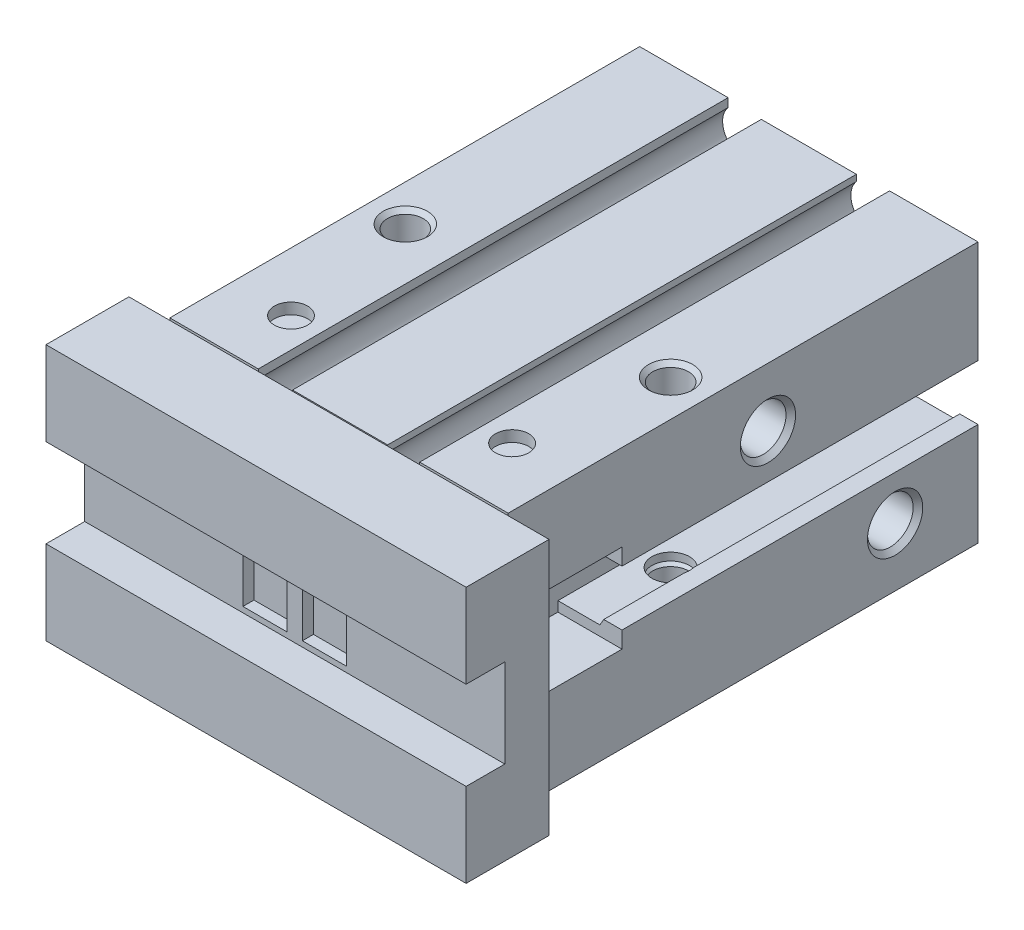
ISO-10303-21;
HEADER;
FILE_DESCRIPTION(('STEP AP214'),'2;1');
FILE_NAME('part.step','',(''),(''),'','','');
FILE_SCHEMA(('AUTOMOTIVE_DESIGN { 1 0 10303 214 1 1 1 1 }'));
ENDSEC;
DATA;
#1=APPLICATION_CONTEXT('core data for automotive mechanical design processes');
#2=APPLICATION_PROTOCOL_DEFINITION('international standard','automotive_design',2000,#1);
#3=PRODUCT_CONTEXT('',#1,'mechanical');
#4=PRODUCT('Part','Part','',(#3));
#5=PRODUCT_RELATED_PRODUCT_CATEGORY('part','',(#4));
#6=PRODUCT_DEFINITION_FORMATION('','',#4);
#7=PRODUCT_DEFINITION_CONTEXT('part definition',#1,'design');
#8=PRODUCT_DEFINITION('design','',#6,#7);
#9=PRODUCT_DEFINITION_SHAPE('','',#8);
#10=(LENGTH_UNIT() NAMED_UNIT(*) SI_UNIT(.MILLI.,.METRE.));
#11=(NAMED_UNIT(*) PLANE_ANGLE_UNIT() SI_UNIT($,.RADIAN.));
#12=(NAMED_UNIT(*) SI_UNIT($,.STERADIAN.) SOLID_ANGLE_UNIT());
#13=UNCERTAINTY_MEASURE_WITH_UNIT(LENGTH_MEASURE(1.E-05),#10,'distance_accuracy_value','');
#14=(GEOMETRIC_REPRESENTATION_CONTEXT(3) GLOBAL_UNCERTAINTY_ASSIGNED_CONTEXT((#13)) GLOBAL_UNIT_ASSIGNED_CONTEXT((#10,
#11,#12)) REPRESENTATION_CONTEXT('',''));
#15=CARTESIAN_POINT('',(0.,0.,0.));
#16=DIRECTION('',(0.,0.,1.));
#17=DIRECTION('',(1.,0.,0.));
#18=AXIS2_PLACEMENT_3D('',#15,#16,#17);
#19=CARTESIAN_POINT('',(10.3,-6.5,7.5));
#20=DIRECTION('',(1.,0.,0.));
#21=DIRECTION('',(0.,0.,-1.));
#22=AXIS2_PLACEMENT_3D('',#19,#20,#21);
#23=PLANE('',#22);
#24=CARTESIAN_POINT('',(10.3,-6.5,7.5));
#25=DIRECTION('',(-1.,0.,0.));
#26=DIRECTION('',(0.,0.,1.));
#27=AXIS2_PLACEMENT_3D('',#24,#25,#26);
#28=CIRCLE('',#27,2.067);
#29=CARTESIAN_POINT('',(10.3,-6.5,9.567));
#30=VERTEX_POINT('',#29);
#31=EDGE_CURVE('E1189',#30,#30,#28,.F.);
#32=ORIENTED_EDGE('',*,*,#31,.T.);
#33=EDGE_LOOP('',(#32));
#34=FACE_BOUND('',#33,.T.);
#35=ADVANCED_FACE('F17',(#34),#23,.T.);
#36=CARTESIAN_POINT('',(12.,-3.8000000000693,24.5));
#37=DIRECTION('',(0.,1.,0.));
#38=DIRECTION('',(-1.,0.,0.));
#39=AXIS2_PLACEMENT_3D('',#36,#37,#38);
#40=CONICAL_SURFACE('',#39,1.99999999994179,0.785398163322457);
#41=CARTESIAN_POINT('',(12.,-4.179,24.5));
#42=DIRECTION('',(0.,-1.,0.));
#43=DIRECTION('',(0.,0.,-1.));
#44=AXIS2_PLACEMENT_3D('',#41,#42,#43);
#45=CIRCLE('',#44,1.621);
#46=CARTESIAN_POINT('',(12.,-4.179,22.879));
#47=VERTEX_POINT('',#46);
#48=EDGE_CURVE('E1186',#47,#47,#45,.T.);
#49=ORIENTED_EDGE('',*,*,#48,.T.);
#50=EDGE_LOOP('',(#49));
#51=FACE_BOUND('',#50,.T.);
#52=CARTESIAN_POINT('',(12.,-3.80000000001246,24.5));
#53=DIRECTION('',(0.,1.,0.));
#54=DIRECTION('',(-1.,0.,0.));
#55=AXIS2_PLACEMENT_3D('',#52,#53,#54);
#56=CIRCLE('',#55,1.99999999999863);
#57=CARTESIAN_POINT('',(10.0000000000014,-3.80000000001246,24.5));
#58=VERTEX_POINT('',#57);
#59=EDGE_CURVE('E1284',#58,#58,#56,.F.);
#60=ORIENTED_EDGE('',*,*,#59,.F.);
#61=EDGE_LOOP('',(#60));
#62=FACE_BOUND('',#61,.T.);
#63=ADVANCED_FACE('F2547',(#51,#62),#40,.F.);
#64=CARTESIAN_POINT('',(10.3,6.5,19.));
#65=DIRECTION('',(1.,0.,0.));
#66=DIRECTION('',(0.,0.,-1.));
#67=AXIS2_PLACEMENT_3D('',#64,#65,#66);
#68=PLANE('',#67);
#69=CARTESIAN_POINT('',(10.3,6.5,19.));
#70=DIRECTION('',(-1.,0.,0.));
#71=DIRECTION('',(0.,0.,1.));
#72=AXIS2_PLACEMENT_3D('',#69,#70,#71);
#73=CIRCLE('',#72,2.067);
#74=CARTESIAN_POINT('',(10.3,6.5,21.067));
#75=VERTEX_POINT('',#74);
#76=EDGE_CURVE('E1185',#75,#75,#73,.F.);
#77=ORIENTED_EDGE('',*,*,#76,.T.);
#78=EDGE_LOOP('',(#77));
#79=FACE_BOUND('',#78,.T.);
#80=ADVANCED_FACE('F2538',(#79),#68,.T.);
#81=CARTESIAN_POINT('',(12.,3.80000000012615,24.5));
#82=DIRECTION('',(0.,-1.,0.));
#83=DIRECTION('',(0.,0.,-1.));
#84=AXIS2_PLACEMENT_3D('',#81,#82,#83);
#85=CONICAL_SURFACE('',#84,1.99999999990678,0.785398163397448);
#86=CARTESIAN_POINT('',(12.,3.80000000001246,24.5));
#87=DIRECTION('',(0.,-1.,0.));
#88=DIRECTION('',(0.,0.,-1.));
#89=AXIS2_PLACEMENT_3D('',#86,#87,#88);
#90=CIRCLE('',#89,2.00000000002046);
#91=CARTESIAN_POINT('',(12.,3.80000000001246,22.4999999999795));
#92=VERTEX_POINT('',#91);
#93=EDGE_CURVE('E1281',#92,#92,#90,.F.);
#94=ORIENTED_EDGE('',*,*,#93,.F.);
#95=EDGE_LOOP('',(#94));
#96=FACE_BOUND('',#95,.T.);
#97=CARTESIAN_POINT('',(12.,4.179,24.5));
#98=DIRECTION('',(0.,-1.,0.));
#99=DIRECTION('',(0.,0.,-1.));
#100=AXIS2_PLACEMENT_3D('',#97,#98,#99);
#101=CIRCLE('',#100,1.621);
#102=CARTESIAN_POINT('',(12.,4.179,22.879));
#103=VERTEX_POINT('',#102);
#104=EDGE_CURVE('E1182',#103,#103,#101,.F.);
#105=ORIENTED_EDGE('',*,*,#104,.T.);
#106=EDGE_LOOP('',(#105));
#107=FACE_BOUND('',#106,.T.);
#108=ADVANCED_FACE('F2529',(#96,#107),#85,.F.);
#109=CARTESIAN_POINT('',(-12.,-3.8000000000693,24.5));
#110=DIRECTION('',(0.,1.,0.));
#111=DIRECTION('',(-1.,0.,0.));
#112=AXIS2_PLACEMENT_3D('',#109,#110,#111);
#113=CONICAL_SURFACE('',#112,1.99999999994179,0.785398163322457);
#114=CARTESIAN_POINT('',(-12.,-4.179,24.5));
#115=DIRECTION('',(0.,-1.,0.));
#116=DIRECTION('',(0.,0.,-1.));
#117=AXIS2_PLACEMENT_3D('',#114,#115,#116);
#118=CIRCLE('',#117,1.621);
#119=CARTESIAN_POINT('',(-12.,-4.179,22.879));
#120=VERTEX_POINT('',#119);
#121=EDGE_CURVE('E1178',#120,#120,#118,.T.);
#122=ORIENTED_EDGE('',*,*,#121,.T.);
#123=EDGE_LOOP('',(#122));
#124=FACE_BOUND('',#123,.T.);
#125=CARTESIAN_POINT('',(-12.,-3.80000000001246,24.5));
#126=DIRECTION('',(0.,1.,0.));
#127=DIRECTION('',(-1.,0.,0.));
#128=AXIS2_PLACEMENT_3D('',#125,#126,#127);
#129=CIRCLE('',#128,1.99999999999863);
#130=CARTESIAN_POINT('',(-13.9999999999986,-3.80000000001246,24.5));
#131=VERTEX_POINT('',#130);
#132=EDGE_CURVE('E1181',#131,#131,#129,.F.);
#133=ORIENTED_EDGE('',*,*,#132,.F.);
#134=EDGE_LOOP('',(#133));
#135=FACE_BOUND('',#134,.T.);
#136=ADVANCED_FACE('F2520',(#124,#135),#113,.F.);
#137=CARTESIAN_POINT('',(0.,0.,45.5));
#138=DIRECTION('',(0.,0.,1.));
#139=DIRECTION('',(1.,0.,0.));
#140=AXIS2_PLACEMENT_3D('',#137,#138,#139);
#141=PLANE('',#140);
#142=DIRECTION('',(0.,1.,0.));
#143=VECTOR('',#142,1.);
#144=CARTESIAN_POINT('',(-0.69,-3.5,45.5));
#145=LINE('',#144,#143);
#146=CARTESIAN_POINT('',(-0.69,-3.5,45.5));
#147=VERTEX_POINT('',#146);
#148=CARTESIAN_POINT('',(-0.69,3.5,45.5));
#149=VERTEX_POINT('',#148);
#150=EDGE_CURVE('E958',#147,#149,#145,.T.);
#151=ORIENTED_EDGE('',*,*,#150,.T.);
#152=DIRECTION('',(1.,0.,0.));
#153=VECTOR('',#152,1.);
#154=CARTESIAN_POINT('',(-0.69,3.5,45.5));
#155=LINE('',#154,#153);
#156=CARTESIAN_POINT('',(-4.69,3.5,45.5));
#157=VERTEX_POINT('',#156);
#158=EDGE_CURVE('E953',#149,#157,#155,.F.);
#159=ORIENTED_EDGE('',*,*,#158,.T.);
#160=DIRECTION('',(0.,1.,0.));
#161=VECTOR('',#160,1.);
#162=CARTESIAN_POINT('',(-4.69,3.5,45.5));
#163=LINE('',#162,#161);
#164=CARTESIAN_POINT('',(-4.69,-3.5,45.5));
#165=VERTEX_POINT('',#164);
#166=EDGE_CURVE('E948',#157,#165,#163,.F.);
#167=ORIENTED_EDGE('',*,*,#166,.T.);
#168=DIRECTION('',(1.,0.,0.));
#169=VECTOR('',#168,1.);
#170=CARTESIAN_POINT('',(-4.69,-3.5,45.5));
#171=LINE('',#170,#169);
#172=EDGE_CURVE('E942',#165,#147,#171,.T.);
#173=ORIENTED_EDGE('',*,*,#172,.T.);
#174=EDGE_LOOP('',(#151,#159,#167,#173));
#175=FACE_BOUND('',#174,.T.);
#176=ADVANCED_FACE('F2511',(#175),#141,.T.);
#177=CARTESIAN_POINT('',(0.,0.,45.5));
#178=DIRECTION('',(0.,0.,1.));
#179=DIRECTION('',(1.,0.,0.));
#180=AXIS2_PLACEMENT_3D('',#177,#178,#179);
#181=PLANE('',#180);
#182=DIRECTION('',(0.,1.,0.));
#183=VECTOR('',#182,1.);
#184=CARTESIAN_POINT('',(4.69,-3.5,45.5));
#185=LINE('',#184,#183);
#186=CARTESIAN_POINT('',(4.69,-3.5,45.5));
#187=VERTEX_POINT('',#186);
#188=CARTESIAN_POINT('',(4.69,3.5,45.5));
#189=VERTEX_POINT('',#188);
#190=EDGE_CURVE('E937',#187,#189,#185,.T.);
#191=ORIENTED_EDGE('',*,*,#190,.T.);
#192=DIRECTION('',(1.,0.,0.));
#193=VECTOR('',#192,1.);
#194=CARTESIAN_POINT('',(4.69,3.5,45.5));
#195=LINE('',#194,#193);
#196=CARTESIAN_POINT('',(0.69,3.5,45.5));
#197=VERTEX_POINT('',#196);
#198=EDGE_CURVE('E932',#189,#197,#195,.F.);
#199=ORIENTED_EDGE('',*,*,#198,.T.);
#200=DIRECTION('',(0.,1.,0.));
#201=VECTOR('',#200,1.);
#202=CARTESIAN_POINT('',(0.69,3.5,45.5));
#203=LINE('',#202,#201);
#204=CARTESIAN_POINT('',(0.69,-3.5,45.5));
#205=VERTEX_POINT('',#204);
#206=EDGE_CURVE('E927',#197,#205,#203,.F.);
#207=ORIENTED_EDGE('',*,*,#206,.T.);
#208=DIRECTION('',(1.,0.,0.));
#209=VECTOR('',#208,1.);
#210=CARTESIAN_POINT('',(0.69,-3.5,45.5));
#211=LINE('',#210,#209);
#212=EDGE_CURVE('E921',#205,#187,#211,.T.);
#213=ORIENTED_EDGE('',*,*,#212,.T.);
#214=EDGE_LOOP('',(#191,#199,#207,#213));
#215=FACE_BOUND('',#214,.T.);
#216=ADVANCED_FACE('F2502',(#215),#181,.T.);
#217=CARTESIAN_POINT('',(-10.8,-8.,30.));
#218=DIRECTION('',(-1.,0.,0.));
#219=DIRECTION('',(0.,0.,1.));
#220=AXIS2_PLACEMENT_3D('',#217,#218,#219);
#221=PLANE('',#220);
#222=CARTESIAN_POINT('',(-10.8,-8.,30.));
#223=DIRECTION('',(1.,0.,0.));
#224=DIRECTION('',(0.,0.,-1.));
#225=AXIS2_PLACEMENT_3D('',#222,#223,#224);
#226=CIRCLE('',#225,1.621);
#227=CARTESIAN_POINT('',(-10.8,-8.,28.379));
#228=VERTEX_POINT('',#227);
#229=EDGE_CURVE('E920',#228,#228,#226,.F.);
#230=ORIENTED_EDGE('',*,*,#229,.T.);
#231=EDGE_LOOP('',(#230));
#232=FACE_BOUND('',#231,.T.);
#233=ADVANCED_FACE('F2493',(#232),#221,.T.);
#234=CARTESIAN_POINT('',(11.,7.5,8.));
#235=DIRECTION('',(0.,0.,-1.));
#236=DIRECTION('',(-1.,0.,0.));
#237=AXIS2_PLACEMENT_3D('',#234,#235,#236);
#238=PLANE('',#237);
#239=CARTESIAN_POINT('',(11.,7.5,8.));
#240=DIRECTION('',(0.,0.,1.));
#241=DIRECTION('',(1.,0.,0.));
#242=AXIS2_PLACEMENT_3D('',#239,#240,#241);
#243=CIRCLE('',#242,1.621);
#244=CARTESIAN_POINT('',(12.621,7.5,8.));
#245=VERTEX_POINT('',#244);
#246=EDGE_CURVE('E1166',#245,#245,#243,.F.);
#247=ORIENTED_EDGE('',*,*,#246,.T.);
#248=EDGE_LOOP('',(#247));
#249=FACE_BOUND('',#248,.T.);
#250=ADVANCED_FACE('F2483',(#249),#238,.T.);
#251=CARTESIAN_POINT('',(12.,11.8,24.5));
#252=DIRECTION('',(0.,-1.,0.));
#253=DIRECTION('',(0.,0.,-1.));
#254=AXIS2_PLACEMENT_3D('',#251,#252,#253);
#255=CYLINDRICAL_SURFACE('',#254,1.621);
#256=ORIENTED_EDGE('',*,*,#48,.F.);
#257=EDGE_LOOP('',(#256));
#258=FACE_BOUND('',#257,.T.);
#259=CARTESIAN_POINT('',(12.,-11.4209999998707,24.5));
#260=DIRECTION('',(0.,-1.,0.));
#261=DIRECTION('',(0.,0.,-1.));
#262=AXIS2_PLACEMENT_3D('',#259,#260,#261);
#263=CIRCLE('',#262,1.62100000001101);
#264=CARTESIAN_POINT('',(12.,-11.4209999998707,22.878999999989));
#265=VERTEX_POINT('',#264);
#266=EDGE_CURVE('E895',#265,#265,#263,.T.);
#267=ORIENTED_EDGE('',*,*,#266,.T.);
#268=EDGE_LOOP('',(#267));
#269=FACE_BOUND('',#268,.T.);
#270=ADVANCED_FACE('F2474',(#258,#269),#255,.F.);
#271=CARTESIAN_POINT('',(15.3,-6.5,7.5));
#272=DIRECTION('',(-1.,0.,0.));
#273=DIRECTION('',(0.,0.,1.));
#274=AXIS2_PLACEMENT_3D('',#271,#272,#273);
#275=CYLINDRICAL_SURFACE('',#274,2.067);
#276=ORIENTED_EDGE('',*,*,#31,.F.);
#277=EDGE_LOOP('',(#276));
#278=FACE_BOUND('',#277,.T.);
#279=CARTESIAN_POINT('',(14.8669999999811,-6.5,7.5));
#280=DIRECTION('',(1.,0.,0.));
#281=DIRECTION('',(0.,0.,-1.));
#282=AXIS2_PLACEMENT_3D('',#279,#280,#281);
#283=CIRCLE('',#282,2.0669999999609);
#284=CARTESIAN_POINT('',(14.8669999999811,-6.5,5.4330000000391));
#285=VERTEX_POINT('',#284);
#286=EDGE_CURVE('E1134',#285,#285,#283,.T.);
#287=ORIENTED_EDGE('',*,*,#286,.T.);
#288=EDGE_LOOP('',(#287));
#289=FACE_BOUND('',#288,.T.);
#290=ADVANCED_FACE('F2465',(#278,#289),#275,.F.);
#291=CARTESIAN_POINT('',(10.,-3.8,24.5));
#292=DIRECTION('',(0.,-1.,0.));
#293=DIRECTION('',(0.,0.,-1.));
#294=AXIS2_PLACEMENT_3D('',#291,#292,#293);
#295=PLANE('',#294);
#296=CARTESIAN_POINT('',(12.,-3.8,24.5));
#297=DIRECTION('',(0.,-1.,0.));
#298=DIRECTION('',(0.,0.,-1.));
#299=AXIS2_PLACEMENT_3D('',#296,#297,#298);
#300=CIRCLE('',#299,1.7);
#301=CARTESIAN_POINT('',(12.,-3.8,22.8));
#302=VERTEX_POINT('',#301);
#303=EDGE_CURVE('E805',#302,#302,#300,.F.);
#304=ORIENTED_EDGE('',*,*,#303,.T.);
#305=EDGE_LOOP('',(#304));
#306=FACE_BOUND('',#305,.T.);
#307=ORIENTED_EDGE('',*,*,#59,.T.);
#308=EDGE_LOOP('',(#307));
#309=FACE_BOUND('',#308,.T.);
#310=ADVANCED_FACE('F2456',(#306,#309),#295,.T.);
#311=CARTESIAN_POINT('',(10.3,3.8,24.5));
#312=DIRECTION('',(0.,1.,0.));
#313=DIRECTION('',(0.,0.,1.));
#314=AXIS2_PLACEMENT_3D('',#311,#312,#313);
#315=PLANE('',#314);
#316=ORIENTED_EDGE('',*,*,#93,.T.);
#317=EDGE_LOOP('',(#316));
#318=FACE_BOUND('',#317,.T.);
#319=CARTESIAN_POINT('',(12.,3.8,24.5));
#320=DIRECTION('',(0.,-1.,0.));
#321=DIRECTION('',(0.,0.,-1.));
#322=AXIS2_PLACEMENT_3D('',#319,#320,#321);
#323=CIRCLE('',#322,1.7);
#324=CARTESIAN_POINT('',(12.,3.8,22.8));
#325=VERTEX_POINT('',#324);
#326=EDGE_CURVE('E767',#325,#325,#323,.T.);
#327=ORIENTED_EDGE('',*,*,#326,.T.);
#328=EDGE_LOOP('',(#327));
#329=FACE_BOUND('',#328,.T.);
#330=ADVANCED_FACE('F2446',(#318,#329),#315,.T.);
#331=CARTESIAN_POINT('',(15.3,6.5,19.));
#332=DIRECTION('',(-1.,0.,0.));
#333=DIRECTION('',(0.,0.,1.));
#334=AXIS2_PLACEMENT_3D('',#331,#332,#333);
#335=CYLINDRICAL_SURFACE('',#334,2.067);
#336=ORIENTED_EDGE('',*,*,#76,.F.);
#337=EDGE_LOOP('',(#336));
#338=FACE_BOUND('',#337,.T.);
#339=CARTESIAN_POINT('',(14.8670000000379,6.5,19.));
#340=DIRECTION('',(1.,0.,0.));
#341=DIRECTION('',(0.,0.,-1.));
#342=AXIS2_PLACEMENT_3D('',#339,#340,#341);
#343=CIRCLE('',#342,2.06700000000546);
#344=CARTESIAN_POINT('',(14.8670000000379,6.5,16.9329999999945));
#345=VERTEX_POINT('',#344);
#346=EDGE_CURVE('E797',#345,#345,#343,.T.);
#347=ORIENTED_EDGE('',*,*,#346,.T.);
#348=EDGE_LOOP('',(#347));
#349=FACE_BOUND('',#348,.T.);
#350=ADVANCED_FACE('F2437',(#338,#349),#335,.F.);
#351=CARTESIAN_POINT('',(10.,10.8,36.84));
#352=DIRECTION('',(0.,1.,0.));
#353=DIRECTION('',(0.,0.,1.));
#354=AXIS2_PLACEMENT_3D('',#351,#352,#353);
#355=PLANE('',#354);
#356=CARTESIAN_POINT('',(10.,10.8,36.84));
#357=DIRECTION('',(0.,1.,0.));
#358=DIRECTION('',(0.,0.,1.));
#359=AXIS2_PLACEMENT_3D('',#356,#357,#358);
#360=CIRCLE('',#359,1.5);
#361=CARTESIAN_POINT('',(10.,10.8,38.34));
#362=VERTEX_POINT('',#361);
#363=EDGE_CURVE('E1092',#362,#362,#360,.T.);
#364=ORIENTED_EDGE('',*,*,#363,.T.);
#365=EDGE_LOOP('',(#364));
#366=FACE_BOUND('',#365,.T.);
#367=ADVANCED_FACE('F2427',(#366),#355,.T.);
#368=CARTESIAN_POINT('',(12.,11.8,24.5));
#369=DIRECTION('',(0.,-1.,0.));
#370=DIRECTION('',(0.,0.,-1.));
#371=AXIS2_PLACEMENT_3D('',#368,#369,#370);
#372=CYLINDRICAL_SURFACE('',#371,1.621);
#373=ORIENTED_EDGE('',*,*,#104,.F.);
#374=EDGE_LOOP('',(#373));
#375=FACE_BOUND('',#374,.T.);
#376=CARTESIAN_POINT('',(12.,11.4210000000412,24.5));
#377=DIRECTION('',(0.,1.,0.));
#378=DIRECTION('',(0.,0.,1.));
#379=AXIS2_PLACEMENT_3D('',#376,#377,#378);
#380=CIRCLE('',#379,1.62099999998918);
#381=CARTESIAN_POINT('',(12.,11.4210000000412,26.1209999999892));
#382=VERTEX_POINT('',#381);
#383=EDGE_CURVE('E975',#382,#382,#380,.T.);
#384=ORIENTED_EDGE('',*,*,#383,.T.);
#385=EDGE_LOOP('',(#384));
#386=FACE_BOUND('',#385,.T.);
#387=ADVANCED_FACE('F2418',(#375,#386),#372,.F.);
#388=CARTESIAN_POINT('',(-13.7,3.8,24.5));
#389=DIRECTION('',(0.,1.,0.));
#390=DIRECTION('',(0.,0.,1.));
#391=AXIS2_PLACEMENT_3D('',#388,#389,#390);
#392=PLANE('',#391);
#393=CARTESIAN_POINT('',(-12.,3.80000000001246,24.5));
#394=DIRECTION('',(0.,-1.,0.));
#395=DIRECTION('',(0.,0.,-1.));
#396=AXIS2_PLACEMENT_3D('',#393,#394,#395);
#397=CIRCLE('',#396,2.00000000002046);
#398=CARTESIAN_POINT('',(-12.,3.80000000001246,22.4999999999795));
#399=VERTEX_POINT('',#398);
#400=EDGE_CURVE('E960',#399,#399,#397,.F.);
#401=ORIENTED_EDGE('',*,*,#400,.T.);
#402=EDGE_LOOP('',(#401));
#403=FACE_BOUND('',#402,.T.);
#404=CARTESIAN_POINT('',(-12.,3.8,24.5));
#405=DIRECTION('',(0.,-1.,0.));
#406=DIRECTION('',(0.,0.,-1.));
#407=AXIS2_PLACEMENT_3D('',#404,#405,#406);
#408=CIRCLE('',#407,1.7);
#409=CARTESIAN_POINT('',(-12.,3.8,22.8));
#410=VERTEX_POINT('',#409);
#411=EDGE_CURVE('E728',#410,#410,#408,.T.);
#412=ORIENTED_EDGE('',*,*,#411,.T.);
#413=EDGE_LOOP('',(#412));
#414=FACE_BOUND('',#413,.T.);
#415=ADVANCED_FACE('F2409',(#403,#414),#392,.T.);
#416=CARTESIAN_POINT('',(-14.,-3.8,24.5));
#417=DIRECTION('',(0.,-1.,0.));
#418=DIRECTION('',(0.,0.,-1.));
#419=AXIS2_PLACEMENT_3D('',#416,#417,#418);
#420=PLANE('',#419);
#421=CARTESIAN_POINT('',(-12.,-3.8,24.5));
#422=DIRECTION('',(0.,-1.,0.));
#423=DIRECTION('',(0.,0.,-1.));
#424=AXIS2_PLACEMENT_3D('',#421,#422,#423);
#425=CIRCLE('',#424,1.7);
#426=CARTESIAN_POINT('',(-12.,-3.8,22.8));
#427=VERTEX_POINT('',#426);
#428=EDGE_CURVE('E727',#427,#427,#425,.F.);
#429=ORIENTED_EDGE('',*,*,#428,.T.);
#430=EDGE_LOOP('',(#429));
#431=FACE_BOUND('',#430,.T.);
#432=ORIENTED_EDGE('',*,*,#132,.T.);
#433=EDGE_LOOP('',(#432));
#434=FACE_BOUND('',#433,.T.);
#435=ADVANCED_FACE('F2399',(#431,#434),#420,.T.);
#436=CARTESIAN_POINT('',(-12.,11.8,24.5));
#437=DIRECTION('',(0.,-1.,0.));
#438=DIRECTION('',(0.,0.,-1.));
#439=AXIS2_PLACEMENT_3D('',#436,#437,#438);
#440=CYLINDRICAL_SURFACE('',#439,1.621);
#441=ORIENTED_EDGE('',*,*,#121,.F.);
#442=EDGE_LOOP('',(#441));
#443=FACE_BOUND('',#442,.T.);
#444=CARTESIAN_POINT('',(-12.,-11.4209999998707,24.5));
#445=DIRECTION('',(0.,-1.,0.));
#446=DIRECTION('',(0.,0.,-1.));
#447=AXIS2_PLACEMENT_3D('',#444,#445,#446);
#448=CIRCLE('',#447,1.62100000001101);
#449=CARTESIAN_POINT('',(-12.,-11.4209999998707,22.878999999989));
#450=VERTEX_POINT('',#449);
#451=EDGE_CURVE('E870',#450,#450,#448,.T.);
#452=ORIENTED_EDGE('',*,*,#451,.T.);
#453=EDGE_LOOP('',(#452));
#454=FACE_BOUND('',#453,.T.);
#455=ADVANCED_FACE('F2390',(#443,#454),#440,.F.);
#456=CARTESIAN_POINT('',(-11.,-7.5,8.));
#457=DIRECTION('',(0.,0.,-1.));
#458=DIRECTION('',(-1.,0.,0.));
#459=AXIS2_PLACEMENT_3D('',#456,#457,#458);
#460=PLANE('',#459);
#461=CARTESIAN_POINT('',(-11.,-7.5,8.));
#462=DIRECTION('',(0.,0.,1.));
#463=DIRECTION('',(1.,0.,0.));
#464=AXIS2_PLACEMENT_3D('',#461,#462,#463);
#465=CIRCLE('',#464,1.621);
#466=CARTESIAN_POINT('',(-9.379,-7.5,8.));
#467=VERTEX_POINT('',#466);
#468=EDGE_CURVE('E999',#467,#467,#465,.F.);
#469=ORIENTED_EDGE('',*,*,#468,.T.);
#470=EDGE_LOOP('',(#469));
#471=FACE_BOUND('',#470,.T.);
#472=ADVANCED_FACE('F2381',(#471),#460,.T.);
#473=CARTESIAN_POINT('',(-12.,3.80000000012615,24.5));
#474=DIRECTION('',(0.,-1.,0.));
#475=DIRECTION('',(0.,0.,-1.));
#476=AXIS2_PLACEMENT_3D('',#473,#474,#475);
#477=CONICAL_SURFACE('',#476,1.99999999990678,0.785398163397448);
#478=ORIENTED_EDGE('',*,*,#400,.F.);
#479=EDGE_LOOP('',(#478));
#480=FACE_BOUND('',#479,.T.);
#481=CARTESIAN_POINT('',(-12.,4.179,24.5));
#482=DIRECTION('',(0.,-1.,0.));
#483=DIRECTION('',(0.,0.,-1.));
#484=AXIS2_PLACEMENT_3D('',#481,#482,#483);
#485=CIRCLE('',#484,1.621);
#486=CARTESIAN_POINT('',(-12.,4.179,22.879));
#487=VERTEX_POINT('',#486);
#488=EDGE_CURVE('E685',#487,#487,#485,.F.);
#489=ORIENTED_EDGE('',*,*,#488,.T.);
#490=EDGE_LOOP('',(#489));
#491=FACE_BOUND('',#490,.T.);
#492=ADVANCED_FACE('F2372',(#480,#491),#477,.F.);
#493=CARTESIAN_POINT('',(-5.8,11.5,42.4));
#494=DIRECTION('',(0.,-1.,0.));
#495=DIRECTION('',(0.,0.,-1.));
#496=AXIS2_PLACEMENT_3D('',#493,#494,#495);
#497=PLANE('',#496);
#498=DIRECTION('',(1.,0.,0.));
#499=VECTOR('',#498,1.);
#500=CARTESIAN_POINT('',(0.,11.5,42.4));
#501=LINE('',#500,#499);
#502=CARTESIAN_POINT('',(-4.3,11.5,42.4));
#503=VERTEX_POINT('',#502);
#504=CARTESIAN_POINT('',(4.3,11.5,42.4));
#505=VERTEX_POINT('',#504);
#506=EDGE_CURVE('E982',#503,#505,#501,.T.);
#507=ORIENTED_EDGE('',*,*,#506,.F.);
#508=DIRECTION('',(0.,0.,1.));
#509=VECTOR('',#508,1.);
#510=CARTESIAN_POINT('',(-4.3,11.5,42.5));
#511=LINE('',#510,#509);
#512=CARTESIAN_POINT('',(-4.3,11.5,42.5));
#513=VERTEX_POINT('',#512);
#514=EDGE_CURVE('E974',#513,#503,#511,.F.);
#515=ORIENTED_EDGE('',*,*,#514,.F.);
#516=DIRECTION('',(1.,0.,0.));
#517=VECTOR('',#516,1.);
#518=CARTESIAN_POINT('',(19.,11.5,42.5));
#519=LINE('',#518,#517);
#520=CARTESIAN_POINT('',(4.3,11.5,42.5));
#521=VERTEX_POINT('',#520);
#522=EDGE_CURVE('E679',#513,#521,#519,.T.);
#523=ORIENTED_EDGE('',*,*,#522,.T.);
#524=DIRECTION('',(0.,0.,-1.));
#525=VECTOR('',#524,1.);
#526=CARTESIAN_POINT('',(4.3,11.5,42.5));
#527=LINE('',#526,#525);
#528=EDGE_CURVE('E980',#505,#521,#527,.F.);
#529=ORIENTED_EDGE('',*,*,#528,.F.);
#530=EDGE_LOOP('',(#507,#515,#523,#529));
#531=FACE_BOUND('',#530,.T.);
#532=ADVANCED_FACE('F2363',(#531),#497,.F.);
#533=CARTESIAN_POINT('',(-0.69,-3.5,45.5));
#534=DIRECTION('',(1.,0.,0.));
#535=DIRECTION('',(0.,0.,-1.));
#536=AXIS2_PLACEMENT_3D('',#533,#534,#535);
#537=PLANE('',#536);
#538=DIRECTION('',(0.,0.,1.));
#539=VECTOR('',#538,1.);
#540=CARTESIAN_POINT('',(-0.69,3.5,45.5));
#541=LINE('',#540,#539);
#542=CARTESIAN_POINT('',(-0.69,3.5,46.5));
#543=VERTEX_POINT('',#542);
#544=EDGE_CURVE('E955',#543,#149,#541,.F.);
#545=ORIENTED_EDGE('',*,*,#544,.T.);
#546=ORIENTED_EDGE('',*,*,#150,.F.);
#547=DIRECTION('',(0.,0.,-1.));
#548=VECTOR('',#547,1.);
#549=CARTESIAN_POINT('',(-0.69,-3.5,45.5));
#550=LINE('',#549,#548);
#551=CARTESIAN_POINT('',(-0.69,-3.5,46.5));
#552=VERTEX_POINT('',#551);
#553=EDGE_CURVE('E939',#147,#552,#550,.F.);
#554=ORIENTED_EDGE('',*,*,#553,.T.);
#555=DIRECTION('',(0.,1.,0.));
#556=VECTOR('',#555,1.);
#557=CARTESIAN_POINT('',(-0.69,4.,46.5));
#558=LINE('',#557,#556);
#559=EDGE_CURVE('E664',#552,#543,#558,.T.);
#560=ORIENTED_EDGE('',*,*,#559,.T.);
#561=EDGE_LOOP('',(#545,#546,#554,#560));
#562=FACE_BOUND('',#561,.T.);
#563=ADVANCED_FACE('F2354',(#562),#537,.F.);
#564=CARTESIAN_POINT('',(-0.69,3.5,45.5));
#565=DIRECTION('',(0.,1.,0.));
#566=DIRECTION('',(0.,0.,1.));
#567=AXIS2_PLACEMENT_3D('',#564,#565,#566);
#568=PLANE('',#567);
#569=DIRECTION('',(0.,0.,1.));
#570=VECTOR('',#569,1.);
#571=CARTESIAN_POINT('',(-4.69,3.5,45.5));
#572=LINE('',#571,#570);
#573=CARTESIAN_POINT('',(-4.69,3.5,46.5));
#574=VERTEX_POINT('',#573);
#575=EDGE_CURVE('E950',#574,#157,#572,.F.);
#576=ORIENTED_EDGE('',*,*,#575,.T.);
#577=ORIENTED_EDGE('',*,*,#158,.F.);
#578=ORIENTED_EDGE('',*,*,#544,.F.);
#579=DIRECTION('',(-1.,0.,0.));
#580=VECTOR('',#579,1.);
#581=CARTESIAN_POINT('',(19.,3.5,46.5));
#582=LINE('',#581,#580);
#583=EDGE_CURVE('E661',#543,#574,#582,.T.);
#584=ORIENTED_EDGE('',*,*,#583,.T.);
#585=EDGE_LOOP('',(#576,#577,#578,#584));
#586=FACE_BOUND('',#585,.T.);
#587=ADVANCED_FACE('F2345',(#586),#568,.F.);
#588=CARTESIAN_POINT('',(-4.69,3.5,45.5));
#589=DIRECTION('',(-1.,0.,0.));
#590=DIRECTION('',(0.,0.,1.));
#591=AXIS2_PLACEMENT_3D('',#588,#589,#590);
#592=PLANE('',#591);
#593=DIRECTION('',(0.,0.,-1.));
#594=VECTOR('',#593,1.);
#595=CARTESIAN_POINT('',(-4.69,-3.5,45.5));
#596=LINE('',#595,#594);
#597=CARTESIAN_POINT('',(-4.69,-3.5,46.5));
#598=VERTEX_POINT('',#597);
#599=EDGE_CURVE('E945',#598,#165,#596,.T.);
#600=ORIENTED_EDGE('',*,*,#599,.T.);
#601=ORIENTED_EDGE('',*,*,#166,.F.);
#602=ORIENTED_EDGE('',*,*,#575,.F.);
#603=DIRECTION('',(0.,1.,0.));
#604=VECTOR('',#603,1.);
#605=CARTESIAN_POINT('',(-4.69,4.,46.5));
#606=LINE('',#605,#604);
#607=EDGE_CURVE('E658',#574,#598,#606,.F.);
#608=ORIENTED_EDGE('',*,*,#607,.T.);
#609=EDGE_LOOP('',(#600,#601,#602,#608));
#610=FACE_BOUND('',#609,.T.);
#611=ADVANCED_FACE('F2336',(#610),#592,.F.);
#612=CARTESIAN_POINT('',(-4.69,-3.5,45.5));
#613=DIRECTION('',(0.,-1.,0.));
#614=DIRECTION('',(0.,0.,-1.));
#615=AXIS2_PLACEMENT_3D('',#612,#613,#614);
#616=PLANE('',#615);
#617=ORIENTED_EDGE('',*,*,#553,.F.);
#618=ORIENTED_EDGE('',*,*,#172,.F.);
#619=ORIENTED_EDGE('',*,*,#599,.F.);
#620=DIRECTION('',(-1.,0.,0.));
#621=VECTOR('',#620,1.);
#622=CARTESIAN_POINT('',(19.,-3.5,46.5));
#623=LINE('',#622,#621);
#624=EDGE_CURVE('E655',#598,#552,#623,.F.);
#625=ORIENTED_EDGE('',*,*,#624,.T.);
#626=EDGE_LOOP('',(#617,#618,#619,#625));
#627=FACE_BOUND('',#626,.T.);
#628=ADVANCED_FACE('F2327',(#627),#616,.F.);
#629=CARTESIAN_POINT('',(4.69,-3.5,45.5));
#630=DIRECTION('',(1.,0.,0.));
#631=DIRECTION('',(0.,0.,-1.));
#632=AXIS2_PLACEMENT_3D('',#629,#630,#631);
#633=PLANE('',#632);
#634=DIRECTION('',(0.,0.,1.));
#635=VECTOR('',#634,1.);
#636=CARTESIAN_POINT('',(4.69,3.5,45.5));
#637=LINE('',#636,#635);
#638=CARTESIAN_POINT('',(4.69,3.5,46.5));
#639=VERTEX_POINT('',#638);
#640=EDGE_CURVE('E934',#639,#189,#637,.F.);
#641=ORIENTED_EDGE('',*,*,#640,.T.);
#642=ORIENTED_EDGE('',*,*,#190,.F.);
#643=DIRECTION('',(0.,0.,-1.));
#644=VECTOR('',#643,1.);
#645=CARTESIAN_POINT('',(4.69,-3.5,45.5));
#646=LINE('',#645,#644);
#647=CARTESIAN_POINT('',(4.69,-3.5,46.5));
#648=VERTEX_POINT('',#647);
#649=EDGE_CURVE('E917',#187,#648,#646,.F.);
#650=ORIENTED_EDGE('',*,*,#649,.T.);
#651=DIRECTION('',(0.,1.,0.));
#652=VECTOR('',#651,1.);
#653=CARTESIAN_POINT('',(4.69,4.,46.5));
#654=LINE('',#653,#652);
#655=EDGE_CURVE('E652',#648,#639,#654,.T.);
#656=ORIENTED_EDGE('',*,*,#655,.T.);
#657=EDGE_LOOP('',(#641,#642,#650,#656));
#658=FACE_BOUND('',#657,.T.);
#659=ADVANCED_FACE('F2318',(#658),#633,.F.);
#660=CARTESIAN_POINT('',(4.69,3.5,45.5));
#661=DIRECTION('',(0.,1.,0.));
#662=DIRECTION('',(0.,0.,1.));
#663=AXIS2_PLACEMENT_3D('',#660,#661,#662);
#664=PLANE('',#663);
#665=DIRECTION('',(0.,0.,1.));
#666=VECTOR('',#665,1.);
#667=CARTESIAN_POINT('',(0.69,3.5,45.5));
#668=LINE('',#667,#666);
#669=CARTESIAN_POINT('',(0.69,3.5,46.5));
#670=VERTEX_POINT('',#669);
#671=EDGE_CURVE('E929',#670,#197,#668,.F.);
#672=ORIENTED_EDGE('',*,*,#671,.T.);
#673=ORIENTED_EDGE('',*,*,#198,.F.);
#674=ORIENTED_EDGE('',*,*,#640,.F.);
#675=DIRECTION('',(-1.,0.,0.));
#676=VECTOR('',#675,1.);
#677=CARTESIAN_POINT('',(19.,3.5,46.5));
#678=LINE('',#677,#676);
#679=EDGE_CURVE('E649',#639,#670,#678,.T.);
#680=ORIENTED_EDGE('',*,*,#679,.T.);
#681=EDGE_LOOP('',(#672,#673,#674,#680));
#682=FACE_BOUND('',#681,.T.);
#683=ADVANCED_FACE('F2309',(#682),#664,.F.);
#684=CARTESIAN_POINT('',(0.69,3.5,45.5));
#685=DIRECTION('',(-1.,0.,0.));
#686=DIRECTION('',(0.,0.,1.));
#687=AXIS2_PLACEMENT_3D('',#684,#685,#686);
#688=PLANE('',#687);
#689=DIRECTION('',(0.,0.,-1.));
#690=VECTOR('',#689,1.);
#691=CARTESIAN_POINT('',(0.69,-3.5,45.5));
#692=LINE('',#691,#690);
#693=CARTESIAN_POINT('',(0.69,-3.5,46.5));
#694=VERTEX_POINT('',#693);
#695=EDGE_CURVE('E924',#694,#205,#692,.T.);
#696=ORIENTED_EDGE('',*,*,#695,.T.);
#697=ORIENTED_EDGE('',*,*,#206,.F.);
#698=ORIENTED_EDGE('',*,*,#671,.F.);
#699=DIRECTION('',(0.,1.,0.));
#700=VECTOR('',#699,1.);
#701=CARTESIAN_POINT('',(0.69,4.,46.5));
#702=LINE('',#701,#700);
#703=EDGE_CURVE('E646',#670,#694,#702,.F.);
#704=ORIENTED_EDGE('',*,*,#703,.T.);
#705=EDGE_LOOP('',(#696,#697,#698,#704));
#706=FACE_BOUND('',#705,.T.);
#707=ADVANCED_FACE('F2300',(#706),#688,.F.);
#708=CARTESIAN_POINT('',(0.69,-3.5,45.5));
#709=DIRECTION('',(0.,-1.,0.));
#710=DIRECTION('',(0.,0.,-1.));
#711=AXIS2_PLACEMENT_3D('',#708,#709,#710);
#712=PLANE('',#711);
#713=ORIENTED_EDGE('',*,*,#649,.F.);
#714=ORIENTED_EDGE('',*,*,#212,.F.);
#715=ORIENTED_EDGE('',*,*,#695,.F.);
#716=DIRECTION('',(-1.,0.,0.));
#717=VECTOR('',#716,1.);
#718=CARTESIAN_POINT('',(19.,-3.5,46.5));
#719=LINE('',#718,#717);
#720=EDGE_CURVE('E643',#694,#648,#719,.F.);
#721=ORIENTED_EDGE('',*,*,#720,.T.);
#722=EDGE_LOOP('',(#713,#714,#715,#721));
#723=FACE_BOUND('',#722,.T.);
#724=ADVANCED_FACE('F2291',(#723),#712,.F.);
#725=CARTESIAN_POINT('',(5.8,-11.5,42.4));
#726=DIRECTION('',(0.,1.,0.));
#727=DIRECTION('',(0.,0.,1.));
#728=AXIS2_PLACEMENT_3D('',#725,#726,#727);
#729=PLANE('',#728);
#730=DIRECTION('',(1.,0.,0.));
#731=VECTOR('',#730,1.);
#732=CARTESIAN_POINT('',(19.,-11.5,42.5));
#733=LINE('',#732,#731);
#734=CARTESIAN_POINT('',(4.3,-11.5,42.5));
#735=VERTEX_POINT('',#734);
#736=CARTESIAN_POINT('',(-4.3,-11.5,42.5));
#737=VERTEX_POINT('',#736);
#738=EDGE_CURVE('E621',#735,#737,#733,.F.);
#739=ORIENTED_EDGE('',*,*,#738,.T.);
#740=DIRECTION('',(0.,0.,1.));
#741=VECTOR('',#740,1.);
#742=CARTESIAN_POINT('',(-4.3,-11.5,42.5));
#743=LINE('',#742,#741);
#744=CARTESIAN_POINT('',(-4.3,-11.5,42.4));
#745=VERTEX_POINT('',#744);
#746=EDGE_CURVE('E875',#745,#737,#743,.T.);
#747=ORIENTED_EDGE('',*,*,#746,.F.);
#748=DIRECTION('',(1.,0.,0.));
#749=VECTOR('',#748,1.);
#750=CARTESIAN_POINT('',(0.,-11.5,42.4));
#751=LINE('',#750,#749);
#752=CARTESIAN_POINT('',(4.3,-11.5,42.4));
#753=VERTEX_POINT('',#752);
#754=EDGE_CURVE('E887',#753,#745,#751,.F.);
#755=ORIENTED_EDGE('',*,*,#754,.F.);
#756=DIRECTION('',(0.,0.,-1.));
#757=VECTOR('',#756,1.);
#758=CARTESIAN_POINT('',(4.3,-11.5,42.5));
#759=LINE('',#758,#757);
#760=EDGE_CURVE('E869',#735,#753,#759,.T.);
#761=ORIENTED_EDGE('',*,*,#760,.F.);
#762=EDGE_LOOP('',(#739,#747,#755,#761));
#763=FACE_BOUND('',#762,.T.);
#764=ADVANCED_FACE('F2281',(#763),#729,.F.);
#765=CARTESIAN_POINT('',(-15.3,-8.,30.));
#766=DIRECTION('',(1.,0.,0.));
#767=DIRECTION('',(0.,0.,-1.));
#768=AXIS2_PLACEMENT_3D('',#765,#766,#767);
#769=CYLINDRICAL_SURFACE('',#768,1.621);
#770=ORIENTED_EDGE('',*,*,#229,.F.);
#771=EDGE_LOOP('',(#770));
#772=FACE_BOUND('',#771,.T.);
#773=CARTESIAN_POINT('',(-14.9210000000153,-8.,30.));
#774=DIRECTION('',(-1.,0.,0.));
#775=DIRECTION('',(0.,0.,1.));
#776=AXIS2_PLACEMENT_3D('',#773,#774,#775);
#777=CIRCLE('',#776,1.62099999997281);
#778=CARTESIAN_POINT('',(-14.9210000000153,-8.,31.6209999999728));
#779=VERTEX_POINT('',#778);
#780=EDGE_CURVE('E588',#779,#779,#777,.T.);
#781=ORIENTED_EDGE('',*,*,#780,.T.);
#782=EDGE_LOOP('',(#781));
#783=FACE_BOUND('',#782,.T.);
#784=ADVANCED_FACE('F2272',(#772,#783),#769,.F.);
#785=CARTESIAN_POINT('',(-10.8,7.99999999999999,30.));
#786=DIRECTION('',(-1.,0.,0.));
#787=DIRECTION('',(0.,0.,1.));
#788=AXIS2_PLACEMENT_3D('',#785,#786,#787);
#789=PLANE('',#788);
#790=CARTESIAN_POINT('',(-10.8,7.99999999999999,30.));
#791=DIRECTION('',(1.,0.,0.));
#792=DIRECTION('',(0.,0.,-1.));
#793=AXIS2_PLACEMENT_3D('',#790,#791,#792);
#794=CIRCLE('',#793,1.621);
#795=CARTESIAN_POINT('',(-10.8,7.99999999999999,28.379));
#796=VERTEX_POINT('',#795);
#797=EDGE_CURVE('E546',#796,#796,#794,.F.);
#798=ORIENTED_EDGE('',*,*,#797,.T.);
#799=EDGE_LOOP('',(#798));
#800=FACE_BOUND('',#799,.T.);
#801=ADVANCED_FACE('F2263',(#800),#789,.T.);
#802=CARTESIAN_POINT('',(-11.,6.5,3.));
#803=DIRECTION('',(0.,0.,1.));
#804=DIRECTION('',(1.,0.,0.));
#805=AXIS2_PLACEMENT_3D('',#802,#803,#804);
#806=PLANE('',#805);
#807=CARTESIAN_POINT('',(-11.,6.5,3.));
#808=DIRECTION('',(0.,0.,-1.));
#809=DIRECTION('',(-1.,0.,0.));
#810=AXIS2_PLACEMENT_3D('',#807,#808,#809);
#811=CIRCLE('',#810,1.5);
#812=CARTESIAN_POINT('',(-12.5,6.5,3.));
#813=VERTEX_POINT('',#812);
#814=EDGE_CURVE('E545',#813,#813,#811,.T.);
#815=ORIENTED_EDGE('',*,*,#814,.T.);
#816=EDGE_LOOP('',(#815));
#817=FACE_BOUND('',#816,.T.);
#818=ADVANCED_FACE('F2253',(#817),#806,.F.);
#819=CARTESIAN_POINT('',(11.,7.5,0.));
#820=DIRECTION('',(0.,0.,1.));
#821=DIRECTION('',(1.,0.,0.));
#822=AXIS2_PLACEMENT_3D('',#819,#820,#821);
#823=CYLINDRICAL_SURFACE('',#822,1.621);
#824=ORIENTED_EDGE('',*,*,#246,.F.);
#825=EDGE_LOOP('',(#824));
#826=FACE_BOUND('',#825,.T.);
#827=CARTESIAN_POINT('',(11.,7.5,0.379000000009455));
#828=DIRECTION('',(0.,0.,-1.));
#829=DIRECTION('',(-1.,0.,0.));
#830=AXIS2_PLACEMENT_3D('',#827,#828,#829);
#831=CIRCLE('',#830,1.62099999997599);
#832=CARTESIAN_POINT('',(9.37900000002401,7.5,0.379000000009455));
#833=VERTEX_POINT('',#832);
#834=EDGE_CURVE('E840',#833,#833,#831,.T.);
#835=ORIENTED_EDGE('',*,*,#834,.T.);
#836=EDGE_LOOP('',(#835));
#837=FACE_BOUND('',#836,.T.);
#838=ADVANCED_FACE('F2244',(#826,#837),#823,.F.);
#839=CARTESIAN_POINT('',(7.3,-11.8,42.5));
#840=DIRECTION('',(-1.,0.,0.));
#841=DIRECTION('',(0.,0.,1.));
#842=AXIS2_PLACEMENT_3D('',#839,#840,#841);
#843=PLANE('',#842);
#844=DIRECTION('',(0.,1.,0.));
#845=VECTOR('',#844,1.);
#846=CARTESIAN_POINT('',(7.3,-11.6,42.5));
#847=LINE('',#846,#845);
#848=CARTESIAN_POINT('',(7.3,-11.6,42.5));
#849=VERTEX_POINT('',#848);
#850=CARTESIAN_POINT('',(7.3,-11.0228756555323,42.5));
#851=VERTEX_POINT('',#850);
#852=EDGE_CURVE('E627',#849,#851,#847,.T.);
#853=ORIENTED_EDGE('',*,*,#852,.T.);
#854=DIRECTION('',(0.,0.,1.));
#855=VECTOR('',#854,1.);
#856=CARTESIAN_POINT('',(7.3,-11.0228756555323,42.5));
#857=LINE('',#856,#855);
#858=CARTESIAN_POINT('',(7.3,-11.0228756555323,0.));
#859=VERTEX_POINT('',#858);
#860=EDGE_CURVE('E892',#851,#859,#857,.F.);
#861=ORIENTED_EDGE('',*,*,#860,.T.);
#862=DIRECTION('',(0.,1.,0.));
#863=VECTOR('',#862,1.);
#864=CARTESIAN_POINT('',(7.3,-11.8,0.));
#865=LINE('',#864,#863);
#866=CARTESIAN_POINT('',(7.3,-11.8,0.));
#867=VERTEX_POINT('',#866);
#868=EDGE_CURVE('E896',#859,#867,#865,.F.);
#869=ORIENTED_EDGE('',*,*,#868,.T.);
#870=DIRECTION('',(0.,0.,1.));
#871=VECTOR('',#870,1.);
#872=CARTESIAN_POINT('',(7.3,-11.8,42.5));
#873=LINE('',#872,#871);
#874=CARTESIAN_POINT('',(7.3,-11.8,42.5));
#875=VERTEX_POINT('',#874);
#876=EDGE_CURVE('E541',#867,#875,#873,.T.);
#877=ORIENTED_EDGE('',*,*,#876,.T.);
#878=DIRECTION('',(0.,1.,0.));
#879=VECTOR('',#878,1.);
#880=CARTESIAN_POINT('',(7.3,0.,42.5));
#881=LINE('',#880,#879);
#882=EDGE_CURVE('E612',#849,#875,#881,.F.);
#883=ORIENTED_EDGE('',*,*,#882,.F.);
#884=EDGE_LOOP('',(#853,#861,#869,#877,#883));
#885=FACE_BOUND('',#884,.T.);
#886=ADVANCED_FACE('F2235',(#885),#843,.T.);
#887=CARTESIAN_POINT('',(12.,-11.7999999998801,24.5));
#888=DIRECTION('',(0.,-1.,0.));
#889=DIRECTION('',(0.,0.,-1.));
#890=AXIS2_PLACEMENT_3D('',#887,#888,#889);
#891=CONICAL_SURFACE('',#890,2.00000000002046,0.785398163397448);
#892=ORIENTED_EDGE('',*,*,#266,.F.);
#893=EDGE_LOOP('',(#892));
#894=FACE_BOUND('',#893,.T.);
#895=CARTESIAN_POINT('',(12.,-11.799999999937,24.5));
#896=DIRECTION('',(0.,-1.,0.));
#897=DIRECTION('',(0.,0.,-1.));
#898=AXIS2_PLACEMENT_3D('',#895,#896,#897);
#899=CIRCLE('',#898,2.00000000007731);
#900=CARTESIAN_POINT('',(12.,-11.799999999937,22.4999999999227));
#901=VERTEX_POINT('',#900);
#902=EDGE_CURVE('E538',#901,#901,#899,.T.);
#903=ORIENTED_EDGE('',*,*,#902,.T.);
#904=EDGE_LOOP('',(#903));
#905=FACE_BOUND('',#904,.T.);
#906=ADVANCED_FACE('F2227',(#894,#905),#891,.F.);
#907=CARTESIAN_POINT('',(13.6464101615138,-2.5,42.5));
#908=DIRECTION('',(0.,1.,0.));
#909=DIRECTION('',(0.,0.,1.));
#910=AXIS2_PLACEMENT_3D('',#907,#908,#909);
#911=PLANE('',#910);
#912=CARTESIAN_POINT('',(12.,-2.5,24.5));
#913=DIRECTION('',(0.,-1.,0.));
#914=DIRECTION('',(0.,0.,-1.));
#915=AXIS2_PLACEMENT_3D('',#912,#913,#914);
#916=CIRCLE('',#915,1.7);
#917=CARTESIAN_POINT('',(13.6464101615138,-2.5,24.0765220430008));
#918=VERTEX_POINT('',#917);
#919=CARTESIAN_POINT('',(13.6464101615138,-2.5,24.9234779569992));
#920=VERTEX_POINT('',#919);
#921=EDGE_CURVE('E487',#918,#920,#916,.T.);
#922=ORIENTED_EDGE('',*,*,#921,.T.);
#923=DIRECTION('',(0.,0.,1.));
#924=VECTOR('',#923,1.);
#925=CARTESIAN_POINT('',(13.6464101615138,-2.5,42.5));
#926=LINE('',#925,#924);
#927=CARTESIAN_POINT('',(13.6464101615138,-2.5,32.2));
#928=VERTEX_POINT('',#927);
#929=EDGE_CURVE('E817',#928,#920,#926,.F.);
#930=ORIENTED_EDGE('',*,*,#929,.F.);
#931=DIRECTION('',(-1.,0.,0.));
#932=VECTOR('',#931,1.);
#933=CARTESIAN_POINT('',(9.5,-2.5,32.2));
#934=LINE('',#933,#932);
#935=CARTESIAN_POINT('',(15.3,-2.5,32.2));
#936=VERTEX_POINT('',#935);
#937=EDGE_CURVE('E833',#928,#936,#934,.F.);
#938=ORIENTED_EDGE('',*,*,#937,.T.);
#939=DIRECTION('',(0.,0.,1.));
#940=VECTOR('',#939,1.);
#941=CARTESIAN_POINT('',(15.3,-2.5,42.5));
#942=LINE('',#941,#940);
#943=CARTESIAN_POINT('',(15.3,-2.5,0.));
#944=VERTEX_POINT('',#943);
#945=EDGE_CURVE('E1147',#936,#944,#942,.F.);
#946=ORIENTED_EDGE('',*,*,#945,.T.);
#947=DIRECTION('',(1.,0.,0.));
#948=VECTOR('',#947,1.);
#949=CARTESIAN_POINT('',(13.6464101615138,-2.5,0.));
#950=LINE('',#949,#948);
#951=CARTESIAN_POINT('',(13.6464101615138,-2.5,0.));
#952=VERTEX_POINT('',#951);
#953=EDGE_CURVE('E1132',#944,#952,#950,.F.);
#954=ORIENTED_EDGE('',*,*,#953,.T.);
#955=DIRECTION('',(0.,0.,1.));
#956=VECTOR('',#955,1.);
#957=CARTESIAN_POINT('',(13.6464101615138,-2.5,42.5));
#958=LINE('',#957,#956);
#959=EDGE_CURVE('E803',#918,#952,#958,.F.);
#960=ORIENTED_EDGE('',*,*,#959,.F.);
#961=EDGE_LOOP('',(#922,#930,#938,#946,#954,#960));
#962=FACE_BOUND('',#961,.T.);
#963=ADVANCED_FACE('F1318',(#962),#911,.T.);
#964=CARTESIAN_POINT('',(15.2999999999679,-6.5,7.5));
#965=DIRECTION('',(1.,0.,0.));
#966=DIRECTION('',(0.,0.,-1.));
#967=AXIS2_PLACEMENT_3D('',#964,#965,#966);
#968=CONICAL_SURFACE('',#967,2.50000000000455,0.785398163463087);
#969=CARTESIAN_POINT('',(15.2999999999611,-6.5,7.5));
#970=DIRECTION('',(1.,0.,0.));
#971=DIRECTION('',(0.,0.,-1.));
#972=AXIS2_PLACEMENT_3D('',#969,#970,#971);
#973=CIRCLE('',#972,2.49999999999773);
#974=CARTESIAN_POINT('',(15.2999999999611,-6.5,5.00000000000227));
#975=VERTEX_POINT('',#974);
#976=EDGE_CURVE('E829',#975,#975,#973,.T.);
#977=ORIENTED_EDGE('',*,*,#976,.T.);
#978=EDGE_LOOP('',(#977));
#979=FACE_BOUND('',#978,.T.);
#980=ORIENTED_EDGE('',*,*,#286,.F.);
#981=EDGE_LOOP('',(#980));
#982=FACE_BOUND('',#981,.T.);
#983=ADVANCED_FACE('F1348',(#979,#982),#968,.F.);
#984=CARTESIAN_POINT('',(9.5,-4.,32.2));
#985=DIRECTION('',(0.,0.,-1.));
#986=DIRECTION('',(-1.,0.,0.));
#987=AXIS2_PLACEMENT_3D('',#984,#985,#986);
#988=PLANE('',#987);
#989=DIRECTION('',(0.,1.,0.));
#990=VECTOR('',#989,1.);
#991=CARTESIAN_POINT('',(9.5,-4.,32.2));
#992=LINE('',#991,#990);
#993=CARTESIAN_POINT('',(9.5,-4.,32.2));
#994=VERTEX_POINT('',#993);
#995=CARTESIAN_POINT('',(9.5,-3.1,32.2));
#996=VERTEX_POINT('',#995);
#997=EDGE_CURVE('E825',#994,#996,#992,.T.);
#998=ORIENTED_EDGE('',*,*,#997,.F.);
#999=DIRECTION('',(1.,0.,0.));
#1000=VECTOR('',#999,1.);
#1001=CARTESIAN_POINT('',(9.5,-4.,32.2));
#1002=LINE('',#1001,#1000);
#1003=CARTESIAN_POINT('',(15.3,-4.,32.2));
#1004=VERTEX_POINT('',#1003);
#1005=EDGE_CURVE('E809',#994,#1004,#1002,.T.);
#1006=ORIENTED_EDGE('',*,*,#1005,.T.);
#1007=DIRECTION('',(0.,1.,0.));
#1008=VECTOR('',#1007,1.);
#1009=CARTESIAN_POINT('',(15.3,-11.8,32.2));
#1010=LINE('',#1009,#1008);
#1011=EDGE_CURVE('E528',#1004,#936,#1010,.T.);
#1012=ORIENTED_EDGE('',*,*,#1011,.T.);
#1013=ORIENTED_EDGE('',*,*,#937,.F.);
#1014=DIRECTION('',(-0.499999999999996,-0.866025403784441,0.));
#1015=VECTOR('',#1014,1.);
#1016=CARTESIAN_POINT('',(13.3,-3.1,32.2));
#1017=LINE('',#1016,#1015);
#1018=CARTESIAN_POINT('',(13.3,-3.1,32.2));
#1019=VERTEX_POINT('',#1018);
#1020=EDGE_CURVE('E820',#1019,#928,#1017,.F.);
#1021=ORIENTED_EDGE('',*,*,#1020,.F.);
#1022=DIRECTION('',(1.,0.,0.));
#1023=VECTOR('',#1022,1.);
#1024=CARTESIAN_POINT('',(9.5,-3.1,32.2));
#1025=LINE('',#1024,#1023);
#1026=EDGE_CURVE('E522',#996,#1019,#1025,.T.);
#1027=ORIENTED_EDGE('',*,*,#1026,.F.);
#1028=EDGE_LOOP('',(#998,#1006,#1012,#1013,#1021,#1027));
#1029=FACE_BOUND('',#1028,.T.);
#1030=ADVANCED_FACE('F1337',(#1029),#988,.F.);
#1031=CARTESIAN_POINT('',(13.3,-3.1,42.5));
#1032=DIRECTION('',(-0.866025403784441,0.499999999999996,0.));
#1033=DIRECTION('',(-0.499999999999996,-0.866025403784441,0.));
#1034=AXIS2_PLACEMENT_3D('',#1031,#1032,#1033);
#1035=PLANE('',#1034);
#1036=CARTESIAN_POINT('',(12.,-5.35166604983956,24.5));
#1037=DIRECTION('',(-0.866025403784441,0.499999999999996,0.));
#1038=DIRECTION('',(-0.499999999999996,-0.866025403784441,0.));
#1039=AXIS2_PLACEMENT_3D('',#1036,#1037,#1038);
#1040=ELLIPSE('',#1039,3.40000000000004,1.7);
#1041=CARTESIAN_POINT('',(13.3,-3.1,25.5954451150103));
#1042=VERTEX_POINT('',#1041);
#1043=EDGE_CURVE('E1315',#920,#1042,#1040,.F.);
#1044=ORIENTED_EDGE('',*,*,#1043,.T.);
#1045=DIRECTION('',(0.,0.,1.));
#1046=VECTOR('',#1045,1.);
#1047=CARTESIAN_POINT('',(13.3,-3.1,42.5));
#1048=LINE('',#1047,#1046);
#1049=EDGE_CURVE('E500',#1019,#1042,#1048,.F.);
#1050=ORIENTED_EDGE('',*,*,#1049,.F.);
#1051=ORIENTED_EDGE('',*,*,#1020,.T.);
#1052=ORIENTED_EDGE('',*,*,#929,.T.);
#1053=EDGE_LOOP('',(#1044,#1050,#1051,#1052));
#1054=FACE_BOUND('',#1053,.T.);
#1055=ADVANCED_FACE('F1339',(#1054),#1035,.T.);
#1056=CARTESIAN_POINT('',(12.,11.8,24.5));
#1057=DIRECTION('',(0.,-1.,0.));
#1058=DIRECTION('',(0.,0.,-1.));
#1059=AXIS2_PLACEMENT_3D('',#1056,#1057,#1058);
#1060=CYLINDRICAL_SURFACE('',#1059,1.7);
#1061=CARTESIAN_POINT('',(12.,-5.35166604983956,24.5));
#1062=DIRECTION('',(-0.866025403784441,0.499999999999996,0.));
#1063=DIRECTION('',(-0.499999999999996,-0.866025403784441,0.));
#1064=AXIS2_PLACEMENT_3D('',#1061,#1062,#1063);
#1065=ELLIPSE('',#1064,3.40000000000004,1.7);
#1066=CARTESIAN_POINT('',(13.3,-3.1,23.4045548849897));
#1067=VERTEX_POINT('',#1066);
#1068=EDGE_CURVE('E20',#1067,#918,#1065,.F.);
#1069=ORIENTED_EDGE('',*,*,#1068,.F.);
#1070=CARTESIAN_POINT('',(12.,-3.1,24.5));
#1071=DIRECTION('',(0.,-1.,0.));
#1072=DIRECTION('',(0.,0.,-1.));
#1073=AXIS2_PLACEMENT_3D('',#1070,#1071,#1072);
#1074=CIRCLE('',#1073,1.7);
#1075=EDGE_CURVE('E493',#1042,#1067,#1074,.T.);
#1076=ORIENTED_EDGE('',*,*,#1075,.F.);
#1077=ORIENTED_EDGE('',*,*,#1043,.F.);
#1078=ORIENTED_EDGE('',*,*,#921,.F.);
#1079=EDGE_LOOP('',(#1069,#1076,#1077,#1078));
#1080=FACE_BOUND('',#1079,.T.);
#1081=ORIENTED_EDGE('',*,*,#303,.F.);
#1082=EDGE_LOOP('',(#1081));
#1083=FACE_BOUND('',#1082,.T.);
#1084=ADVANCED_FACE('F504',(#1080,#1083),#1060,.F.);
#1085=CARTESIAN_POINT('',(13.3,-3.1,42.5));
#1086=DIRECTION('',(-0.866025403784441,0.499999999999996,0.));
#1087=DIRECTION('',(-0.499999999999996,-0.866025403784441,0.));
#1088=AXIS2_PLACEMENT_3D('',#1085,#1086,#1087);
#1089=PLANE('',#1088);
#1090=ORIENTED_EDGE('',*,*,#959,.T.);
#1091=DIRECTION('',(-0.499999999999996,-0.866025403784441,0.));
#1092=VECTOR('',#1091,1.);
#1093=CARTESIAN_POINT('',(13.3,-3.1,0.));
#1094=LINE('',#1093,#1092);
#1095=CARTESIAN_POINT('',(13.3,-3.1,0.));
#1096=VERTEX_POINT('',#1095);
#1097=EDGE_CURVE('E510',#952,#1096,#1094,.T.);
#1098=ORIENTED_EDGE('',*,*,#1097,.T.);
#1099=DIRECTION('',(0.,0.,1.));
#1100=VECTOR('',#1099,1.);
#1101=CARTESIAN_POINT('',(13.3,-3.1,42.5));
#1102=LINE('',#1101,#1100);
#1103=EDGE_CURVE('E497',#1067,#1096,#1102,.F.);
#1104=ORIENTED_EDGE('',*,*,#1103,.F.);
#1105=ORIENTED_EDGE('',*,*,#1068,.T.);
#1106=EDGE_LOOP('',(#1090,#1098,#1104,#1105));
#1107=FACE_BOUND('',#1106,.T.);
#1108=ADVANCED_FACE('F508',(#1107),#1089,.T.);
#1109=CARTESIAN_POINT('',(9.5,-4.,42.5));
#1110=DIRECTION('',(0.,-1.,0.));
#1111=DIRECTION('',(0.,0.,-1.));
#1112=AXIS2_PLACEMENT_3D('',#1109,#1110,#1111);
#1113=PLANE('',#1112);
#1114=ORIENTED_EDGE('',*,*,#1005,.F.);
#1115=DIRECTION('',(0.,0.,-1.));
#1116=VECTOR('',#1115,1.);
#1117=CARTESIAN_POINT('',(9.5,-4.,42.5));
#1118=LINE('',#1117,#1116);
#1119=CARTESIAN_POINT('',(9.5,-4.,42.5));
#1120=VERTEX_POINT('',#1119);
#1121=EDGE_CURVE('E837',#1120,#994,#1118,.T.);
#1122=ORIENTED_EDGE('',*,*,#1121,.F.);
#1123=DIRECTION('',(1.,0.,0.));
#1124=VECTOR('',#1123,1.);
#1125=CARTESIAN_POINT('',(19.,-4.,42.5));
#1126=LINE('',#1125,#1124);
#1127=CARTESIAN_POINT('',(15.3,-4.,42.5));
#1128=VERTEX_POINT('',#1127);
#1129=EDGE_CURVE('E610',#1120,#1128,#1126,.T.);
#1130=ORIENTED_EDGE('',*,*,#1129,.T.);
#1131=DIRECTION('',(0.,0.,1.));
#1132=VECTOR('',#1131,1.);
#1133=CARTESIAN_POINT('',(15.3,-4.,42.5));
#1134=LINE('',#1133,#1132);
#1135=EDGE_CURVE('E525',#1128,#1004,#1134,.F.);
#1136=ORIENTED_EDGE('',*,*,#1135,.T.);
#1137=EDGE_LOOP('',(#1114,#1122,#1130,#1136));
#1138=FACE_BOUND('',#1137,.T.);
#1139=ADVANCED_FACE('F1675',(#1138),#1113,.F.);
#1140=CARTESIAN_POINT('',(9.5,-4.,32.2));
#1141=DIRECTION('',(0.,0.,-1.));
#1142=DIRECTION('',(-1.,0.,0.));
#1143=AXIS2_PLACEMENT_3D('',#1140,#1141,#1142);
#1144=PLANE('',#1143);
#1145=DIRECTION('',(0.499999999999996,-0.866025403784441,0.));
#1146=VECTOR('',#1145,1.);
#1147=CARTESIAN_POINT('',(13.6464101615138,2.5,32.2));
#1148=LINE('',#1147,#1146);
#1149=CARTESIAN_POINT('',(13.6464101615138,2.5,32.2));
#1150=VERTEX_POINT('',#1149);
#1151=CARTESIAN_POINT('',(13.3,3.1,32.2));
#1152=VERTEX_POINT('',#1151);
#1153=EDGE_CURVE('E765',#1150,#1152,#1148,.F.);
#1154=ORIENTED_EDGE('',*,*,#1153,.F.);
#1155=DIRECTION('',(1.,0.,0.));
#1156=VECTOR('',#1155,1.);
#1157=CARTESIAN_POINT('',(15.3,2.5,32.2));
#1158=LINE('',#1157,#1156);
#1159=CARTESIAN_POINT('',(15.3,2.5,32.2));
#1160=VERTEX_POINT('',#1159);
#1161=EDGE_CURVE('E762',#1160,#1150,#1158,.F.);
#1162=ORIENTED_EDGE('',*,*,#1161,.F.);
#1163=DIRECTION('',(0.,1.,0.));
#1164=VECTOR('',#1163,1.);
#1165=CARTESIAN_POINT('',(15.3,-4.,32.2));
#1166=LINE('',#1165,#1164);
#1167=CARTESIAN_POINT('',(15.3,4.,32.2));
#1168=VERTEX_POINT('',#1167);
#1169=EDGE_CURVE('E778',#1168,#1160,#1166,.F.);
#1170=ORIENTED_EDGE('',*,*,#1169,.F.);
#1171=DIRECTION('',(1.,0.,0.));
#1172=VECTOR('',#1171,1.);
#1173=CARTESIAN_POINT('',(9.5,4.,32.2));
#1174=LINE('',#1173,#1172);
#1175=CARTESIAN_POINT('',(9.5,4.,32.2));
#1176=VERTEX_POINT('',#1175);
#1177=EDGE_CURVE('E794',#1168,#1176,#1174,.F.);
#1178=ORIENTED_EDGE('',*,*,#1177,.T.);
#1179=DIRECTION('',(0.,1.,0.));
#1180=VECTOR('',#1179,1.);
#1181=CARTESIAN_POINT('',(9.5,3.1,32.2));
#1182=LINE('',#1181,#1180);
#1183=CARTESIAN_POINT('',(9.5,3.1,32.2));
#1184=VERTEX_POINT('',#1183);
#1185=EDGE_CURVE('E511',#1184,#1176,#1182,.T.);
#1186=ORIENTED_EDGE('',*,*,#1185,.F.);
#1187=DIRECTION('',(1.,0.,0.));
#1188=VECTOR('',#1187,1.);
#1189=CARTESIAN_POINT('',(13.3,3.1,32.2));
#1190=LINE('',#1189,#1188);
#1191=EDGE_CURVE('E770',#1152,#1184,#1190,.F.);
#1192=ORIENTED_EDGE('',*,*,#1191,.F.);
#1193=EDGE_LOOP('',(#1154,#1162,#1170,#1178,#1186,#1192));
#1194=FACE_BOUND('',#1193,.T.);
#1195=ADVANCED_FACE('F1671',(#1194),#1144,.F.);
#1196=CARTESIAN_POINT('',(13.6464101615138,2.5,42.5));
#1197=DIRECTION('',(-0.866025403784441,-0.499999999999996,0.));
#1198=DIRECTION('',(0.499999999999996,-0.866025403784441,0.));
#1199=AXIS2_PLACEMENT_3D('',#1196,#1197,#1198);
#1200=PLANE('',#1199);
#1201=DIRECTION('',(0.,0.,-1.));
#1202=VECTOR('',#1201,1.);
#1203=CARTESIAN_POINT('',(13.3,3.1,42.5));
#1204=LINE('',#1203,#1202);
#1205=CARTESIAN_POINT('',(13.3,3.1,0.));
#1206=VERTEX_POINT('',#1205);
#1207=CARTESIAN_POINT('',(13.3,3.1,23.4045548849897));
#1208=VERTEX_POINT('',#1207);
#1209=EDGE_CURVE('E791',#1206,#1208,#1204,.F.);
#1210=ORIENTED_EDGE('',*,*,#1209,.F.);
#1211=DIRECTION('',(0.499999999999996,-0.866025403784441,0.));
#1212=VECTOR('',#1211,1.);
#1213=CARTESIAN_POINT('',(13.6464101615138,2.5,0.));
#1214=LINE('',#1213,#1212);
#1215=CARTESIAN_POINT('',(13.6464101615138,2.5,0.));
#1216=VERTEX_POINT('',#1215);
#1217=EDGE_CURVE('E776',#1206,#1216,#1214,.T.);
#1218=ORIENTED_EDGE('',*,*,#1217,.T.);
#1219=DIRECTION('',(0.,0.,-1.));
#1220=VECTOR('',#1219,1.);
#1221=CARTESIAN_POINT('',(13.6464101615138,2.5,42.5));
#1222=LINE('',#1221,#1220);
#1223=CARTESIAN_POINT('',(13.6464101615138,2.5,24.0765220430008));
#1224=VERTEX_POINT('',#1223);
#1225=EDGE_CURVE('E753',#1224,#1216,#1222,.T.);
#1226=ORIENTED_EDGE('',*,*,#1225,.F.);
#1227=CARTESIAN_POINT('',(12.,5.35166604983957,24.5));
#1228=DIRECTION('',(-0.866025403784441,-0.499999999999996,0.));
#1229=DIRECTION('',(0.499999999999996,-0.866025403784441,0.));
#1230=AXIS2_PLACEMENT_3D('',#1227,#1228,#1229);
#1231=ELLIPSE('',#1230,3.40000000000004,1.7);
#1232=EDGE_CURVE('E1306',#1224,#1208,#1231,.F.);
#1233=ORIENTED_EDGE('',*,*,#1232,.T.);
#1234=EDGE_LOOP('',(#1210,#1218,#1226,#1233));
#1235=FACE_BOUND('',#1234,.T.);
#1236=ADVANCED_FACE('F1667',(#1235),#1200,.T.);
#1237=CARTESIAN_POINT('',(12.,11.8,24.5));
#1238=DIRECTION('',(0.,-1.,0.));
#1239=DIRECTION('',(0.,0.,-1.));
#1240=AXIS2_PLACEMENT_3D('',#1237,#1238,#1239);
#1241=CYLINDRICAL_SURFACE('',#1240,1.7);
#1242=ORIENTED_EDGE('',*,*,#326,.F.);
#1243=EDGE_LOOP('',(#1242));
#1244=FACE_BOUND('',#1243,.T.);
#1245=CARTESIAN_POINT('',(12.,3.1,24.5));
#1246=DIRECTION('',(0.,-1.,0.));
#1247=DIRECTION('',(0.,0.,-1.));
#1248=AXIS2_PLACEMENT_3D('',#1245,#1246,#1247);
#1249=CIRCLE('',#1248,1.7);
#1250=CARTESIAN_POINT('',(13.3,3.1,25.5954451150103));
#1251=VERTEX_POINT('',#1250);
#1252=EDGE_CURVE('E1247',#1208,#1251,#1249,.F.);
#1253=ORIENTED_EDGE('',*,*,#1252,.F.);
#1254=ORIENTED_EDGE('',*,*,#1232,.F.);
#1255=CARTESIAN_POINT('',(12.,2.5,24.5));
#1256=DIRECTION('',(0.,-1.,0.));
#1257=DIRECTION('',(0.,0.,-1.));
#1258=AXIS2_PLACEMENT_3D('',#1255,#1256,#1257);
#1259=CIRCLE('',#1258,1.7);
#1260=CARTESIAN_POINT('',(13.6464101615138,2.5,24.9234779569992));
#1261=VERTEX_POINT('',#1260);
#1262=EDGE_CURVE('E1309',#1261,#1224,#1259,.F.);
#1263=ORIENTED_EDGE('',*,*,#1262,.F.);
#1264=CARTESIAN_POINT('',(12.,5.35166604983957,24.5));
#1265=DIRECTION('',(-0.866025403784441,-0.499999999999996,0.));
#1266=DIRECTION('',(0.499999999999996,-0.866025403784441,0.));
#1267=AXIS2_PLACEMENT_3D('',#1264,#1265,#1266);
#1268=ELLIPSE('',#1267,3.40000000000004,1.7);
#1269=EDGE_CURVE('E1312',#1251,#1261,#1268,.F.);
#1270=ORIENTED_EDGE('',*,*,#1269,.F.);
#1271=EDGE_LOOP('',(#1253,#1254,#1263,#1270));
#1272=FACE_BOUND('',#1271,.T.);
#1273=ADVANCED_FACE('F1663',(#1244,#1272),#1241,.F.);
#1274=CARTESIAN_POINT('',(13.6464101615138,2.5,42.5));
#1275=DIRECTION('',(-0.866025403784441,-0.499999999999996,0.));
#1276=DIRECTION('',(0.499999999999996,-0.866025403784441,0.));
#1277=AXIS2_PLACEMENT_3D('',#1274,#1275,#1276);
#1278=PLANE('',#1277);
#1279=ORIENTED_EDGE('',*,*,#1269,.T.);
#1280=DIRECTION('',(0.,0.,-1.));
#1281=VECTOR('',#1280,1.);
#1282=CARTESIAN_POINT('',(13.6464101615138,2.5,42.5));
#1283=LINE('',#1282,#1281);
#1284=EDGE_CURVE('E757',#1150,#1261,#1283,.T.);
#1285=ORIENTED_EDGE('',*,*,#1284,.F.);
#1286=ORIENTED_EDGE('',*,*,#1153,.T.);
#1287=DIRECTION('',(0.,0.,-1.));
#1288=VECTOR('',#1287,1.);
#1289=CARTESIAN_POINT('',(13.3,3.1,42.5));
#1290=LINE('',#1289,#1288);
#1291=EDGE_CURVE('E1248',#1251,#1152,#1290,.F.);
#1292=ORIENTED_EDGE('',*,*,#1291,.F.);
#1293=EDGE_LOOP('',(#1279,#1285,#1286,#1292));
#1294=FACE_BOUND('',#1293,.T.);
#1295=ADVANCED_FACE('F1659',(#1294),#1278,.T.);
#1296=CARTESIAN_POINT('',(15.3,2.5,42.5));
#1297=DIRECTION('',(0.,-1.,0.));
#1298=DIRECTION('',(0.,0.,-1.));
#1299=AXIS2_PLACEMENT_3D('',#1296,#1297,#1298);
#1300=PLANE('',#1299);
#1301=DIRECTION('',(1.,0.,0.));
#1302=VECTOR('',#1301,1.);
#1303=CARTESIAN_POINT('',(15.3,2.5,0.));
#1304=LINE('',#1303,#1302);
#1305=CARTESIAN_POINT('',(15.3,2.5,0.));
#1306=VERTEX_POINT('',#1305);
#1307=EDGE_CURVE('E756',#1216,#1306,#1304,.T.);
#1308=ORIENTED_EDGE('',*,*,#1307,.T.);
#1309=DIRECTION('',(0.,0.,1.));
#1310=VECTOR('',#1309,1.);
#1311=CARTESIAN_POINT('',(15.3,2.5,42.5));
#1312=LINE('',#1311,#1310);
#1313=EDGE_CURVE('E1118',#1306,#1160,#1312,.T.);
#1314=ORIENTED_EDGE('',*,*,#1313,.T.);
#1315=ORIENTED_EDGE('',*,*,#1161,.T.);
#1316=ORIENTED_EDGE('',*,*,#1284,.T.);
#1317=ORIENTED_EDGE('',*,*,#1262,.T.);
#1318=ORIENTED_EDGE('',*,*,#1225,.T.);
#1319=EDGE_LOOP('',(#1308,#1314,#1315,#1316,#1317,#1318));
#1320=FACE_BOUND('',#1319,.T.);
#1321=ADVANCED_FACE('F1655',(#1320),#1300,.T.);
#1322=CARTESIAN_POINT('',(9.5,4.,32.2));
#1323=DIRECTION('',(0.,1.,0.));
#1324=DIRECTION('',(0.,0.,1.));
#1325=AXIS2_PLACEMENT_3D('',#1322,#1323,#1324);
#1326=PLANE('',#1325);
#1327=DIRECTION('',(1.,0.,0.));
#1328=VECTOR('',#1327,1.);
#1329=CARTESIAN_POINT('',(19.,4.,42.5));
#1330=LINE('',#1329,#1328);
#1331=CARTESIAN_POINT('',(15.3,4.,42.5));
#1332=VERTEX_POINT('',#1331);
#1333=CARTESIAN_POINT('',(9.5,4.,42.5));
#1334=VERTEX_POINT('',#1333);
#1335=EDGE_CURVE('E607',#1332,#1334,#1330,.F.);
#1336=ORIENTED_EDGE('',*,*,#1335,.T.);
#1337=DIRECTION('',(0.,0.,-1.));
#1338=VECTOR('',#1337,1.);
#1339=CARTESIAN_POINT('',(9.5,4.,42.5));
#1340=LINE('',#1339,#1338);
#1341=EDGE_CURVE('E513',#1176,#1334,#1340,.F.);
#1342=ORIENTED_EDGE('',*,*,#1341,.F.);
#1343=ORIENTED_EDGE('',*,*,#1177,.F.);
#1344=DIRECTION('',(0.,0.,1.));
#1345=VECTOR('',#1344,1.);
#1346=CARTESIAN_POINT('',(15.3,4.,42.5));
#1347=LINE('',#1346,#1345);
#1348=EDGE_CURVE('E1114',#1168,#1332,#1347,.T.);
#1349=ORIENTED_EDGE('',*,*,#1348,.T.);
#1350=EDGE_LOOP('',(#1336,#1342,#1343,#1349));
#1351=FACE_BOUND('',#1350,.T.);
#1352=ADVANCED_FACE('F1651',(#1351),#1326,.F.);
#1353=CARTESIAN_POINT('',(15.2999999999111,6.5,19.));
#1354=DIRECTION('',(1.,0.,0.));
#1355=DIRECTION('',(0.,0.,-1.));
#1356=AXIS2_PLACEMENT_3D('',#1353,#1354,#1355);
#1357=CONICAL_SURFACE('',#1356,2.49999999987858,0.785398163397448);
#1358=CARTESIAN_POINT('',(15.2999999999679,6.5,19.));
#1359=DIRECTION('',(1.,0.,0.));
#1360=DIRECTION('',(0.,0.,-1.));
#1361=AXIS2_PLACEMENT_3D('',#1358,#1359,#1360);
#1362=CIRCLE('',#1361,2.49999999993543);
#1363=CARTESIAN_POINT('',(15.2999999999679,6.5,16.5000000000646));
#1364=VERTEX_POINT('',#1363);
#1365=EDGE_CURVE('E1244',#1364,#1364,#1362,.T.);
#1366=ORIENTED_EDGE('',*,*,#1365,.T.);
#1367=EDGE_LOOP('',(#1366));
#1368=FACE_BOUND('',#1367,.T.);
#1369=ORIENTED_EDGE('',*,*,#346,.F.);
#1370=EDGE_LOOP('',(#1369));
#1371=FACE_BOUND('',#1370,.T.);
#1372=ADVANCED_FACE('F1647',(#1368,#1371),#1357,.F.);
#1373=CARTESIAN_POINT('',(10.,10.8,36.84));
#1374=DIRECTION('',(0.,1.,0.));
#1375=DIRECTION('',(0.,0.,1.));
#1376=AXIS2_PLACEMENT_3D('',#1373,#1374,#1375);
#1377=CYLINDRICAL_SURFACE('',#1376,1.5);
#1378=ORIENTED_EDGE('',*,*,#363,.F.);
#1379=EDGE_LOOP('',(#1378));
#1380=FACE_BOUND('',#1379,.T.);
#1381=CARTESIAN_POINT('',(10.,11.8,36.84));
#1382=DIRECTION('',(0.,1.,0.));
#1383=DIRECTION('',(0.,0.,1.));
#1384=AXIS2_PLACEMENT_3D('',#1381,#1382,#1383);
#1385=CIRCLE('',#1384,1.5);
#1386=CARTESIAN_POINT('',(10.,11.8,38.34));
#1387=VERTEX_POINT('',#1386);
#1388=EDGE_CURVE('E1240',#1387,#1387,#1385,.T.);
#1389=ORIENTED_EDGE('',*,*,#1388,.T.);
#1390=EDGE_LOOP('',(#1389));
#1391=FACE_BOUND('',#1390,.T.);
#1392=ADVANCED_FACE('F1643',(#1380,#1391),#1377,.F.);
#1393=CARTESIAN_POINT('',(7.3,11.0228756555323,42.5));
#1394=DIRECTION('',(-1.,0.,0.));
#1395=DIRECTION('',(0.,0.,1.));
#1396=AXIS2_PLACEMENT_3D('',#1393,#1394,#1395);
#1397=PLANE('',#1396);
#1398=DIRECTION('',(0.,1.,0.));
#1399=VECTOR('',#1398,1.);
#1400=CARTESIAN_POINT('',(7.3,0.,42.5));
#1401=LINE('',#1400,#1399);
#1402=CARTESIAN_POINT('',(7.3,11.8,42.5));
#1403=VERTEX_POINT('',#1402);
#1404=CARTESIAN_POINT('',(7.3,11.6,42.5));
#1405=VERTEX_POINT('',#1404);
#1406=EDGE_CURVE('E670',#1403,#1405,#1401,.F.);
#1407=ORIENTED_EDGE('',*,*,#1406,.F.);
#1408=DIRECTION('',(0.,0.,-1.));
#1409=VECTOR('',#1408,1.);
#1410=CARTESIAN_POINT('',(7.3,11.8,42.5));
#1411=LINE('',#1410,#1409);
#1412=CARTESIAN_POINT('',(7.3,11.8,0.));
#1413=VERTEX_POINT('',#1412);
#1414=EDGE_CURVE('E1097',#1403,#1413,#1411,.T.);
#1415=ORIENTED_EDGE('',*,*,#1414,.T.);
#1416=DIRECTION('',(0.,1.,0.));
#1417=VECTOR('',#1416,1.);
#1418=CARTESIAN_POINT('',(7.3,11.0228756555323,0.));
#1419=LINE('',#1418,#1417);
#1420=CARTESIAN_POINT('',(7.3,11.0228756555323,0.));
#1421=VERTEX_POINT('',#1420);
#1422=EDGE_CURVE('E1089',#1413,#1421,#1419,.F.);
#1423=ORIENTED_EDGE('',*,*,#1422,.T.);
#1424=DIRECTION('',(0.,0.,-1.));
#1425=VECTOR('',#1424,1.);
#1426=CARTESIAN_POINT('',(7.3,11.0228756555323,42.5));
#1427=LINE('',#1426,#1425);
#1428=CARTESIAN_POINT('',(7.3,11.0228756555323,42.5));
#1429=VERTEX_POINT('',#1428);
#1430=EDGE_CURVE('E971',#1421,#1429,#1427,.F.);
#1431=ORIENTED_EDGE('',*,*,#1430,.T.);
#1432=DIRECTION('',(0.,1.,0.));
#1433=VECTOR('',#1432,1.);
#1434=CARTESIAN_POINT('',(7.3,-11.6,42.5));
#1435=LINE('',#1434,#1433);
#1436=EDGE_CURVE('E671',#1429,#1405,#1435,.T.);
#1437=ORIENTED_EDGE('',*,*,#1436,.T.);
#1438=EDGE_LOOP('',(#1407,#1415,#1423,#1431,#1437));
#1439=FACE_BOUND('',#1438,.T.);
#1440=ADVANCED_FACE('F1639',(#1439),#1397,.T.);
#1441=CARTESIAN_POINT('',(12.,11.7999999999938,24.5));
#1442=DIRECTION('',(0.,1.,0.));
#1443=DIRECTION('',(-1.,0.,0.));
#1444=AXIS2_PLACEMENT_3D('',#1441,#1442,#1443);
#1445=CONICAL_SURFACE('',#1444,1.99999999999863,0.78539816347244);
#1446=CARTESIAN_POINT('',(12.,11.8000000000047,24.5));
#1447=DIRECTION('',(0.,1.,0.));
#1448=DIRECTION('',(-1.,0.,0.));
#1449=AXIS2_PLACEMENT_3D('',#1446,#1447,#1448);
#1450=CIRCLE('',#1449,2.00000000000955);
#1451=CARTESIAN_POINT('',(9.99999999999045,11.8000000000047,24.5));
#1452=VERTEX_POINT('',#1451);
#1453=EDGE_CURVE('E1100',#1452,#1452,#1450,.T.);
#1454=ORIENTED_EDGE('',*,*,#1453,.T.);
#1455=EDGE_LOOP('',(#1454));
#1456=FACE_BOUND('',#1455,.T.);
#1457=ORIENTED_EDGE('',*,*,#383,.F.);
#1458=EDGE_LOOP('',(#1457));
#1459=FACE_BOUND('',#1458,.T.);
#1460=ADVANCED_FACE('F1635',(#1456,#1459),#1445,.F.);
#1461=CARTESIAN_POINT('',(-4.3,11.0228756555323,42.5));
#1462=DIRECTION('',(-1.,0.,0.));
#1463=DIRECTION('',(0.,0.,1.));
#1464=AXIS2_PLACEMENT_3D('',#1461,#1462,#1463);
#1465=PLANE('',#1464);
#1466=DIRECTION('',(0.,0.,-1.));
#1467=VECTOR('',#1466,1.);
#1468=CARTESIAN_POINT('',(-4.3,11.0228756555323,42.5));
#1469=LINE('',#1468,#1467);
#1470=CARTESIAN_POINT('',(-4.3,11.0228756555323,0.));
#1471=VERTEX_POINT('',#1470);
#1472=CARTESIAN_POINT('',(-4.3,11.0228756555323,42.5));
#1473=VERTEX_POINT('',#1472);
#1474=EDGE_CURVE('E993',#1471,#1473,#1469,.F.);
#1475=ORIENTED_EDGE('',*,*,#1474,.T.);
#1476=DIRECTION('',(0.,1.,0.));
#1477=VECTOR('',#1476,1.);
#1478=CARTESIAN_POINT('',(-4.3,-11.6,42.5));
#1479=LINE('',#1478,#1477);
#1480=EDGE_CURVE('E682',#1473,#513,#1479,.T.);
#1481=ORIENTED_EDGE('',*,*,#1480,.T.);
#1482=ORIENTED_EDGE('',*,*,#514,.T.);
#1483=DIRECTION('',(0.,1.,0.));
#1484=VECTOR('',#1483,1.);
#1485=CARTESIAN_POINT('',(-4.3,0.,42.4));
#1486=LINE('',#1485,#1484);
#1487=CARTESIAN_POINT('',(-4.3,11.6,42.4));
#1488=VERTEX_POINT('',#1487);
#1489=EDGE_CURVE('E1050',#1488,#503,#1486,.F.);
#1490=ORIENTED_EDGE('',*,*,#1489,.F.);
#1491=DIRECTION('',(0.,0.,1.));
#1492=VECTOR('',#1491,1.);
#1493=CARTESIAN_POINT('',(-4.3,11.6,42.5));
#1494=LINE('',#1493,#1492);
#1495=CARTESIAN_POINT('',(-4.3,11.6,0.));
#1496=VERTEX_POINT('',#1495);
#1497=EDGE_CURVE('E1081',#1496,#1488,#1494,.T.);
#1498=ORIENTED_EDGE('',*,*,#1497,.F.);
#1499=DIRECTION('',(0.,1.,0.));
#1500=VECTOR('',#1499,1.);
#1501=CARTESIAN_POINT('',(-4.3,11.0228756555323,0.));
#1502=LINE('',#1501,#1500);
#1503=EDGE_CURVE('E990',#1496,#1471,#1502,.F.);
#1504=ORIENTED_EDGE('',*,*,#1503,.T.);
#1505=EDGE_LOOP('',(#1475,#1481,#1482,#1490,#1498,#1504));
#1506=FACE_BOUND('',#1505,.T.);
#1507=ADVANCED_FACE('F1631',(#1506),#1465,.T.);
#1508=CARTESIAN_POINT('',(0.,0.,42.4));
#1509=DIRECTION('',(0.,0.,1.));
#1510=DIRECTION('',(1.,0.,0.));
#1511=AXIS2_PLACEMENT_3D('',#1508,#1509,#1510);
#1512=PLANE('',#1511);
#1513=ORIENTED_EDGE('',*,*,#506,.T.);
#1514=DIRECTION('',(0.,1.,0.));
#1515=VECTOR('',#1514,1.);
#1516=CARTESIAN_POINT('',(4.3,11.8,42.4));
#1517=LINE('',#1516,#1515);
#1518=CARTESIAN_POINT('',(4.3,11.6,42.4));
#1519=VERTEX_POINT('',#1518);
#1520=EDGE_CURVE('E996',#1519,#505,#1517,.F.);
#1521=ORIENTED_EDGE('',*,*,#1520,.F.);
#1522=DIRECTION('',(1.,0.,0.));
#1523=VECTOR('',#1522,1.);
#1524=CARTESIAN_POINT('',(-5.8,11.6,42.4));
#1525=LINE('',#1524,#1523);
#1526=EDGE_CURVE('E1060',#1488,#1519,#1525,.T.);
#1527=ORIENTED_EDGE('',*,*,#1526,.F.);
#1528=ORIENTED_EDGE('',*,*,#1489,.T.);
#1529=EDGE_LOOP('',(#1513,#1521,#1527,#1528));
#1530=FACE_BOUND('',#1529,.T.);
#1531=ADVANCED_FACE('F1627',(#1530),#1512,.T.);
#1532=CARTESIAN_POINT('',(4.3,11.8,42.5));
#1533=DIRECTION('',(1.,0.,0.));
#1534=DIRECTION('',(0.,0.,-1.));
#1535=AXIS2_PLACEMENT_3D('',#1532,#1533,#1534);
#1536=PLANE('',#1535);
#1537=DIRECTION('',(0.,0.,1.));
#1538=VECTOR('',#1537,1.);
#1539=CARTESIAN_POINT('',(4.3,11.6,42.5));
#1540=LINE('',#1539,#1538);
#1541=CARTESIAN_POINT('',(4.3,11.6,0.));
#1542=VERTEX_POINT('',#1541);
#1543=EDGE_CURVE('E1056',#1519,#1542,#1540,.F.);
#1544=ORIENTED_EDGE('',*,*,#1543,.F.);
#1545=ORIENTED_EDGE('',*,*,#1520,.T.);
#1546=ORIENTED_EDGE('',*,*,#528,.T.);
#1547=DIRECTION('',(0.,1.,0.));
#1548=VECTOR('',#1547,1.);
#1549=CARTESIAN_POINT('',(4.3,-11.6,42.5));
#1550=LINE('',#1549,#1548);
#1551=CARTESIAN_POINT('',(4.3,11.0228756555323,42.5));
#1552=VERTEX_POINT('',#1551);
#1553=EDGE_CURVE('E674',#521,#1552,#1550,.F.);
#1554=ORIENTED_EDGE('',*,*,#1553,.T.);
#1555=DIRECTION('',(0.,0.,-1.));
#1556=VECTOR('',#1555,1.);
#1557=CARTESIAN_POINT('',(4.3,11.0228756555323,42.5));
#1558=LINE('',#1557,#1556);
#1559=CARTESIAN_POINT('',(4.3,11.0228756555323,0.));
#1560=VERTEX_POINT('',#1559);
#1561=EDGE_CURVE('E976',#1552,#1560,#1558,.T.);
#1562=ORIENTED_EDGE('',*,*,#1561,.T.);
#1563=DIRECTION('',(0.,1.,0.));
#1564=VECTOR('',#1563,1.);
#1565=CARTESIAN_POINT('',(4.3,11.8,0.));
#1566=LINE('',#1565,#1564);
#1567=EDGE_CURVE('E979',#1560,#1542,#1566,.T.);
#1568=ORIENTED_EDGE('',*,*,#1567,.T.);
#1569=EDGE_LOOP('',(#1544,#1545,#1546,#1554,#1562,#1568));
#1570=FACE_BOUND('',#1569,.T.);
#1571=ADVANCED_FACE('F1623',(#1570),#1536,.T.);
#1572=CARTESIAN_POINT('',(-12.,11.8,24.5));
#1573=DIRECTION('',(0.,-1.,0.));
#1574=DIRECTION('',(0.,0.,-1.));
#1575=AXIS2_PLACEMENT_3D('',#1572,#1573,#1574);
#1576=CYLINDRICAL_SURFACE('',#1575,1.7);
#1577=CARTESIAN_POINT('',(-12.,5.35166604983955,24.5));
#1578=DIRECTION('',(0.86602540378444,-0.499999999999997,0.));
#1579=DIRECTION('',(-0.499999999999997,-0.86602540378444,0.));
#1580=AXIS2_PLACEMENT_3D('',#1577,#1578,#1579);
#1581=ELLIPSE('',#1580,3.40000000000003,1.7);
#1582=CARTESIAN_POINT('',(-13.3,3.1,23.4045548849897));
#1583=VERTEX_POINT('',#1582);
#1584=CARTESIAN_POINT('',(-13.6464101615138,2.5,24.0765220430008));
#1585=VERTEX_POINT('',#1584);
#1586=EDGE_CURVE('E1303',#1583,#1585,#1581,.F.);
#1587=ORIENTED_EDGE('',*,*,#1586,.F.);
#1588=CARTESIAN_POINT('',(-12.,3.1,24.5));
#1589=DIRECTION('',(0.,-1.,0.));
#1590=DIRECTION('',(0.,0.,-1.));
#1591=AXIS2_PLACEMENT_3D('',#1588,#1589,#1590);
#1592=CIRCLE('',#1591,1.7);
#1593=CARTESIAN_POINT('',(-13.3,3.1,25.5954451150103));
#1594=VERTEX_POINT('',#1593);
#1595=EDGE_CURVE('E1232',#1594,#1583,#1592,.F.);
#1596=ORIENTED_EDGE('',*,*,#1595,.F.);
#1597=CARTESIAN_POINT('',(-12.,5.35166604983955,24.5));
#1598=DIRECTION('',(0.86602540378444,-0.499999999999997,0.));
#1599=DIRECTION('',(-0.499999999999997,-0.86602540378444,0.));
#1600=AXIS2_PLACEMENT_3D('',#1597,#1598,#1599);
#1601=ELLIPSE('',#1600,3.40000000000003,1.7);
#1602=CARTESIAN_POINT('',(-13.6464101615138,2.5,24.9234779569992));
#1603=VERTEX_POINT('',#1602);
#1604=EDGE_CURVE('E1297',#1603,#1594,#1601,.F.);
#1605=ORIENTED_EDGE('',*,*,#1604,.F.);
#1606=CARTESIAN_POINT('',(-12.,2.5,24.5));
#1607=DIRECTION('',(0.,-1.,0.));
#1608=DIRECTION('',(0.,0.,-1.));
#1609=AXIS2_PLACEMENT_3D('',#1606,#1607,#1608);
#1610=CIRCLE('',#1609,1.7);
#1611=EDGE_CURVE('E1300',#1585,#1603,#1610,.F.);
#1612=ORIENTED_EDGE('',*,*,#1611,.F.);
#1613=EDGE_LOOP('',(#1587,#1596,#1605,#1612));
#1614=FACE_BOUND('',#1613,.T.);
#1615=ORIENTED_EDGE('',*,*,#411,.F.);
#1616=EDGE_LOOP('',(#1615));
#1617=FACE_BOUND('',#1616,.T.);
#1618=ADVANCED_FACE('F1619',(#1614,#1617),#1576,.F.);
#1619=CARTESIAN_POINT('',(-13.6464101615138,-2.5,42.5));
#1620=DIRECTION('',(0.86602540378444,0.499999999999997,0.));
#1621=DIRECTION('',(-0.499999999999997,0.86602540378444,0.));
#1622=AXIS2_PLACEMENT_3D('',#1619,#1620,#1621);
#1623=PLANE('',#1622);
#1624=DIRECTION('',(0.,0.,1.));
#1625=VECTOR('',#1624,1.);
#1626=CARTESIAN_POINT('',(-13.3,-3.1,42.5));
#1627=LINE('',#1626,#1625);
#1628=CARTESIAN_POINT('',(-13.3,-3.1,25.5954451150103));
#1629=VERTEX_POINT('',#1628);
#1630=CARTESIAN_POINT('',(-13.3,-3.1,32.2));
#1631=VERTEX_POINT('',#1630);
#1632=EDGE_CURVE('E746',#1629,#1631,#1627,.T.);
#1633=ORIENTED_EDGE('',*,*,#1632,.F.);
#1634=CARTESIAN_POINT('',(-12.,-5.35166604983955,24.5));
#1635=DIRECTION('',(0.86602540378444,0.499999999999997,0.));
#1636=DIRECTION('',(0.499999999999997,-0.86602540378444,0.));
#1637=AXIS2_PLACEMENT_3D('',#1634,#1635,#1636);
#1638=ELLIPSE('',#1637,3.40000000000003,1.7);
#1639=CARTESIAN_POINT('',(-13.6464101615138,-2.5,24.9234779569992));
#1640=VERTEX_POINT('',#1639);
#1641=EDGE_CURVE('E1294',#1629,#1640,#1638,.F.);
#1642=ORIENTED_EDGE('',*,*,#1641,.T.);
#1643=DIRECTION('',(0.,0.,1.));
#1644=VECTOR('',#1643,1.);
#1645=CARTESIAN_POINT('',(-13.6464101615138,-2.5,42.5));
#1646=LINE('',#1645,#1644);
#1647=CARTESIAN_POINT('',(-13.6464101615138,-2.5,32.2));
#1648=VERTEX_POINT('',#1647);
#1649=EDGE_CURVE('E583',#1648,#1640,#1646,.F.);
#1650=ORIENTED_EDGE('',*,*,#1649,.F.);
#1651=DIRECTION('',(-0.499999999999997,0.86602540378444,0.));
#1652=VECTOR('',#1651,1.);
#1653=CARTESIAN_POINT('',(-13.3,-3.1,32.2));
#1654=LINE('',#1653,#1652);
#1655=EDGE_CURVE('E578',#1631,#1648,#1654,.T.);
#1656=ORIENTED_EDGE('',*,*,#1655,.F.);
#1657=EDGE_LOOP('',(#1633,#1642,#1650,#1656));
#1658=FACE_BOUND('',#1657,.T.);
#1659=ADVANCED_FACE('F1615',(#1658),#1623,.T.);
#1660=CARTESIAN_POINT('',(-13.6464101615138,-2.5,42.5));
#1661=DIRECTION('',(0.86602540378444,0.499999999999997,0.));
#1662=DIRECTION('',(-0.499999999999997,0.86602540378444,0.));
#1663=AXIS2_PLACEMENT_3D('',#1660,#1661,#1662);
#1664=PLANE('',#1663);
#1665=DIRECTION('',(0.,0.,1.));
#1666=VECTOR('',#1665,1.);
#1667=CARTESIAN_POINT('',(-13.3,-3.1,42.5));
#1668=LINE('',#1667,#1666);
#1669=CARTESIAN_POINT('',(-13.3,-3.1,0.));
#1670=VERTEX_POINT('',#1669);
#1671=CARTESIAN_POINT('',(-13.3,-3.1,23.4045548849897));
#1672=VERTEX_POINT('',#1671);
#1673=EDGE_CURVE('E745',#1670,#1672,#1668,.T.);
#1674=ORIENTED_EDGE('',*,*,#1673,.F.);
#1675=DIRECTION('',(-0.499999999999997,0.86602540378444,0.));
#1676=VECTOR('',#1675,1.);
#1677=CARTESIAN_POINT('',(-13.6464101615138,-2.5,0.));
#1678=LINE('',#1677,#1676);
#1679=CARTESIAN_POINT('',(-13.6464101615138,-2.5,0.));
#1680=VERTEX_POINT('',#1679);
#1681=EDGE_CURVE('E725',#1670,#1680,#1678,.T.);
#1682=ORIENTED_EDGE('',*,*,#1681,.T.);
#1683=DIRECTION('',(0.,0.,1.));
#1684=VECTOR('',#1683,1.);
#1685=CARTESIAN_POINT('',(-13.6464101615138,-2.5,42.5));
#1686=LINE('',#1685,#1684);
#1687=CARTESIAN_POINT('',(-13.6464101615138,-2.5,24.0765220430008));
#1688=VERTEX_POINT('',#1687);
#1689=EDGE_CURVE('E580',#1688,#1680,#1686,.F.);
#1690=ORIENTED_EDGE('',*,*,#1689,.F.);
#1691=CARTESIAN_POINT('',(-12.,-5.35166604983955,24.5));
#1692=DIRECTION('',(0.86602540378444,0.499999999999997,0.));
#1693=DIRECTION('',(0.499999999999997,-0.86602540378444,0.));
#1694=AXIS2_PLACEMENT_3D('',#1691,#1692,#1693);
#1695=ELLIPSE('',#1694,3.40000000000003,1.7);
#1696=EDGE_CURVE('E1190',#1688,#1672,#1695,.F.);
#1697=ORIENTED_EDGE('',*,*,#1696,.T.);
#1698=EDGE_LOOP('',(#1674,#1682,#1690,#1697));
#1699=FACE_BOUND('',#1698,.T.);
#1700=ADVANCED_FACE('F1611',(#1699),#1664,.T.);
#1701=CARTESIAN_POINT('',(-12.,11.8,24.5));
#1702=DIRECTION('',(0.,-1.,0.));
#1703=DIRECTION('',(0.,0.,-1.));
#1704=AXIS2_PLACEMENT_3D('',#1701,#1702,#1703);
#1705=CYLINDRICAL_SURFACE('',#1704,1.7);
#1706=ORIENTED_EDGE('',*,*,#428,.F.);
#1707=EDGE_LOOP('',(#1706));
#1708=FACE_BOUND('',#1707,.T.);
#1709=CARTESIAN_POINT('',(-12.,-3.1,24.5));
#1710=DIRECTION('',(0.,-1.,0.));
#1711=DIRECTION('',(0.,0.,-1.));
#1712=AXIS2_PLACEMENT_3D('',#1709,#1710,#1711);
#1713=CIRCLE('',#1712,1.7);
#1714=EDGE_CURVE('E914',#1672,#1629,#1713,.T.);
#1715=ORIENTED_EDGE('',*,*,#1714,.F.);
#1716=ORIENTED_EDGE('',*,*,#1696,.F.);
#1717=CARTESIAN_POINT('',(-12.,-2.5,24.5));
#1718=DIRECTION('',(0.,-1.,0.));
#1719=DIRECTION('',(0.,0.,-1.));
#1720=AXIS2_PLACEMENT_3D('',#1717,#1718,#1719);
#1721=CIRCLE('',#1720,1.7);
#1722=EDGE_CURVE('E1291',#1640,#1688,#1721,.T.);
#1723=ORIENTED_EDGE('',*,*,#1722,.F.);
#1724=ORIENTED_EDGE('',*,*,#1641,.F.);
#1725=EDGE_LOOP('',(#1715,#1716,#1723,#1724));
#1726=FACE_BOUND('',#1725,.T.);
#1727=ADVANCED_FACE('F1607',(#1708,#1726),#1705,.F.);
#1728=CARTESIAN_POINT('',(-7.3,-11.0228756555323,42.5));
#1729=DIRECTION('',(1.,0.,0.));
#1730=DIRECTION('',(0.,0.,-1.));
#1731=AXIS2_PLACEMENT_3D('',#1728,#1729,#1730);
#1732=PLANE('',#1731);
#1733=DIRECTION('',(0.,1.,0.));
#1734=VECTOR('',#1733,1.);
#1735=CARTESIAN_POINT('',(-7.3,0.,42.5));
#1736=LINE('',#1735,#1734);
#1737=CARTESIAN_POINT('',(-7.3,-11.8,42.5));
#1738=VERTEX_POINT('',#1737);
#1739=CARTESIAN_POINT('',(-7.3,-11.6,42.5));
#1740=VERTEX_POINT('',#1739);
#1741=EDGE_CURVE('E636',#1738,#1740,#1736,.T.);
#1742=ORIENTED_EDGE('',*,*,#1741,.F.);
#1743=DIRECTION('',(0.,0.,1.));
#1744=VECTOR('',#1743,1.);
#1745=CARTESIAN_POINT('',(-7.3,-11.8,42.5));
#1746=LINE('',#1745,#1744);
#1747=CARTESIAN_POINT('',(-7.3,-11.8,0.));
#1748=VERTEX_POINT('',#1747);
#1749=EDGE_CURVE('E905',#1738,#1748,#1746,.F.);
#1750=ORIENTED_EDGE('',*,*,#1749,.T.);
#1751=DIRECTION('',(0.,1.,0.));
#1752=VECTOR('',#1751,1.);
#1753=CARTESIAN_POINT('',(-7.3,-11.0228756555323,0.));
#1754=LINE('',#1753,#1752);
#1755=CARTESIAN_POINT('',(-7.3,-11.0228756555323,0.));
#1756=VERTEX_POINT('',#1755);
#1757=EDGE_CURVE('E1036',#1748,#1756,#1754,.T.);
#1758=ORIENTED_EDGE('',*,*,#1757,.T.);
#1759=DIRECTION('',(0.,0.,-1.));
#1760=VECTOR('',#1759,1.);
#1761=CARTESIAN_POINT('',(-7.3,-11.0228756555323,42.5));
#1762=LINE('',#1761,#1760);
#1763=CARTESIAN_POINT('',(-7.3,-11.0228756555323,42.5));
#1764=VERTEX_POINT('',#1763);
#1765=EDGE_CURVE('E866',#1756,#1764,#1762,.F.);
#1766=ORIENTED_EDGE('',*,*,#1765,.T.);
#1767=DIRECTION('',(0.,1.,0.));
#1768=VECTOR('',#1767,1.);
#1769=CARTESIAN_POINT('',(-7.3,-11.6,42.5));
#1770=LINE('',#1769,#1768);
#1771=EDGE_CURVE('E613',#1764,#1740,#1770,.F.);
#1772=ORIENTED_EDGE('',*,*,#1771,.T.);
#1773=EDGE_LOOP('',(#1742,#1750,#1758,#1766,#1772));
#1774=FACE_BOUND('',#1773,.T.);
#1775=ADVANCED_FACE('F1603',(#1774),#1732,.T.);
#1776=CARTESIAN_POINT('',(-12.,-11.7999999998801,24.5));
#1777=DIRECTION('',(0.,-1.,0.));
#1778=DIRECTION('',(0.,0.,-1.));
#1779=AXIS2_PLACEMENT_3D('',#1776,#1777,#1778);
#1780=CONICAL_SURFACE('',#1779,2.00000000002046,0.785398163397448);
#1781=ORIENTED_EDGE('',*,*,#451,.F.);
#1782=EDGE_LOOP('',(#1781));
#1783=FACE_BOUND('',#1782,.T.);
#1784=CARTESIAN_POINT('',(-12.,-11.799999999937,24.5));
#1785=DIRECTION('',(0.,-1.,0.));
#1786=DIRECTION('',(0.,0.,-1.));
#1787=AXIS2_PLACEMENT_3D('',#1784,#1785,#1786);
#1788=CIRCLE('',#1787,2.00000000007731);
#1789=CARTESIAN_POINT('',(-12.,-11.799999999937,22.4999999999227));
#1790=VERTEX_POINT('',#1789);
#1791=EDGE_CURVE('E908',#1790,#1790,#1788,.T.);
#1792=ORIENTED_EDGE('',*,*,#1791,.T.);
#1793=EDGE_LOOP('',(#1792));
#1794=FACE_BOUND('',#1793,.T.);
#1795=ADVANCED_FACE('F1599',(#1783,#1794),#1780,.F.);
#1796=CARTESIAN_POINT('',(4.3,-11.0228756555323,42.5));
#1797=DIRECTION('',(1.,0.,0.));
#1798=DIRECTION('',(0.,0.,-1.));
#1799=AXIS2_PLACEMENT_3D('',#1796,#1797,#1798);
#1800=PLANE('',#1799);
#1801=DIRECTION('',(0.,0.,-1.));
#1802=VECTOR('',#1801,1.);
#1803=CARTESIAN_POINT('',(4.3,-11.0228756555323,42.5));
#1804=LINE('',#1803,#1802);
#1805=CARTESIAN_POINT('',(4.3,-11.0228756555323,0.));
#1806=VERTEX_POINT('',#1805);
#1807=CARTESIAN_POINT('',(4.3,-11.0228756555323,42.5));
#1808=VERTEX_POINT('',#1807);
#1809=EDGE_CURVE('E884',#1806,#1808,#1804,.F.);
#1810=ORIENTED_EDGE('',*,*,#1809,.T.);
#1811=DIRECTION('',(0.,1.,0.));
#1812=VECTOR('',#1811,1.);
#1813=CARTESIAN_POINT('',(4.3,-11.6,42.5));
#1814=LINE('',#1813,#1812);
#1815=EDGE_CURVE('E624',#1808,#735,#1814,.F.);
#1816=ORIENTED_EDGE('',*,*,#1815,.T.);
#1817=ORIENTED_EDGE('',*,*,#760,.T.);
#1818=DIRECTION('',(0.,1.,0.));
#1819=VECTOR('',#1818,1.);
#1820=CARTESIAN_POINT('',(4.3,0.,42.4));
#1821=LINE('',#1820,#1819);
#1822=CARTESIAN_POINT('',(4.3,-11.6,42.4));
#1823=VERTEX_POINT('',#1822);
#1824=EDGE_CURVE('E877',#1823,#753,#1821,.T.);
#1825=ORIENTED_EDGE('',*,*,#1824,.F.);
#1826=DIRECTION('',(0.,0.,-1.));
#1827=VECTOR('',#1826,1.);
#1828=CARTESIAN_POINT('',(4.3,-11.6,42.5));
#1829=LINE('',#1828,#1827);
#1830=CARTESIAN_POINT('',(4.3,-11.6,0.));
#1831=VERTEX_POINT('',#1830);
#1832=EDGE_CURVE('E1031',#1831,#1823,#1829,.F.);
#1833=ORIENTED_EDGE('',*,*,#1832,.F.);
#1834=DIRECTION('',(0.,1.,0.));
#1835=VECTOR('',#1834,1.);
#1836=CARTESIAN_POINT('',(4.3,-11.0228756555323,0.));
#1837=LINE('',#1836,#1835);
#1838=EDGE_CURVE('E888',#1831,#1806,#1837,.T.);
#1839=ORIENTED_EDGE('',*,*,#1838,.T.);
#1840=EDGE_LOOP('',(#1810,#1816,#1817,#1825,#1833,#1839));
#1841=FACE_BOUND('',#1840,.T.);
#1842=ADVANCED_FACE('F1595',(#1841),#1800,.T.);
#1843=CARTESIAN_POINT('',(0.,0.,42.4));
#1844=DIRECTION('',(0.,0.,1.));
#1845=DIRECTION('',(1.,0.,0.));
#1846=AXIS2_PLACEMENT_3D('',#1843,#1844,#1845);
#1847=PLANE('',#1846);
#1848=DIRECTION('',(1.,0.,0.));
#1849=VECTOR('',#1848,1.);
#1850=CARTESIAN_POINT('',(5.8,-11.6,42.4));
#1851=LINE('',#1850,#1849);
#1852=CARTESIAN_POINT('',(-4.3,-11.6,42.4));
#1853=VERTEX_POINT('',#1852);
#1854=EDGE_CURVE('E1006',#1823,#1853,#1851,.F.);
#1855=ORIENTED_EDGE('',*,*,#1854,.F.);
#1856=ORIENTED_EDGE('',*,*,#1824,.T.);
#1857=ORIENTED_EDGE('',*,*,#754,.T.);
#1858=DIRECTION('',(0.,1.,0.));
#1859=VECTOR('',#1858,1.);
#1860=CARTESIAN_POINT('',(-4.3,-11.8,42.4));
#1861=LINE('',#1860,#1859);
#1862=EDGE_CURVE('E1001',#1853,#745,#1861,.T.);
#1863=ORIENTED_EDGE('',*,*,#1862,.F.);
#1864=EDGE_LOOP('',(#1855,#1856,#1857,#1863));
#1865=FACE_BOUND('',#1864,.T.);
#1866=ADVANCED_FACE('F1591',(#1865),#1847,.T.);
#1867=CARTESIAN_POINT('',(-4.3,-11.8,42.5));
#1868=DIRECTION('',(-1.,0.,0.));
#1869=DIRECTION('',(0.,0.,1.));
#1870=AXIS2_PLACEMENT_3D('',#1867,#1868,#1869);
#1871=PLANE('',#1870);
#1872=DIRECTION('',(0.,0.,-1.));
#1873=VECTOR('',#1872,1.);
#1874=CARTESIAN_POINT('',(-4.3,-11.6,42.5));
#1875=LINE('',#1874,#1873);
#1876=CARTESIAN_POINT('',(-4.3,-11.6,0.));
#1877=VERTEX_POINT('',#1876);
#1878=EDGE_CURVE('E724',#1853,#1877,#1875,.T.);
#1879=ORIENTED_EDGE('',*,*,#1878,.F.);
#1880=ORIENTED_EDGE('',*,*,#1862,.T.);
#1881=ORIENTED_EDGE('',*,*,#746,.T.);
#1882=DIRECTION('',(0.,1.,0.));
#1883=VECTOR('',#1882,1.);
#1884=CARTESIAN_POINT('',(-4.3,-11.6,42.5));
#1885=LINE('',#1884,#1883);
#1886=CARTESIAN_POINT('',(-4.3,-11.0228756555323,42.5));
#1887=VERTEX_POINT('',#1886);
#1888=EDGE_CURVE('E616',#737,#1887,#1885,.T.);
#1889=ORIENTED_EDGE('',*,*,#1888,.T.);
#1890=DIRECTION('',(0.,0.,1.));
#1891=VECTOR('',#1890,1.);
#1892=CARTESIAN_POINT('',(-4.3,-11.0228756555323,42.5));
#1893=LINE('',#1892,#1891);
#1894=CARTESIAN_POINT('',(-4.3,-11.0228756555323,0.));
#1895=VERTEX_POINT('',#1894);
#1896=EDGE_CURVE('E871',#1887,#1895,#1893,.F.);
#1897=ORIENTED_EDGE('',*,*,#1896,.T.);
#1898=DIRECTION('',(0.,1.,0.));
#1899=VECTOR('',#1898,1.);
#1900=CARTESIAN_POINT('',(-4.3,-11.8,0.));
#1901=LINE('',#1900,#1899);
#1902=EDGE_CURVE('E874',#1895,#1877,#1901,.F.);
#1903=ORIENTED_EDGE('',*,*,#1902,.T.);
#1904=EDGE_LOOP('',(#1879,#1880,#1881,#1889,#1897,#1903));
#1905=FACE_BOUND('',#1904,.T.);
#1906=ADVANCED_FACE('F1587',(#1905),#1871,.T.);
#1907=CARTESIAN_POINT('',(-11.,-7.5,0.));
#1908=DIRECTION('',(0.,0.,1.));
#1909=DIRECTION('',(1.,0.,0.));
#1910=AXIS2_PLACEMENT_3D('',#1907,#1908,#1909);
#1911=CYLINDRICAL_SURFACE('',#1910,1.621);
#1912=ORIENTED_EDGE('',*,*,#468,.F.);
#1913=EDGE_LOOP('',(#1912));
#1914=FACE_BOUND('',#1913,.T.);
#1915=CARTESIAN_POINT('',(-11.,-7.5,0.378999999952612));
#1916=DIRECTION('',(0.,0.,-1.));
#1917=DIRECTION('',(-1.,0.,0.));
#1918=AXIS2_PLACEMENT_3D('',#1915,#1916,#1917);
#1919=CIRCLE('',#1918,1.62099999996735);
#1920=CARTESIAN_POINT('',(-12.6209999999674,-7.5,0.378999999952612));
#1921=VERTEX_POINT('',#1920);
#1922=EDGE_CURVE('E720',#1921,#1921,#1919,.T.);
#1923=ORIENTED_EDGE('',*,*,#1922,.T.);
#1924=EDGE_LOOP('',(#1923));
#1925=FACE_BOUND('',#1924,.T.);
#1926=ADVANCED_FACE('F1583',(#1914,#1925),#1911,.F.);
#1927=CARTESIAN_POINT('',(0.,0.,2.));
#1928=DIRECTION('',(0.,0.,1.));
#1929=DIRECTION('',(1.,0.,0.));
#1930=AXIS2_PLACEMENT_3D('',#1927,#1928,#1929);
#1931=PLANE('',#1930);
#1932=CARTESIAN_POINT('',(0.,0.,2.));
#1933=DIRECTION('',(0.,0.,-1.));
#1934=DIRECTION('',(-1.,0.,0.));
#1935=AXIS2_PLACEMENT_3D('',#1932,#1933,#1934);
#1936=CIRCLE('',#1935,8.5);
#1937=CARTESIAN_POINT('',(-8.5,0.,2.));
#1938=VERTEX_POINT('',#1937);
#1939=EDGE_CURVE('E723',#1938,#1938,#1936,.T.);
#1940=ORIENTED_EDGE('',*,*,#1939,.T.);
#1941=EDGE_LOOP('',(#1940));
#1942=FACE_BOUND('',#1941,.T.);
#1943=ADVANCED_FACE('F1579',(#1942),#1931,.F.);
#1944=CARTESIAN_POINT('',(-10.,10.8,36.84));
#1945=DIRECTION('',(0.,1.,0.));
#1946=DIRECTION('',(0.,0.,1.));
#1947=AXIS2_PLACEMENT_3D('',#1944,#1945,#1946);
#1948=PLANE('',#1947);
#1949=CARTESIAN_POINT('',(-10.,10.8,36.84));
#1950=DIRECTION('',(0.,1.,0.));
#1951=DIRECTION('',(0.,0.,1.));
#1952=AXIS2_PLACEMENT_3D('',#1949,#1950,#1951);
#1953=CIRCLE('',#1952,1.5);
#1954=CARTESIAN_POINT('',(-10.,10.8,38.34));
#1955=VERTEX_POINT('',#1954);
#1956=EDGE_CURVE('E1223',#1955,#1955,#1953,.T.);
#1957=ORIENTED_EDGE('',*,*,#1956,.T.);
#1958=EDGE_LOOP('',(#1957));
#1959=FACE_BOUND('',#1958,.T.);
#1960=ADVANCED_FACE('F1575',(#1959),#1948,.T.);
#1961=CARTESIAN_POINT('',(-12.,11.8,24.5));
#1962=DIRECTION('',(0.,-1.,0.));
#1963=DIRECTION('',(0.,0.,-1.));
#1964=AXIS2_PLACEMENT_3D('',#1961,#1962,#1963);
#1965=CYLINDRICAL_SURFACE('',#1964,1.621);
#1966=ORIENTED_EDGE('',*,*,#488,.F.);
#1967=EDGE_LOOP('',(#1966));
#1968=FACE_BOUND('',#1967,.T.);
#1969=CARTESIAN_POINT('',(-12.,11.4210000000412,24.5));
#1970=DIRECTION('',(0.,1.,0.));
#1971=DIRECTION('',(0.,0.,1.));
#1972=AXIS2_PLACEMENT_3D('',#1969,#1970,#1971);
#1973=CIRCLE('',#1972,1.62099999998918);
#1974=CARTESIAN_POINT('',(-12.,11.4210000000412,26.1209999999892));
#1975=VERTEX_POINT('',#1974);
#1976=EDGE_CURVE('E688',#1975,#1975,#1973,.T.);
#1977=ORIENTED_EDGE('',*,*,#1976,.T.);
#1978=EDGE_LOOP('',(#1977));
#1979=FACE_BOUND('',#1978,.T.);
#1980=ADVANCED_FACE('F1571',(#1968,#1979),#1965,.F.);
#1981=CARTESIAN_POINT('',(19.,-11.6,42.5));
#1982=DIRECTION('',(0.,0.,1.));
#1983=DIRECTION('',(1.,0.,0.));
#1984=AXIS2_PLACEMENT_3D('',#1981,#1982,#1983);
#1985=PLANE('',#1984);
#1986=DIRECTION('',(1.,0.,0.));
#1987=VECTOR('',#1986,1.);
#1988=CARTESIAN_POINT('',(-5.8,11.6,42.5));
#1989=LINE('',#1988,#1987);
#1990=CARTESIAN_POINT('',(-7.3,11.6,42.5));
#1991=VERTEX_POINT('',#1990);
#1992=EDGE_CURVE('E691',#1405,#1991,#1989,.F.);
#1993=ORIENTED_EDGE('',*,*,#1992,.F.);
#1994=ORIENTED_EDGE('',*,*,#1436,.F.);
#1995=CARTESIAN_POINT('',(5.8,9.7,42.5));
#1996=DIRECTION('',(0.,0.,-1.));
#1997=DIRECTION('',(-1.,0.,0.));
#1998=AXIS2_PLACEMENT_3D('',#1995,#1996,#1997);
#1999=CIRCLE('',#1998,2.);
#2000=EDGE_CURVE('E1083',#1429,#1552,#1999,.T.);
#2001=ORIENTED_EDGE('',*,*,#2000,.T.);
#2002=ORIENTED_EDGE('',*,*,#1553,.F.);
#2003=ORIENTED_EDGE('',*,*,#522,.F.);
#2004=ORIENTED_EDGE('',*,*,#1480,.F.);
#2005=CARTESIAN_POINT('',(-5.8,9.7,42.5));
#2006=DIRECTION('',(0.,0.,-1.));
#2007=DIRECTION('',(-1.,0.,0.));
#2008=AXIS2_PLACEMENT_3D('',#2005,#2006,#2007);
#2009=CIRCLE('',#2008,2.);
#2010=CARTESIAN_POINT('',(-7.3,11.0228756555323,42.5));
#2011=VERTEX_POINT('',#2010);
#2012=EDGE_CURVE('E1059',#1473,#2011,#2009,.T.);
#2013=ORIENTED_EDGE('',*,*,#2012,.T.);
#2014=DIRECTION('',(0.,1.,0.));
#2015=VECTOR('',#2014,1.);
#2016=CARTESIAN_POINT('',(-7.3,11.8,42.5));
#2017=LINE('',#2016,#2015);
#2018=EDGE_CURVE('E693',#1991,#2011,#2017,.F.);
#2019=ORIENTED_EDGE('',*,*,#2018,.F.);
#2020=EDGE_LOOP('',(#1993,#1994,#2001,#2002,#2003,#2004,#2013,#2019));
#2021=FACE_BOUND('',#2020,.T.);
#2022=ADVANCED_FACE('F1567',(#2021),#1985,.F.);
#2023=CARTESIAN_POINT('',(0.,0.,42.5));
#2024=DIRECTION('',(0.,0.,1.));
#2025=DIRECTION('',(1.,0.,0.));
#2026=AXIS2_PLACEMENT_3D('',#2023,#2024,#2025);
#2027=PLANE('',#2026);
#2028=DIRECTION('',(0.,1.,0.));
#2029=VECTOR('',#2028,1.);
#2030=CARTESIAN_POINT('',(15.3,-11.8,42.5));
#2031=LINE('',#2030,#2029);
#2032=CARTESIAN_POINT('',(15.3,11.6,42.5));
#2033=VERTEX_POINT('',#2032);
#2034=CARTESIAN_POINT('',(15.3,11.8,42.5));
#2035=VERTEX_POINT('',#2034);
#2036=EDGE_CURVE('E1129',#2033,#2035,#2031,.T.);
#2037=ORIENTED_EDGE('',*,*,#2036,.T.);
#2038=DIRECTION('',(1.,0.,0.));
#2039=VECTOR('',#2038,1.);
#2040=CARTESIAN_POINT('',(15.3,11.8,42.5));
#2041=LINE('',#2040,#2039);
#2042=EDGE_CURVE('E1101',#2035,#1403,#2041,.F.);
#2043=ORIENTED_EDGE('',*,*,#2042,.T.);
#2044=ORIENTED_EDGE('',*,*,#1406,.T.);
#2045=DIRECTION('',(1.,0.,0.));
#2046=VECTOR('',#2045,1.);
#2047=CARTESIAN_POINT('',(-5.8,11.6,42.5));
#2048=LINE('',#2047,#2046);
#2049=EDGE_CURVE('E964',#2033,#1405,#2048,.F.);
#2050=ORIENTED_EDGE('',*,*,#2049,.F.);
#2051=EDGE_LOOP('',(#2037,#2043,#2044,#2050));
#2052=FACE_BOUND('',#2051,.T.);
#2053=ADVANCED_FACE('F1563',(#2052),#2027,.T.);
#2054=CARTESIAN_POINT('',(19.,11.6,50.));
#2055=DIRECTION('',(0.,0.,-1.));
#2056=DIRECTION('',(-1.,0.,0.));
#2057=AXIS2_PLACEMENT_3D('',#2054,#2055,#2056);
#2058=PLANE('',#2057);
#2059=DIRECTION('',(0.,1.,0.));
#2060=VECTOR('',#2059,1.);
#2061=CARTESIAN_POINT('',(-19.,0.,50.));
#2062=LINE('',#2061,#2060);
#2063=CARTESIAN_POINT('',(-19.,11.6,50.));
#2064=VERTEX_POINT('',#2063);
#2065=CARTESIAN_POINT('',(-19.,4.,50.));
#2066=VERTEX_POINT('',#2065);
#2067=EDGE_CURVE('E2728',#2064,#2066,#2062,.F.);
#2068=ORIENTED_EDGE('',*,*,#2067,.T.);
#2069=DIRECTION('',(1.,0.,0.));
#2070=VECTOR('',#2069,1.);
#2071=CARTESIAN_POINT('',(19.,4.,50.));
#2072=LINE('',#2071,#2070);
#2073=CARTESIAN_POINT('',(19.,4.,50.));
#2074=VERTEX_POINT('',#2073);
#2075=EDGE_CURVE('E667',#2066,#2074,#2072,.T.);
#2076=ORIENTED_EDGE('',*,*,#2075,.T.);
#2077=DIRECTION('',(0.,1.,0.));
#2078=VECTOR('',#2077,1.);
#2079=CARTESIAN_POINT('',(19.,0.,50.));
#2080=LINE('',#2079,#2078);
#2081=CARTESIAN_POINT('',(19.,11.6,50.));
#2082=VERTEX_POINT('',#2081);
#2083=EDGE_CURVE('E603',#2082,#2074,#2080,.F.);
#2084=ORIENTED_EDGE('',*,*,#2083,.F.);
#2085=DIRECTION('',(1.,0.,0.));
#2086=VECTOR('',#2085,1.);
#2087=CARTESIAN_POINT('',(-5.8,11.6,50.));
#2088=LINE('',#2087,#2086);
#2089=EDGE_CURVE('E702',#2064,#2082,#2088,.T.);
#2090=ORIENTED_EDGE('',*,*,#2089,.F.);
#2091=EDGE_LOOP('',(#2068,#2076,#2084,#2090));
#2092=FACE_BOUND('',#2091,.T.);
#2093=ADVANCED_FACE('F1559',(#2092),#2058,.F.);
#2094=CARTESIAN_POINT('',(19.,4.,50.));
#2095=DIRECTION('',(0.,1.,0.));
#2096=DIRECTION('',(0.,0.,1.));
#2097=AXIS2_PLACEMENT_3D('',#2094,#2095,#2096);
#2098=PLANE('',#2097);
#2099=DIRECTION('',(0.,0.,-1.));
#2100=VECTOR('',#2099,1.);
#2101=CARTESIAN_POINT('',(-19.,4.,0.));
#2102=LINE('',#2101,#2100);
#2103=CARTESIAN_POINT('',(-19.,4.,46.5));
#2104=VERTEX_POINT('',#2103);
#2105=EDGE_CURVE('E2725',#2066,#2104,#2102,.T.);
#2106=ORIENTED_EDGE('',*,*,#2105,.T.);
#2107=DIRECTION('',(-1.,0.,0.));
#2108=VECTOR('',#2107,1.);
#2109=CARTESIAN_POINT('',(19.,4.,46.5));
#2110=LINE('',#2109,#2108);
#2111=CARTESIAN_POINT('',(19.,4.,46.5));
#2112=VERTEX_POINT('',#2111);
#2113=EDGE_CURVE('E640',#2104,#2112,#2110,.F.);
#2114=ORIENTED_EDGE('',*,*,#2113,.T.);
#2115=DIRECTION('',(0.,0.,-1.));
#2116=VECTOR('',#2115,1.);
#2117=CARTESIAN_POINT('',(19.,4.,0.));
#2118=LINE('',#2117,#2116);
#2119=EDGE_CURVE('E601',#2074,#2112,#2118,.T.);
#2120=ORIENTED_EDGE('',*,*,#2119,.F.);
#2121=ORIENTED_EDGE('',*,*,#2075,.F.);
#2122=EDGE_LOOP('',(#2106,#2114,#2120,#2121));
#2123=FACE_BOUND('',#2122,.T.);
#2124=ADVANCED_FACE('F1555',(#2123),#2098,.F.);
#2125=CARTESIAN_POINT('',(19.,4.,46.5));
#2126=DIRECTION('',(0.,0.,-1.));
#2127=DIRECTION('',(-1.,0.,0.));
#2128=AXIS2_PLACEMENT_3D('',#2125,#2126,#2127);
#2129=PLANE('',#2128);
#2130=DIRECTION('',(0.,1.,0.));
#2131=VECTOR('',#2130,1.);
#2132=CARTESIAN_POINT('',(-19.,0.,46.5));
#2133=LINE('',#2132,#2131);
#2134=CARTESIAN_POINT('',(-19.,-4.,46.5));
#2135=VERTEX_POINT('',#2134);
#2136=EDGE_CURVE('E2722',#2104,#2135,#2133,.F.);
#2137=ORIENTED_EDGE('',*,*,#2136,.T.);
#2138=DIRECTION('',(1.,0.,0.));
#2139=VECTOR('',#2138,1.);
#2140=CARTESIAN_POINT('',(19.,-4.,46.5));
#2141=LINE('',#2140,#2139);
#2142=CARTESIAN_POINT('',(19.,-4.,46.5));
#2143=VERTEX_POINT('',#2142);
#2144=EDGE_CURVE('E637',#2135,#2143,#2141,.T.);
#2145=ORIENTED_EDGE('',*,*,#2144,.T.);
#2146=DIRECTION('',(0.,1.,0.));
#2147=VECTOR('',#2146,1.);
#2148=CARTESIAN_POINT('',(19.,0.,46.5));
#2149=LINE('',#2148,#2147);
#2150=EDGE_CURVE('E599',#2112,#2143,#2149,.F.);
#2151=ORIENTED_EDGE('',*,*,#2150,.F.);
#2152=ORIENTED_EDGE('',*,*,#2113,.F.);
#2153=EDGE_LOOP('',(#2137,#2145,#2151,#2152));
#2154=FACE_BOUND('',#2153,.T.);
#2155=ORIENTED_EDGE('',*,*,#703,.F.);
#2156=ORIENTED_EDGE('',*,*,#679,.F.);
#2157=ORIENTED_EDGE('',*,*,#655,.F.);
#2158=ORIENTED_EDGE('',*,*,#720,.F.);
#2159=EDGE_LOOP('',(#2155,#2156,#2157,#2158));
#2160=FACE_BOUND('',#2159,.T.);
#2161=ORIENTED_EDGE('',*,*,#607,.F.);
#2162=ORIENTED_EDGE('',*,*,#583,.F.);
#2163=ORIENTED_EDGE('',*,*,#559,.F.);
#2164=ORIENTED_EDGE('',*,*,#624,.F.);
#2165=EDGE_LOOP('',(#2161,#2162,#2163,#2164));
#2166=FACE_BOUND('',#2165,.T.);
#2167=ADVANCED_FACE('F1551',(#2154,#2160,#2166),#2129,.F.);
#2168=CARTESIAN_POINT('',(19.,-4.,46.5));
#2169=DIRECTION('',(0.,-1.,0.));
#2170=DIRECTION('',(0.,0.,-1.));
#2171=AXIS2_PLACEMENT_3D('',#2168,#2169,#2170);
#2172=PLANE('',#2171);
#2173=DIRECTION('',(0.,0.,-1.));
#2174=VECTOR('',#2173,1.);
#2175=CARTESIAN_POINT('',(-19.,-4.,0.));
#2176=LINE('',#2175,#2174);
#2177=CARTESIAN_POINT('',(-19.,-4.,50.));
#2178=VERTEX_POINT('',#2177);
#2179=EDGE_CURVE('E2719',#2135,#2178,#2176,.F.);
#2180=ORIENTED_EDGE('',*,*,#2179,.T.);
#2181=DIRECTION('',(-1.,0.,0.));
#2182=VECTOR('',#2181,1.);
#2183=CARTESIAN_POINT('',(19.,-4.,50.));
#2184=LINE('',#2183,#2182);
#2185=CARTESIAN_POINT('',(19.,-4.,50.));
#2186=VERTEX_POINT('',#2185);
#2187=EDGE_CURVE('E591',#2178,#2186,#2184,.F.);
#2188=ORIENTED_EDGE('',*,*,#2187,.T.);
#2189=DIRECTION('',(0.,0.,-1.));
#2190=VECTOR('',#2189,1.);
#2191=CARTESIAN_POINT('',(19.,-4.,0.));
#2192=LINE('',#2191,#2190);
#2193=EDGE_CURVE('E597',#2143,#2186,#2192,.F.);
#2194=ORIENTED_EDGE('',*,*,#2193,.F.);
#2195=ORIENTED_EDGE('',*,*,#2144,.F.);
#2196=EDGE_LOOP('',(#2180,#2188,#2194,#2195));
#2197=FACE_BOUND('',#2196,.T.);
#2198=ADVANCED_FACE('F1547',(#2197),#2172,.F.);
#2199=CARTESIAN_POINT('',(0.,0.,42.5));
#2200=DIRECTION('',(0.,0.,1.));
#2201=DIRECTION('',(1.,0.,0.));
#2202=AXIS2_PLACEMENT_3D('',#2199,#2200,#2201);
#2203=PLANE('',#2202);
#2204=DIRECTION('',(0.,1.,0.));
#2205=VECTOR('',#2204,1.);
#2206=CARTESIAN_POINT('',(-15.3,0.,42.5));
#2207=LINE('',#2206,#2205);
#2208=CARTESIAN_POINT('',(-15.3,-11.6,42.5));
#2209=VERTEX_POINT('',#2208);
#2210=CARTESIAN_POINT('',(-15.3,-11.8,42.5));
#2211=VERTEX_POINT('',#2210);
#2212=EDGE_CURVE('E632',#2209,#2211,#2207,.F.);
#2213=ORIENTED_EDGE('',*,*,#2212,.T.);
#2214=DIRECTION('',(1.,0.,0.));
#2215=VECTOR('',#2214,1.);
#2216=CARTESIAN_POINT('',(-15.3,-11.8,42.5));
#2217=LINE('',#2216,#2215);
#2218=EDGE_CURVE('E909',#2211,#1738,#2217,.T.);
#2219=ORIENTED_EDGE('',*,*,#2218,.T.);
#2220=ORIENTED_EDGE('',*,*,#1741,.T.);
#2221=DIRECTION('',(1.,0.,0.));
#2222=VECTOR('',#2221,1.);
#2223=CARTESIAN_POINT('',(5.8,-11.6,42.5));
#2224=LINE('',#2223,#2222);
#2225=EDGE_CURVE('E851',#2209,#1740,#2224,.T.);
#2226=ORIENTED_EDGE('',*,*,#2225,.F.);
#2227=EDGE_LOOP('',(#2213,#2219,#2220,#2226));
#2228=FACE_BOUND('',#2227,.T.);
#2229=ADVANCED_FACE('F1543',(#2228),#2203,.T.);
#2230=CARTESIAN_POINT('',(19.,-11.6,42.5));
#2231=DIRECTION('',(0.,0.,1.));
#2232=DIRECTION('',(1.,0.,0.));
#2233=AXIS2_PLACEMENT_3D('',#2230,#2231,#2232);
#2234=PLANE('',#2233);
#2235=ORIENTED_EDGE('',*,*,#1771,.F.);
#2236=CARTESIAN_POINT('',(-5.8,-9.7,42.5));
#2237=DIRECTION('',(0.,0.,-1.));
#2238=DIRECTION('',(-1.,0.,0.));
#2239=AXIS2_PLACEMENT_3D('',#2236,#2237,#2238);
#2240=CIRCLE('',#2239,2.);
#2241=EDGE_CURVE('E1033',#1764,#1887,#2240,.T.);
#2242=ORIENTED_EDGE('',*,*,#2241,.T.);
#2243=ORIENTED_EDGE('',*,*,#1888,.F.);
#2244=ORIENTED_EDGE('',*,*,#738,.F.);
#2245=ORIENTED_EDGE('',*,*,#1815,.F.);
#2246=CARTESIAN_POINT('',(5.8,-9.7,42.5));
#2247=DIRECTION('',(0.,0.,-1.));
#2248=DIRECTION('',(-1.,0.,0.));
#2249=AXIS2_PLACEMENT_3D('',#2246,#2247,#2248);
#2250=CIRCLE('',#2249,2.);
#2251=EDGE_CURVE('E542',#1808,#851,#2250,.T.);
#2252=ORIENTED_EDGE('',*,*,#2251,.T.);
#2253=ORIENTED_EDGE('',*,*,#852,.F.);
#2254=DIRECTION('',(1.,0.,0.));
#2255=VECTOR('',#2254,1.);
#2256=CARTESIAN_POINT('',(5.8,-11.6,42.5));
#2257=LINE('',#2256,#2255);
#2258=EDGE_CURVE('E854',#1740,#849,#2257,.T.);
#2259=ORIENTED_EDGE('',*,*,#2258,.F.);
#2260=EDGE_LOOP('',(#2235,#2242,#2243,#2244,#2245,#2252,#2253,#2259));
#2261=FACE_BOUND('',#2260,.T.);
#2262=ADVANCED_FACE('F1539',(#2261),#2234,.F.);
#2263=CARTESIAN_POINT('',(0.,0.,42.5));
#2264=DIRECTION('',(0.,0.,1.));
#2265=DIRECTION('',(1.,0.,0.));
#2266=AXIS2_PLACEMENT_3D('',#2263,#2264,#2265);
#2267=PLANE('',#2266);
#2268=ORIENTED_EDGE('',*,*,#882,.T.);
#2269=DIRECTION('',(1.,0.,0.));
#2270=VECTOR('',#2269,1.);
#2271=CARTESIAN_POINT('',(-15.3,-11.8,42.5));
#2272=LINE('',#2271,#2270);
#2273=CARTESIAN_POINT('',(15.3,-11.8,42.5));
#2274=VERTEX_POINT('',#2273);
#2275=EDGE_CURVE('E539',#875,#2274,#2272,.T.);
#2276=ORIENTED_EDGE('',*,*,#2275,.T.);
#2277=DIRECTION('',(0.,1.,0.));
#2278=VECTOR('',#2277,1.);
#2279=CARTESIAN_POINT('',(15.3,-11.8,42.5));
#2280=LINE('',#2279,#2278);
#2281=CARTESIAN_POINT('',(15.3,-11.6,42.5));
#2282=VERTEX_POINT('',#2281);
#2283=EDGE_CURVE('E532',#2274,#2282,#2280,.T.);
#2284=ORIENTED_EDGE('',*,*,#2283,.T.);
#2285=DIRECTION('',(1.,0.,0.));
#2286=VECTOR('',#2285,1.);
#2287=CARTESIAN_POINT('',(5.8,-11.6,42.5));
#2288=LINE('',#2287,#2286);
#2289=EDGE_CURVE('E863',#849,#2282,#2288,.T.);
#2290=ORIENTED_EDGE('',*,*,#2289,.F.);
#2291=EDGE_LOOP('',(#2268,#2276,#2284,#2290));
#2292=FACE_BOUND('',#2291,.T.);
#2293=ADVANCED_FACE('F1535',(#2292),#2267,.T.);
#2294=CARTESIAN_POINT('',(19.,-11.6,42.5));
#2295=DIRECTION('',(0.,0.,1.));
#2296=DIRECTION('',(1.,0.,0.));
#2297=AXIS2_PLACEMENT_3D('',#2294,#2295,#2296);
#2298=PLANE('',#2297);
#2299=ORIENTED_EDGE('',*,*,#1335,.F.);
#2300=DIRECTION('',(0.,1.,0.));
#2301=VECTOR('',#2300,1.);
#2302=CARTESIAN_POINT('',(15.3,-11.8,42.5));
#2303=LINE('',#2302,#2301);
#2304=EDGE_CURVE('E1117',#1332,#2033,#2303,.T.);
#2305=ORIENTED_EDGE('',*,*,#2304,.T.);
#2306=DIRECTION('',(1.,0.,0.));
#2307=VECTOR('',#2306,1.);
#2308=CARTESIAN_POINT('',(-5.8,11.6,42.5));
#2309=LINE('',#2308,#2307);
#2310=CARTESIAN_POINT('',(19.,11.6,42.5));
#2311=VERTEX_POINT('',#2310);
#2312=EDGE_CURVE('E968',#2311,#2033,#2309,.F.);
#2313=ORIENTED_EDGE('',*,*,#2312,.F.);
#2314=DIRECTION('',(0.,1.,0.));
#2315=VECTOR('',#2314,1.);
#2316=CARTESIAN_POINT('',(19.,0.,42.5));
#2317=LINE('',#2316,#2315);
#2318=CARTESIAN_POINT('',(19.,-11.6,42.5));
#2319=VERTEX_POINT('',#2318);
#2320=EDGE_CURVE('E605',#2319,#2311,#2317,.T.);
#2321=ORIENTED_EDGE('',*,*,#2320,.F.);
#2322=DIRECTION('',(1.,0.,0.));
#2323=VECTOR('',#2322,1.);
#2324=CARTESIAN_POINT('',(5.8,-11.6,42.5));
#2325=LINE('',#2324,#2323);
#2326=EDGE_CURVE('E902',#2282,#2319,#2325,.T.);
#2327=ORIENTED_EDGE('',*,*,#2326,.F.);
#2328=DIRECTION('',(0.,1.,0.));
#2329=VECTOR('',#2328,1.);
#2330=CARTESIAN_POINT('',(15.3,-11.8,42.5));
#2331=LINE('',#2330,#2329);
#2332=EDGE_CURVE('E529',#2282,#1128,#2331,.T.);
#2333=ORIENTED_EDGE('',*,*,#2332,.T.);
#2334=ORIENTED_EDGE('',*,*,#1129,.F.);
#2335=DIRECTION('',(0.,1.,0.));
#2336=VECTOR('',#2335,1.);
#2337=CARTESIAN_POINT('',(9.5,3.1,42.5));
#2338=LINE('',#2337,#2336);
#2339=EDGE_CURVE('E517',#1334,#1120,#2338,.F.);
#2340=ORIENTED_EDGE('',*,*,#2339,.F.);
#2341=EDGE_LOOP('',(#2299,#2305,#2313,#2321,#2327,#2333,#2334,#2340));
#2342=FACE_BOUND('',#2341,.T.);
#2343=ADVANCED_FACE('F1531',(#2342),#2298,.F.);
#2344=CARTESIAN_POINT('',(19.,0.,0.));
#2345=DIRECTION('',(1.,0.,0.));
#2346=DIRECTION('',(0.,0.,-1.));
#2347=AXIS2_PLACEMENT_3D('',#2344,#2345,#2346);
#2348=PLANE('',#2347);
#2349=ORIENTED_EDGE('',*,*,#2150,.T.);
#2350=ORIENTED_EDGE('',*,*,#2193,.T.);
#2351=DIRECTION('',(0.,1.,0.));
#2352=VECTOR('',#2351,1.);
#2353=CARTESIAN_POINT('',(19.,-4.,50.));
#2354=LINE('',#2353,#2352);
#2355=CARTESIAN_POINT('',(19.,-11.6,50.));
#2356=VERTEX_POINT('',#2355);
#2357=EDGE_CURVE('E594',#2186,#2356,#2354,.F.);
#2358=ORIENTED_EDGE('',*,*,#2357,.T.);
#2359=DIRECTION('',(0.,0.,-1.));
#2360=VECTOR('',#2359,1.);
#2361=CARTESIAN_POINT('',(19.,-11.6,42.5));
#2362=LINE('',#2361,#2360);
#2363=EDGE_CURVE('E2714',#2319,#2356,#2362,.F.);
#2364=ORIENTED_EDGE('',*,*,#2363,.F.);
#2365=ORIENTED_EDGE('',*,*,#2320,.T.);
#2366=DIRECTION('',(0.,0.,1.));
#2367=VECTOR('',#2366,1.);
#2368=CARTESIAN_POINT('',(19.,11.6,42.5));
#2369=LINE('',#2368,#2367);
#2370=EDGE_CURVE('E2735',#2082,#2311,#2369,.F.);
#2371=ORIENTED_EDGE('',*,*,#2370,.F.);
#2372=ORIENTED_EDGE('',*,*,#2083,.T.);
#2373=ORIENTED_EDGE('',*,*,#2119,.T.);
#2374=EDGE_LOOP('',(#2349,#2350,#2358,#2364,#2365,#2371,#2372,#2373));
#2375=FACE_BOUND('',#2374,.T.);
#2376=ADVANCED_FACE('F1527',(#2375),#2348,.T.);
#2377=CARTESIAN_POINT('',(19.,-4.,50.));
#2378=DIRECTION('',(0.,0.,-1.));
#2379=DIRECTION('',(-1.,0.,0.));
#2380=AXIS2_PLACEMENT_3D('',#2377,#2378,#2379);
#2381=PLANE('',#2380);
#2382=DIRECTION('',(0.,1.,0.));
#2383=VECTOR('',#2382,1.);
#2384=CARTESIAN_POINT('',(-19.,0.,50.));
#2385=LINE('',#2384,#2383);
#2386=CARTESIAN_POINT('',(-19.,-11.6,50.));
#2387=VERTEX_POINT('',#2386);
#2388=EDGE_CURVE('E855',#2178,#2387,#2385,.F.);
#2389=ORIENTED_EDGE('',*,*,#2388,.T.);
#2390=DIRECTION('',(1.,0.,0.));
#2391=VECTOR('',#2390,1.);
#2392=CARTESIAN_POINT('',(5.8,-11.6,50.));
#2393=LINE('',#2392,#2391);
#2394=EDGE_CURVE('E2712',#2356,#2387,#2393,.F.);
#2395=ORIENTED_EDGE('',*,*,#2394,.F.);
#2396=ORIENTED_EDGE('',*,*,#2357,.F.);
#2397=ORIENTED_EDGE('',*,*,#2187,.F.);
#2398=EDGE_LOOP('',(#2389,#2395,#2396,#2397));
#2399=FACE_BOUND('',#2398,.T.);
#2400=ADVANCED_FACE('F1523',(#2399),#2381,.F.);
#2401=CARTESIAN_POINT('',(-15.2999999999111,-8.,30.));
#2402=DIRECTION('',(-1.,0.,0.));
#2403=DIRECTION('',(0.,0.,1.));
#2404=AXIS2_PLACEMENT_3D('',#2401,#2402,#2403);
#2405=CONICAL_SURFACE('',#2404,1.99999999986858,0.785398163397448);
#2406=CARTESIAN_POINT('',(-15.3000000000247,-8.,30.));
#2407=DIRECTION('',(-1.,0.,0.));
#2408=DIRECTION('',(0.,0.,1.));
#2409=AXIS2_PLACEMENT_3D('',#2406,#2407,#2408);
#2410=CIRCLE('',#2409,1.99999999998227);
#2411=CARTESIAN_POINT('',(-15.3000000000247,-8.,31.9999999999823));
#2412=VERTEX_POINT('',#2411);
#2413=EDGE_CURVE('E1218',#2412,#2412,#2410,.T.);
#2414=ORIENTED_EDGE('',*,*,#2413,.T.);
#2415=EDGE_LOOP('',(#2414));
#2416=FACE_BOUND('',#2415,.T.);
#2417=ORIENTED_EDGE('',*,*,#780,.F.);
#2418=EDGE_LOOP('',(#2417));
#2419=FACE_BOUND('',#2418,.T.);
#2420=ADVANCED_FACE('F1519',(#2416,#2419),#2405,.F.);
#2421=CARTESIAN_POINT('',(-15.3,-2.5,42.5));
#2422=DIRECTION('',(0.,1.,0.));
#2423=DIRECTION('',(0.,0.,1.));
#2424=AXIS2_PLACEMENT_3D('',#2421,#2422,#2423);
#2425=PLANE('',#2424);
#2426=ORIENTED_EDGE('',*,*,#1689,.T.);
#2427=DIRECTION('',(1.,0.,0.));
#2428=VECTOR('',#2427,1.);
#2429=CARTESIAN_POINT('',(-15.3,-2.5,0.));
#2430=LINE('',#2429,#2428);
#2431=CARTESIAN_POINT('',(-15.3,-2.5,0.));
#2432=VERTEX_POINT('',#2431);
#2433=EDGE_CURVE('E579',#1680,#2432,#2430,.F.);
#2434=ORIENTED_EDGE('',*,*,#2433,.T.);
#2435=DIRECTION('',(0.,0.,-1.));
#2436=VECTOR('',#2435,1.);
#2437=CARTESIAN_POINT('',(-15.3,-2.5,42.5));
#2438=LINE('',#2437,#2436);
#2439=CARTESIAN_POINT('',(-15.3,-2.5,32.2));
#2440=VERTEX_POINT('',#2439);
#2441=EDGE_CURVE('E2707',#2432,#2440,#2438,.F.);
#2442=ORIENTED_EDGE('',*,*,#2441,.T.);
#2443=DIRECTION('',(1.,0.,0.));
#2444=VECTOR('',#2443,1.);
#2445=CARTESIAN_POINT('',(-9.5,-2.5,32.2));
#2446=LINE('',#2445,#2444);
#2447=EDGE_CURVE('E739',#1648,#2440,#2446,.F.);
#2448=ORIENTED_EDGE('',*,*,#2447,.F.);
#2449=ORIENTED_EDGE('',*,*,#1649,.T.);
#2450=ORIENTED_EDGE('',*,*,#1722,.T.);
#2451=EDGE_LOOP('',(#2426,#2434,#2442,#2448,#2449,#2450));
#2452=FACE_BOUND('',#2451,.T.);
#2453=ADVANCED_FACE('F1515',(#2452),#2425,.T.);
#2454=CARTESIAN_POINT('',(-9.5,-4.,32.2));
#2455=DIRECTION('',(0.,0.,1.));
#2456=DIRECTION('',(1.,0.,0.));
#2457=AXIS2_PLACEMENT_3D('',#2454,#2455,#2456);
#2458=PLANE('',#2457);
#2459=ORIENTED_EDGE('',*,*,#1655,.T.);
#2460=ORIENTED_EDGE('',*,*,#2447,.T.);
#2461=DIRECTION('',(0.,1.,0.));
#2462=VECTOR('',#2461,1.);
#2463=CARTESIAN_POINT('',(-15.3,11.8,32.2));
#2464=LINE('',#2463,#2462);
#2465=CARTESIAN_POINT('',(-15.3,-4.,32.2));
#2466=VERTEX_POINT('',#2465);
#2467=EDGE_CURVE('E2705',#2440,#2466,#2464,.F.);
#2468=ORIENTED_EDGE('',*,*,#2467,.T.);
#2469=DIRECTION('',(1.,0.,0.));
#2470=VECTOR('',#2469,1.);
#2471=CARTESIAN_POINT('',(-9.5,-4.,32.2));
#2472=LINE('',#2471,#2470);
#2473=CARTESIAN_POINT('',(-9.5,-4.,32.2));
#2474=VERTEX_POINT('',#2473);
#2475=EDGE_CURVE('E2700',#2474,#2466,#2472,.F.);
#2476=ORIENTED_EDGE('',*,*,#2475,.F.);
#2477=DIRECTION('',(0.,1.,0.));
#2478=VECTOR('',#2477,1.);
#2479=CARTESIAN_POINT('',(-9.5,-4.,32.2));
#2480=LINE('',#2479,#2478);
#2481=CARTESIAN_POINT('',(-9.5,-3.1,32.2));
#2482=VERTEX_POINT('',#2481);
#2483=EDGE_CURVE('E576',#2474,#2482,#2480,.T.);
#2484=ORIENTED_EDGE('',*,*,#2483,.T.);
#2485=DIRECTION('',(1.,0.,0.));
#2486=VECTOR('',#2485,1.);
#2487=CARTESIAN_POINT('',(-13.3,-3.1,32.2));
#2488=LINE('',#2487,#2486);
#2489=EDGE_CURVE('E742',#1631,#2482,#2488,.T.);
#2490=ORIENTED_EDGE('',*,*,#2489,.F.);
#2491=EDGE_LOOP('',(#2459,#2460,#2468,#2476,#2484,#2490));
#2492=FACE_BOUND('',#2491,.T.);
#2493=ADVANCED_FACE('F1511',(#2492),#2458,.T.);
#2494=CARTESIAN_POINT('',(-15.3,7.99999999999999,30.));
#2495=DIRECTION('',(1.,0.,0.));
#2496=DIRECTION('',(0.,0.,-1.));
#2497=AXIS2_PLACEMENT_3D('',#2494,#2495,#2496);
#2498=CYLINDRICAL_SURFACE('',#2497,1.621);
#2499=ORIENTED_EDGE('',*,*,#797,.F.);
#2500=EDGE_LOOP('',(#2499));
#2501=FACE_BOUND('',#2500,.T.);
#2502=CARTESIAN_POINT('',(-14.9210000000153,7.99999999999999,30.));
#2503=DIRECTION('',(-1.,0.,0.));
#2504=DIRECTION('',(0.,0.,1.));
#2505=AXIS2_PLACEMENT_3D('',#2502,#2503,#2504);
#2506=CIRCLE('',#2505,1.62099999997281);
#2507=CARTESIAN_POINT('',(-14.9210000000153,7.99999999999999,31.6209999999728));
#2508=VERTEX_POINT('',#2507);
#2509=EDGE_CURVE('E568',#2508,#2508,#2506,.T.);
#2510=ORIENTED_EDGE('',*,*,#2509,.T.);
#2511=EDGE_LOOP('',(#2510));
#2512=FACE_BOUND('',#2511,.T.);
#2513=ADVANCED_FACE('F1507',(#2501,#2512),#2498,.F.);
#2514=CARTESIAN_POINT('',(-13.3,3.1,42.5));
#2515=DIRECTION('',(0.86602540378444,-0.499999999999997,0.));
#2516=DIRECTION('',(0.499999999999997,0.86602540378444,0.));
#2517=AXIS2_PLACEMENT_3D('',#2514,#2515,#2516);
#2518=PLANE('',#2517);
#2519=DIRECTION('',(0.,0.,-1.));
#2520=VECTOR('',#2519,1.);
#2521=CARTESIAN_POINT('',(-13.6464101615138,2.5,42.5));
#2522=LINE('',#2521,#2520);
#2523=CARTESIAN_POINT('',(-13.6464101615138,2.5,32.2));
#2524=VERTEX_POINT('',#2523);
#2525=EDGE_CURVE('E565',#1603,#2524,#2522,.F.);
#2526=ORIENTED_EDGE('',*,*,#2525,.F.);
#2527=ORIENTED_EDGE('',*,*,#1604,.T.);
#2528=DIRECTION('',(0.,0.,-1.));
#2529=VECTOR('',#2528,1.);
#2530=CARTESIAN_POINT('',(-13.3,3.1,42.5));
#2531=LINE('',#2530,#2529);
#2532=CARTESIAN_POINT('',(-13.3,3.1,32.2));
#2533=VERTEX_POINT('',#2532);
#2534=EDGE_CURVE('E1235',#2533,#1594,#2531,.T.);
#2535=ORIENTED_EDGE('',*,*,#2534,.F.);
#2536=DIRECTION('',(0.499999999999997,0.86602540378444,0.));
#2537=VECTOR('',#2536,1.);
#2538=CARTESIAN_POINT('',(-13.6464101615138,2.5,32.2));
#2539=LINE('',#2538,#2537);
#2540=EDGE_CURVE('E556',#2524,#2533,#2539,.T.);
#2541=ORIENTED_EDGE('',*,*,#2540,.F.);
#2542=EDGE_LOOP('',(#2526,#2527,#2535,#2541));
#2543=FACE_BOUND('',#2542,.T.);
#2544=ADVANCED_FACE('F1503',(#2543),#2518,.T.);
#2545=CARTESIAN_POINT('',(-13.3,3.1,42.5));
#2546=DIRECTION('',(0.86602540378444,-0.499999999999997,0.));
#2547=DIRECTION('',(0.499999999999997,0.86602540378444,0.));
#2548=AXIS2_PLACEMENT_3D('',#2545,#2546,#2547);
#2549=PLANE('',#2548);
#2550=DIRECTION('',(0.,0.,-1.));
#2551=VECTOR('',#2550,1.);
#2552=CARTESIAN_POINT('',(-13.6464101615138,2.5,42.5));
#2553=LINE('',#2552,#2551);
#2554=CARTESIAN_POINT('',(-13.6464101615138,2.5,0.));
#2555=VERTEX_POINT('',#2554);
#2556=EDGE_CURVE('E564',#2555,#1585,#2553,.F.);
#2557=ORIENTED_EDGE('',*,*,#2556,.F.);
#2558=DIRECTION('',(0.499999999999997,0.86602540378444,0.));
#2559=VECTOR('',#2558,1.);
#2560=CARTESIAN_POINT('',(-13.3,3.1,0.));
#2561=LINE('',#2560,#2559);
#2562=CARTESIAN_POINT('',(-13.3,3.1,0.));
#2563=VERTEX_POINT('',#2562);
#2564=EDGE_CURVE('E543',#2555,#2563,#2561,.T.);
#2565=ORIENTED_EDGE('',*,*,#2564,.T.);
#2566=DIRECTION('',(0.,0.,-1.));
#2567=VECTOR('',#2566,1.);
#2568=CARTESIAN_POINT('',(-13.3,3.1,42.5));
#2569=LINE('',#2568,#2567);
#2570=EDGE_CURVE('E1234',#1583,#2563,#2569,.T.);
#2571=ORIENTED_EDGE('',*,*,#2570,.F.);
#2572=ORIENTED_EDGE('',*,*,#1586,.T.);
#2573=EDGE_LOOP('',(#2557,#2565,#2571,#2572));
#2574=FACE_BOUND('',#2573,.T.);
#2575=ADVANCED_FACE('F1499',(#2574),#2549,.T.);
#2576=CARTESIAN_POINT('',(-11.,6.5,3.));
#2577=DIRECTION('',(0.,0.,-1.));
#2578=DIRECTION('',(-1.,0.,0.));
#2579=AXIS2_PLACEMENT_3D('',#2576,#2577,#2578);
#2580=CYLINDRICAL_SURFACE('',#2579,1.5);
#2581=CARTESIAN_POINT('',(-11.,6.5,0.));
#2582=DIRECTION('',(0.,0.,-1.));
#2583=DIRECTION('',(-1.,0.,0.));
#2584=AXIS2_PLACEMENT_3D('',#2581,#2582,#2583);
#2585=CIRCLE('',#2584,1.5);
#2586=CARTESIAN_POINT('',(-12.5,6.5,0.));
#2587=VERTEX_POINT('',#2586);
#2588=EDGE_CURVE('E1215',#2587,#2587,#2585,.T.);
#2589=ORIENTED_EDGE('',*,*,#2588,.T.);
#2590=EDGE_LOOP('',(#2589));
#2591=FACE_BOUND('',#2590,.T.);
#2592=ORIENTED_EDGE('',*,*,#814,.F.);
#2593=EDGE_LOOP('',(#2592));
#2594=FACE_BOUND('',#2593,.T.);
#2595=ADVANCED_FACE('F1495',(#2591,#2594),#2580,.F.);
#2596=CARTESIAN_POINT('',(11.,7.5,5.6843418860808E-11));
#2597=DIRECTION('',(0.,0.,-1.));
#2598=DIRECTION('',(-1.,0.,0.));
#2599=AXIS2_PLACEMENT_3D('',#2596,#2597,#2598);
#2600=CONICAL_SURFACE('',#2599,1.99999999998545,0.785398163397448);
#2601=CARTESIAN_POINT('',(11.,7.5,5.6843418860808E-11));
#2602=DIRECTION('',(0.,0.,-1.));
#2603=DIRECTION('',(-1.,0.,0.));
#2604=AXIS2_PLACEMENT_3D('',#2601,#2602,#2603);
#2605=CIRCLE('',#2604,1.99999999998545);
#2606=CARTESIAN_POINT('',(9.00000000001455,7.5,5.6843418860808E-11));
#2607=VERTEX_POINT('',#2606);
#2608=EDGE_CURVE('E1212',#2607,#2607,#2605,.T.);
#2609=ORIENTED_EDGE('',*,*,#2608,.T.);
#2610=EDGE_LOOP('',(#2609));
#2611=FACE_BOUND('',#2610,.T.);
#2612=ORIENTED_EDGE('',*,*,#834,.F.);
#2613=EDGE_LOOP('',(#2612));
#2614=FACE_BOUND('',#2613,.T.);
#2615=ADVANCED_FACE('F1491',(#2611,#2614),#2600,.F.);
#2616=CARTESIAN_POINT('',(5.8,-9.7,42.5));
#2617=DIRECTION('',(0.,0.,-1.));
#2618=DIRECTION('',(-1.,0.,0.));
#2619=AXIS2_PLACEMENT_3D('',#2616,#2617,#2618);
#2620=CYLINDRICAL_SURFACE('',#2619,2.);
#2621=ORIENTED_EDGE('',*,*,#2251,.F.);
#2622=ORIENTED_EDGE('',*,*,#1809,.F.);
#2623=CARTESIAN_POINT('',(5.8,-9.7,0.));
#2624=DIRECTION('',(0.,0.,-1.));
#2625=DIRECTION('',(-1.,0.,0.));
#2626=AXIS2_PLACEMENT_3D('',#2623,#2624,#2625);
#2627=CIRCLE('',#2626,2.);
#2628=EDGE_CURVE('E1175',#1806,#859,#2627,.T.);
#2629=ORIENTED_EDGE('',*,*,#2628,.T.);
#2630=ORIENTED_EDGE('',*,*,#860,.F.);
#2631=EDGE_LOOP('',(#2621,#2622,#2629,#2630));
#2632=FACE_BOUND('',#2631,.T.);
#2633=ADVANCED_FACE('F1487',(#2632),#2620,.F.);
#2634=CARTESIAN_POINT('',(-15.3,-11.8,42.5));
#2635=DIRECTION('',(0.,1.,0.));
#2636=DIRECTION('',(0.,0.,1.));
#2637=AXIS2_PLACEMENT_3D('',#2634,#2635,#2636);
#2638=PLANE('',#2637);
#2639=ORIENTED_EDGE('',*,*,#902,.F.);
#2640=EDGE_LOOP('',(#2639));
#2641=FACE_BOUND('',#2640,.T.);
#2642=DIRECTION('',(1.,0.,0.));
#2643=VECTOR('',#2642,1.);
#2644=CARTESIAN_POINT('',(0.,-11.8,0.));
#2645=LINE('',#2644,#2643);
#2646=CARTESIAN_POINT('',(15.3,-11.8,0.));
#2647=VERTEX_POINT('',#2646);
#2648=EDGE_CURVE('E1160',#867,#2647,#2645,.T.);
#2649=ORIENTED_EDGE('',*,*,#2648,.T.);
#2650=DIRECTION('',(0.,0.,1.));
#2651=VECTOR('',#2650,1.);
#2652=CARTESIAN_POINT('',(15.3,-11.8,42.5));
#2653=LINE('',#2652,#2651);
#2654=EDGE_CURVE('E535',#2647,#2274,#2653,.T.);
#2655=ORIENTED_EDGE('',*,*,#2654,.T.);
#2656=ORIENTED_EDGE('',*,*,#2275,.F.);
#2657=ORIENTED_EDGE('',*,*,#876,.F.);
#2658=EDGE_LOOP('',(#2649,#2655,#2656,#2657));
#2659=FACE_BOUND('',#2658,.T.);
#2660=ADVANCED_FACE('F1483',(#2641,#2659),#2638,.F.);
#2661=CARTESIAN_POINT('',(15.3,-11.8,42.5));
#2662=DIRECTION('',(-1.,0.,0.));
#2663=DIRECTION('',(0.,0.,1.));
#2664=AXIS2_PLACEMENT_3D('',#2661,#2662,#2663);
#2665=PLANE('',#2664);
#2666=ORIENTED_EDGE('',*,*,#976,.F.);
#2667=EDGE_LOOP('',(#2666));
#2668=FACE_BOUND('',#2667,.T.);
#2669=ORIENTED_EDGE('',*,*,#1011,.F.);
#2670=ORIENTED_EDGE('',*,*,#1135,.F.);
#2671=ORIENTED_EDGE('',*,*,#2332,.F.);
#2672=ORIENTED_EDGE('',*,*,#2283,.F.);
#2673=ORIENTED_EDGE('',*,*,#2654,.F.);
#2674=DIRECTION('',(0.,1.,0.));
#2675=VECTOR('',#2674,1.);
#2676=CARTESIAN_POINT('',(15.3,0.,0.));
#2677=LINE('',#2676,#2675);
#2678=EDGE_CURVE('E814',#2647,#944,#2677,.T.);
#2679=ORIENTED_EDGE('',*,*,#2678,.T.);
#2680=ORIENTED_EDGE('',*,*,#945,.F.);
#2681=EDGE_LOOP('',(#2669,#2670,#2671,#2672,#2673,#2679,#2680));
#2682=FACE_BOUND('',#2681,.T.);
#2683=ADVANCED_FACE('F1480',(#2668,#2682),#2665,.F.);
#2684=CARTESIAN_POINT('',(9.5,-3.1,42.5));
#2685=DIRECTION('',(0.,1.,0.));
#2686=DIRECTION('',(0.,0.,1.));
#2687=AXIS2_PLACEMENT_3D('',#2684,#2685,#2686);
#2688=PLANE('',#2687);
#2689=DIRECTION('',(1.,0.,0.));
#2690=VECTOR('',#2689,1.);
#2691=CARTESIAN_POINT('',(0.,-3.1,0.));
#2692=LINE('',#2691,#2690);
#2693=CARTESIAN_POINT('',(9.5,-3.1,0.));
#2694=VERTEX_POINT('',#2693);
#2695=EDGE_CURVE('E812',#1096,#2694,#2692,.F.);
#2696=ORIENTED_EDGE('',*,*,#2695,.T.);
#2697=DIRECTION('',(0.,0.,-1.));
#2698=VECTOR('',#2697,1.);
#2699=CARTESIAN_POINT('',(9.5,-3.1,42.5));
#2700=LINE('',#2699,#2698);
#2701=EDGE_CURVE('E773',#996,#2694,#2700,.T.);
#2702=ORIENTED_EDGE('',*,*,#2701,.F.);
#2703=ORIENTED_EDGE('',*,*,#1026,.T.);
#2704=ORIENTED_EDGE('',*,*,#1049,.T.);
#2705=ORIENTED_EDGE('',*,*,#1075,.T.);
#2706=ORIENTED_EDGE('',*,*,#1103,.T.);
#2707=EDGE_LOOP('',(#2696,#2702,#2703,#2704,#2705,#2706));
#2708=FACE_BOUND('',#2707,.T.);
#2709=ADVANCED_FACE('F495',(#2708),#2688,.T.);
#2710=CARTESIAN_POINT('',(9.5,3.1,42.5));
#2711=DIRECTION('',(1.,0.,0.));
#2712=DIRECTION('',(0.,0.,-1.));
#2713=AXIS2_PLACEMENT_3D('',#2710,#2711,#2712);
#2714=PLANE('',#2713);
#2715=ORIENTED_EDGE('',*,*,#2701,.T.);
#2716=DIRECTION('',(0.,1.,0.));
#2717=VECTOR('',#2716,1.);
#2718=CARTESIAN_POINT('',(9.5,0.,0.));
#2719=LINE('',#2718,#2717);
#2720=CARTESIAN_POINT('',(9.5,3.1,0.));
#2721=VERTEX_POINT('',#2720);
#2722=EDGE_CURVE('E785',#2694,#2721,#2719,.T.);
#2723=ORIENTED_EDGE('',*,*,#2722,.T.);
#2724=DIRECTION('',(0.,0.,-1.));
#2725=VECTOR('',#2724,1.);
#2726=CARTESIAN_POINT('',(9.5,3.1,42.5));
#2727=LINE('',#2726,#2725);
#2728=EDGE_CURVE('E772',#1184,#2721,#2727,.T.);
#2729=ORIENTED_EDGE('',*,*,#2728,.F.);
#2730=ORIENTED_EDGE('',*,*,#1185,.T.);
#2731=ORIENTED_EDGE('',*,*,#1341,.T.);
#2732=ORIENTED_EDGE('',*,*,#2339,.T.);
#2733=ORIENTED_EDGE('',*,*,#1121,.T.);
#2734=ORIENTED_EDGE('',*,*,#997,.T.);
#2735=EDGE_LOOP('',(#2715,#2723,#2729,#2730,#2731,#2732,#2733,#2734));
#2736=FACE_BOUND('',#2735,.T.);
#2737=ADVANCED_FACE('F1331',(#2736),#2714,.T.);
#2738=CARTESIAN_POINT('',(13.3,3.1,42.5));
#2739=DIRECTION('',(0.,-1.,0.));
#2740=DIRECTION('',(0.,0.,-1.));
#2741=AXIS2_PLACEMENT_3D('',#2738,#2739,#2740);
#2742=PLANE('',#2741);
#2743=ORIENTED_EDGE('',*,*,#1252,.T.);
#2744=ORIENTED_EDGE('',*,*,#1291,.T.);
#2745=ORIENTED_EDGE('',*,*,#1191,.T.);
#2746=ORIENTED_EDGE('',*,*,#2728,.T.);
#2747=DIRECTION('',(1.,0.,0.));
#2748=VECTOR('',#2747,1.);
#2749=CARTESIAN_POINT('',(0.,3.1,0.));
#2750=LINE('',#2749,#2748);
#2751=EDGE_CURVE('E781',#2721,#1206,#2750,.T.);
#2752=ORIENTED_EDGE('',*,*,#2751,.T.);
#2753=ORIENTED_EDGE('',*,*,#1209,.T.);
#2754=EDGE_LOOP('',(#2743,#2744,#2745,#2746,#2752,#2753));
#2755=FACE_BOUND('',#2754,.T.);
#2756=ADVANCED_FACE('F1471',(#2755),#2742,.T.);
#2757=CARTESIAN_POINT('',(15.3,-11.8,42.5));
#2758=DIRECTION('',(-1.,0.,0.));
#2759=DIRECTION('',(0.,0.,1.));
#2760=AXIS2_PLACEMENT_3D('',#2757,#2758,#2759);
#2761=PLANE('',#2760);
#2762=ORIENTED_EDGE('',*,*,#1365,.F.);
#2763=EDGE_LOOP('',(#2762));
#2764=FACE_BOUND('',#2763,.T.);
#2765=ORIENTED_EDGE('',*,*,#1348,.F.);
#2766=ORIENTED_EDGE('',*,*,#1169,.T.);
#2767=ORIENTED_EDGE('',*,*,#1313,.F.);
#2768=DIRECTION('',(0.,1.,0.));
#2769=VECTOR('',#2768,1.);
#2770=CARTESIAN_POINT('',(15.3,0.,0.));
#2771=LINE('',#2770,#2769);
#2772=CARTESIAN_POINT('',(15.3,11.8,0.));
#2773=VERTEX_POINT('',#2772);
#2774=EDGE_CURVE('E784',#1306,#2773,#2771,.T.);
#2775=ORIENTED_EDGE('',*,*,#2774,.T.);
#2776=DIRECTION('',(0.,0.,-1.));
#2777=VECTOR('',#2776,1.);
#2778=CARTESIAN_POINT('',(15.3,11.8,42.5));
#2779=LINE('',#2778,#2777);
#2780=EDGE_CURVE('E1243',#2773,#2035,#2779,.F.);
#2781=ORIENTED_EDGE('',*,*,#2780,.T.);
#2782=ORIENTED_EDGE('',*,*,#2036,.F.);
#2783=ORIENTED_EDGE('',*,*,#2304,.F.);
#2784=EDGE_LOOP('',(#2765,#2766,#2767,#2775,#2781,#2782,#2783));
#2785=FACE_BOUND('',#2784,.T.);
#2786=ADVANCED_FACE('F1467',(#2764,#2785),#2761,.F.);
#2787=CARTESIAN_POINT('',(15.3,11.8,42.5));
#2788=DIRECTION('',(0.,-1.,0.));
#2789=DIRECTION('',(0.,0.,-1.));
#2790=AXIS2_PLACEMENT_3D('',#2787,#2788,#2789);
#2791=PLANE('',#2790);
#2792=ORIENTED_EDGE('',*,*,#1453,.F.);
#2793=EDGE_LOOP('',(#2792));
#2794=FACE_BOUND('',#2793,.T.);
#2795=ORIENTED_EDGE('',*,*,#2042,.F.);
#2796=ORIENTED_EDGE('',*,*,#2780,.F.);
#2797=DIRECTION('',(1.,0.,0.));
#2798=VECTOR('',#2797,1.);
#2799=CARTESIAN_POINT('',(0.,11.8,0.));
#2800=LINE('',#2799,#2798);
#2801=EDGE_CURVE('E1104',#2773,#1413,#2800,.F.);
#2802=ORIENTED_EDGE('',*,*,#2801,.T.);
#2803=ORIENTED_EDGE('',*,*,#1414,.F.);
#2804=EDGE_LOOP('',(#2795,#2796,#2802,#2803));
#2805=FACE_BOUND('',#2804,.T.);
#2806=ORIENTED_EDGE('',*,*,#1388,.F.);
#2807=EDGE_LOOP('',(#2806));
#2808=FACE_BOUND('',#2807,.T.);
#2809=ADVANCED_FACE('F1463',(#2794,#2805,#2808),#2791,.F.);
#2810=CARTESIAN_POINT('',(5.8,9.7,42.5));
#2811=DIRECTION('',(0.,0.,-1.));
#2812=DIRECTION('',(-1.,0.,0.));
#2813=AXIS2_PLACEMENT_3D('',#2810,#2811,#2812);
#2814=CYLINDRICAL_SURFACE('',#2813,2.);
#2815=ORIENTED_EDGE('',*,*,#2000,.F.);
#2816=ORIENTED_EDGE('',*,*,#1430,.F.);
#2817=CARTESIAN_POINT('',(5.8,9.7,0.));
#2818=DIRECTION('',(0.,0.,-1.));
#2819=DIRECTION('',(-1.,0.,0.));
#2820=AXIS2_PLACEMENT_3D('',#2817,#2818,#2819);
#2821=CIRCLE('',#2820,2.);
#2822=EDGE_CURVE('E1067',#1421,#1560,#2821,.T.);
#2823=ORIENTED_EDGE('',*,*,#2822,.T.);
#2824=ORIENTED_EDGE('',*,*,#1561,.F.);
#2825=EDGE_LOOP('',(#2815,#2816,#2823,#2824));
#2826=FACE_BOUND('',#2825,.T.);
#2827=ADVANCED_FACE('F1459',(#2826),#2814,.F.);
#2828=CARTESIAN_POINT('',(-5.8,11.6,42.5));
#2829=DIRECTION('',(0.,1.,0.));
#2830=DIRECTION('',(0.,0.,1.));
#2831=AXIS2_PLACEMENT_3D('',#2828,#2829,#2830);
#2832=PLANE('',#2831);
#2833=ORIENTED_EDGE('',*,*,#1543,.T.);
#2834=DIRECTION('',(1.,0.,0.));
#2835=VECTOR('',#2834,1.);
#2836=CARTESIAN_POINT('',(0.,11.6,0.));
#2837=LINE('',#2836,#2835);
#2838=EDGE_CURVE('E1063',#1542,#1496,#2837,.F.);
#2839=ORIENTED_EDGE('',*,*,#2838,.T.);
#2840=ORIENTED_EDGE('',*,*,#1497,.T.);
#2841=ORIENTED_EDGE('',*,*,#1526,.T.);
#2842=EDGE_LOOP('',(#2833,#2839,#2840,#2841));
#2843=FACE_BOUND('',#2842,.T.);
#2844=ADVANCED_FACE('F1455',(#2843),#2832,.T.);
#2845=CARTESIAN_POINT('',(-5.8,9.7,42.5));
#2846=DIRECTION('',(0.,0.,-1.));
#2847=DIRECTION('',(-1.,0.,0.));
#2848=AXIS2_PLACEMENT_3D('',#2845,#2846,#2847);
#2849=CYLINDRICAL_SURFACE('',#2848,2.);
#2850=ORIENTED_EDGE('',*,*,#2012,.F.);
#2851=ORIENTED_EDGE('',*,*,#1474,.F.);
#2852=CARTESIAN_POINT('',(-5.8,9.7,0.));
#2853=DIRECTION('',(0.,0.,-1.));
#2854=DIRECTION('',(-1.,0.,0.));
#2855=AXIS2_PLACEMENT_3D('',#2852,#2853,#2854);
#2856=CIRCLE('',#2855,2.);
#2857=CARTESIAN_POINT('',(-7.3,11.0228756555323,0.));
#2858=VERTEX_POINT('',#2857);
#2859=EDGE_CURVE('E1066',#1471,#2858,#2856,.T.);
#2860=ORIENTED_EDGE('',*,*,#2859,.T.);
#2861=DIRECTION('',(0.,0.,-1.));
#2862=VECTOR('',#2861,1.);
#2863=CARTESIAN_POINT('',(-7.3,11.0228756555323,42.5));
#2864=LINE('',#2863,#2862);
#2865=EDGE_CURVE('E692',#2011,#2858,#2864,.T.);
#2866=ORIENTED_EDGE('',*,*,#2865,.F.);
#2867=EDGE_LOOP('',(#2850,#2851,#2860,#2866));
#2868=FACE_BOUND('',#2867,.T.);
#2869=ADVANCED_FACE('F1451',(#2868),#2849,.F.);
#2870=CARTESIAN_POINT('',(-9.5,3.1,42.5));
#2871=DIRECTION('',(0.,-1.,0.));
#2872=DIRECTION('',(0.,0.,-1.));
#2873=AXIS2_PLACEMENT_3D('',#2870,#2871,#2872);
#2874=PLANE('',#2873);
#2875=ORIENTED_EDGE('',*,*,#2570,.T.);
#2876=DIRECTION('',(1.,0.,0.));
#2877=VECTOR('',#2876,1.);
#2878=CARTESIAN_POINT('',(0.,3.1,0.));
#2879=LINE('',#2878,#2877);
#2880=CARTESIAN_POINT('',(-9.5,3.1,0.));
#2881=VERTEX_POINT('',#2880);
#2882=EDGE_CURVE('E552',#2563,#2881,#2879,.T.);
#2883=ORIENTED_EDGE('',*,*,#2882,.T.);
#2884=DIRECTION('',(0.,0.,1.));
#2885=VECTOR('',#2884,1.);
#2886=CARTESIAN_POINT('',(-9.5,3.1,42.5));
#2887=LINE('',#2886,#2885);
#2888=CARTESIAN_POINT('',(-9.5,3.1,32.2));
#2889=VERTEX_POINT('',#2888);
#2890=EDGE_CURVE('E2695',#2889,#2881,#2887,.F.);
#2891=ORIENTED_EDGE('',*,*,#2890,.F.);
#2892=DIRECTION('',(1.,0.,0.));
#2893=VECTOR('',#2892,1.);
#2894=CARTESIAN_POINT('',(-9.5,3.1,32.2));
#2895=LINE('',#2894,#2893);
#2896=EDGE_CURVE('E558',#2533,#2889,#2895,.T.);
#2897=ORIENTED_EDGE('',*,*,#2896,.F.);
#2898=ORIENTED_EDGE('',*,*,#2534,.T.);
#2899=ORIENTED_EDGE('',*,*,#1595,.T.);
#2900=EDGE_LOOP('',(#2875,#2883,#2891,#2897,#2898,#2899));
#2901=FACE_BOUND('',#2900,.T.);
#2902=ADVANCED_FACE('F1447',(#2901),#2874,.T.);
#2903=CARTESIAN_POINT('',(-13.3,-3.1,42.5));
#2904=DIRECTION('',(0.,1.,0.));
#2905=DIRECTION('',(0.,0.,1.));
#2906=AXIS2_PLACEMENT_3D('',#2903,#2904,#2905);
#2907=PLANE('',#2906);
#2908=ORIENTED_EDGE('',*,*,#1714,.T.);
#2909=ORIENTED_EDGE('',*,*,#1632,.T.);
#2910=ORIENTED_EDGE('',*,*,#2489,.T.);
#2911=DIRECTION('',(0.,0.,1.));
#2912=VECTOR('',#2911,1.);
#2913=CARTESIAN_POINT('',(-9.5,-3.1,42.5));
#2914=LINE('',#2913,#2912);
#2915=CARTESIAN_POINT('',(-9.5,-3.1,0.));
#2916=VERTEX_POINT('',#2915);
#2917=EDGE_CURVE('E2692',#2916,#2482,#2914,.T.);
#2918=ORIENTED_EDGE('',*,*,#2917,.F.);
#2919=DIRECTION('',(1.,0.,0.));
#2920=VECTOR('',#2919,1.);
#2921=CARTESIAN_POINT('',(0.,-3.1,0.));
#2922=LINE('',#2921,#2920);
#2923=EDGE_CURVE('E731',#2916,#1670,#2922,.F.);
#2924=ORIENTED_EDGE('',*,*,#2923,.T.);
#2925=ORIENTED_EDGE('',*,*,#1673,.T.);
#2926=EDGE_LOOP('',(#2908,#2909,#2910,#2918,#2924,#2925));
#2927=FACE_BOUND('',#2926,.T.);
#2928=ADVANCED_FACE('F1443',(#2927),#2907,.T.);
#2929=CARTESIAN_POINT('',(-15.3,-11.8,42.5));
#2930=DIRECTION('',(0.,1.,0.));
#2931=DIRECTION('',(0.,0.,1.));
#2932=AXIS2_PLACEMENT_3D('',#2929,#2930,#2931);
#2933=PLANE('',#2932);
#2934=ORIENTED_EDGE('',*,*,#1791,.F.);
#2935=EDGE_LOOP('',(#2934));
#2936=FACE_BOUND('',#2935,.T.);
#2937=ORIENTED_EDGE('',*,*,#2218,.F.);
#2938=DIRECTION('',(0.,0.,-1.));
#2939=VECTOR('',#2938,1.);
#2940=CARTESIAN_POINT('',(-15.3,-11.8,42.5));
#2941=LINE('',#2940,#2939);
#2942=CARTESIAN_POINT('',(-15.3,-11.8,0.));
#2943=VERTEX_POINT('',#2942);
#2944=EDGE_CURVE('E1221',#2211,#2943,#2941,.T.);
#2945=ORIENTED_EDGE('',*,*,#2944,.T.);
#2946=DIRECTION('',(1.,0.,0.));
#2947=VECTOR('',#2946,1.);
#2948=CARTESIAN_POINT('',(0.,-11.8,0.));
#2949=LINE('',#2948,#2947);
#2950=EDGE_CURVE('E1043',#2943,#1748,#2949,.T.);
#2951=ORIENTED_EDGE('',*,*,#2950,.T.);
#2952=ORIENTED_EDGE('',*,*,#1749,.F.);
#2953=EDGE_LOOP('',(#2937,#2945,#2951,#2952));
#2954=FACE_BOUND('',#2953,.T.);
#2955=ADVANCED_FACE('F1439',(#2936,#2954),#2933,.F.);
#2956=CARTESIAN_POINT('',(-5.8,-9.7,42.5));
#2957=DIRECTION('',(0.,0.,-1.));
#2958=DIRECTION('',(-1.,0.,0.));
#2959=AXIS2_PLACEMENT_3D('',#2956,#2957,#2958);
#2960=CYLINDRICAL_SURFACE('',#2959,2.);
#2961=ORIENTED_EDGE('',*,*,#2241,.F.);
#2962=ORIENTED_EDGE('',*,*,#1765,.F.);
#2963=CARTESIAN_POINT('',(-5.8,-9.7,0.));
#2964=DIRECTION('',(0.,0.,-1.));
#2965=DIRECTION('',(-1.,0.,0.));
#2966=AXIS2_PLACEMENT_3D('',#2963,#2964,#2965);
#2967=CIRCLE('',#2966,2.);
#2968=EDGE_CURVE('E1013',#1756,#1895,#2967,.T.);
#2969=ORIENTED_EDGE('',*,*,#2968,.T.);
#2970=ORIENTED_EDGE('',*,*,#1896,.F.);
#2971=EDGE_LOOP('',(#2961,#2962,#2969,#2970));
#2972=FACE_BOUND('',#2971,.T.);
#2973=ADVANCED_FACE('F1435',(#2972),#2960,.F.);
#2974=CARTESIAN_POINT('',(5.8,-11.6,42.5));
#2975=DIRECTION('',(0.,-1.,0.));
#2976=DIRECTION('',(0.,0.,-1.));
#2977=AXIS2_PLACEMENT_3D('',#2974,#2975,#2976);
#2978=PLANE('',#2977);
#2979=ORIENTED_EDGE('',*,*,#1878,.T.);
#2980=DIRECTION('',(1.,0.,0.));
#2981=VECTOR('',#2980,1.);
#2982=CARTESIAN_POINT('',(0.,-11.6,0.));
#2983=LINE('',#2982,#2981);
#2984=EDGE_CURVE('E1009',#1877,#1831,#2983,.T.);
#2985=ORIENTED_EDGE('',*,*,#2984,.T.);
#2986=ORIENTED_EDGE('',*,*,#1832,.T.);
#2987=ORIENTED_EDGE('',*,*,#1854,.T.);
#2988=EDGE_LOOP('',(#2979,#2985,#2986,#2987));
#2989=FACE_BOUND('',#2988,.T.);
#2990=ADVANCED_FACE('F1431',(#2989),#2978,.T.);
#2991=CARTESIAN_POINT('',(-11.,-7.5,0.));
#2992=DIRECTION('',(0.,0.,-1.));
#2993=DIRECTION('',(-1.,0.,0.));
#2994=AXIS2_PLACEMENT_3D('',#2991,#2992,#2993);
#2995=CONICAL_SURFACE('',#2994,1.99999999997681,0.785398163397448);
#2996=CARTESIAN_POINT('',(-11.,-7.5,0.));
#2997=DIRECTION('',(0.,0.,-1.));
#2998=DIRECTION('',(-1.,0.,0.));
#2999=AXIS2_PLACEMENT_3D('',#2996,#2997,#2998);
#3000=CIRCLE('',#2999,1.99999999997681);
#3001=CARTESIAN_POINT('',(-12.9999999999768,-7.5,0.));
#3002=VERTEX_POINT('',#3001);
#3003=EDGE_CURVE('E1012',#3002,#3002,#3000,.T.);
#3004=ORIENTED_EDGE('',*,*,#3003,.T.);
#3005=EDGE_LOOP('',(#3004));
#3006=FACE_BOUND('',#3005,.T.);
#3007=ORIENTED_EDGE('',*,*,#1922,.F.);
#3008=EDGE_LOOP('',(#3007));
#3009=FACE_BOUND('',#3008,.T.);
#3010=ADVANCED_FACE('F1427',(#3006,#3009),#2995,.F.);
#3011=CARTESIAN_POINT('',(0.,0.,2.));
#3012=DIRECTION('',(0.,0.,-1.));
#3013=DIRECTION('',(-1.,0.,0.));
#3014=AXIS2_PLACEMENT_3D('',#3011,#3012,#3013);
#3015=CYLINDRICAL_SURFACE('',#3014,8.5);
#3016=CARTESIAN_POINT('',(0.,0.,0.));
#3017=DIRECTION('',(0.,0.,-1.));
#3018=DIRECTION('',(-1.,0.,0.));
#3019=AXIS2_PLACEMENT_3D('',#3016,#3017,#3018);
#3020=CIRCLE('',#3019,8.5);
#3021=CARTESIAN_POINT('',(-8.5,0.,0.));
#3022=VERTEX_POINT('',#3021);
#3023=EDGE_CURVE('E1203',#3022,#3022,#3020,.T.);
#3024=ORIENTED_EDGE('',*,*,#3023,.T.);
#3025=EDGE_LOOP('',(#3024));
#3026=FACE_BOUND('',#3025,.T.);
#3027=ORIENTED_EDGE('',*,*,#1939,.F.);
#3028=EDGE_LOOP('',(#3027));
#3029=FACE_BOUND('',#3028,.T.);
#3030=ADVANCED_FACE('F1423',(#3026,#3029),#3015,.F.);
#3031=CARTESIAN_POINT('',(-10.,10.8,36.84));
#3032=DIRECTION('',(0.,1.,0.));
#3033=DIRECTION('',(0.,0.,1.));
#3034=AXIS2_PLACEMENT_3D('',#3031,#3032,#3033);
#3035=CYLINDRICAL_SURFACE('',#3034,1.5);
#3036=ORIENTED_EDGE('',*,*,#1956,.F.);
#3037=EDGE_LOOP('',(#3036));
#3038=FACE_BOUND('',#3037,.T.);
#3039=CARTESIAN_POINT('',(-10.,11.8,36.84));
#3040=DIRECTION('',(0.,1.,0.));
#3041=DIRECTION('',(0.,0.,1.));
#3042=AXIS2_PLACEMENT_3D('',#3039,#3040,#3041);
#3043=CIRCLE('',#3042,1.5);
#3044=CARTESIAN_POINT('',(-10.,11.8,38.34));
#3045=VERTEX_POINT('',#3044);
#3046=EDGE_CURVE('E717',#3045,#3045,#3043,.T.);
#3047=ORIENTED_EDGE('',*,*,#3046,.T.);
#3048=EDGE_LOOP('',(#3047));
#3049=FACE_BOUND('',#3048,.T.);
#3050=ADVANCED_FACE('F1419',(#3038,#3049),#3035,.F.);
#3051=CARTESIAN_POINT('',(0.,0.,42.5));
#3052=DIRECTION('',(0.,0.,1.));
#3053=DIRECTION('',(1.,0.,0.));
#3054=AXIS2_PLACEMENT_3D('',#3051,#3052,#3053);
#3055=PLANE('',#3054);
#3056=DIRECTION('',(0.,1.,0.));
#3057=VECTOR('',#3056,1.);
#3058=CARTESIAN_POINT('',(-7.3,11.8,42.5));
#3059=LINE('',#3058,#3057);
#3060=CARTESIAN_POINT('',(-7.3,11.8,42.5));
#3061=VERTEX_POINT('',#3060);
#3062=EDGE_CURVE('E696',#3061,#1991,#3059,.F.);
#3063=ORIENTED_EDGE('',*,*,#3062,.F.);
#3064=DIRECTION('',(1.,0.,0.));
#3065=VECTOR('',#3064,1.);
#3066=CARTESIAN_POINT('',(15.3,11.8,42.5));
#3067=LINE('',#3066,#3065);
#3068=CARTESIAN_POINT('',(-15.3,11.8,42.5));
#3069=VERTEX_POINT('',#3068);
#3070=EDGE_CURVE('E713',#3061,#3069,#3067,.F.);
#3071=ORIENTED_EDGE('',*,*,#3070,.T.);
#3072=DIRECTION('',(0.,1.,0.));
#3073=VECTOR('',#3072,1.);
#3074=CARTESIAN_POINT('',(-15.3,0.,42.5));
#3075=LINE('',#3074,#3073);
#3076=CARTESIAN_POINT('',(-15.3,11.6,42.5));
#3077=VERTEX_POINT('',#3076);
#3078=EDGE_CURVE('E710',#3069,#3077,#3075,.F.);
#3079=ORIENTED_EDGE('',*,*,#3078,.T.);
#3080=DIRECTION('',(1.,0.,0.));
#3081=VECTOR('',#3080,1.);
#3082=CARTESIAN_POINT('',(-5.8,11.6,42.5));
#3083=LINE('',#3082,#3081);
#3084=EDGE_CURVE('E699',#1991,#3077,#3083,.F.);
#3085=ORIENTED_EDGE('',*,*,#3084,.F.);
#3086=EDGE_LOOP('',(#3063,#3071,#3079,#3085));
#3087=FACE_BOUND('',#3086,.T.);
#3088=ADVANCED_FACE('F1415',(#3087),#3055,.T.);
#3089=CARTESIAN_POINT('',(-7.3,11.8,42.5));
#3090=DIRECTION('',(1.,0.,0.));
#3091=DIRECTION('',(0.,0.,-1.));
#3092=AXIS2_PLACEMENT_3D('',#3089,#3090,#3091);
#3093=PLANE('',#3092);
#3094=ORIENTED_EDGE('',*,*,#2018,.T.);
#3095=ORIENTED_EDGE('',*,*,#2865,.T.);
#3096=DIRECTION('',(0.,1.,0.));
#3097=VECTOR('',#3096,1.);
#3098=CARTESIAN_POINT('',(-7.3,0.,0.));
#3099=LINE('',#3098,#3097);
#3100=CARTESIAN_POINT('',(-7.3,11.8,0.));
#3101=VERTEX_POINT('',#3100);
#3102=EDGE_CURVE('E553',#2858,#3101,#3099,.T.);
#3103=ORIENTED_EDGE('',*,*,#3102,.T.);
#3104=DIRECTION('',(0.,0.,-1.));
#3105=VECTOR('',#3104,1.);
#3106=CARTESIAN_POINT('',(-7.3,11.8,42.5));
#3107=LINE('',#3106,#3105);
#3108=EDGE_CURVE('E1200',#3101,#3061,#3107,.F.);
#3109=ORIENTED_EDGE('',*,*,#3108,.T.);
#3110=ORIENTED_EDGE('',*,*,#3062,.T.);
#3111=EDGE_LOOP('',(#3094,#3095,#3103,#3109,#3110));
#3112=FACE_BOUND('',#3111,.T.);
#3113=ADVANCED_FACE('F1411',(#3112),#3093,.T.);
#3114=CARTESIAN_POINT('',(-12.,11.7999999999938,24.5));
#3115=DIRECTION('',(0.,1.,0.));
#3116=DIRECTION('',(-1.,0.,0.));
#3117=AXIS2_PLACEMENT_3D('',#3114,#3115,#3116);
#3118=CONICAL_SURFACE('',#3117,1.99999999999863,0.78539816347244);
#3119=CARTESIAN_POINT('',(-12.,11.8000000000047,24.5));
#3120=DIRECTION('',(0.,1.,0.));
#3121=DIRECTION('',(-1.,0.,0.));
#3122=AXIS2_PLACEMENT_3D('',#3119,#3120,#3121);
#3123=CIRCLE('',#3122,2.00000000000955);
#3124=CARTESIAN_POINT('',(-14.0000000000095,11.8000000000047,24.5));
#3125=VERTEX_POINT('',#3124);
#3126=EDGE_CURVE('E1196',#3125,#3125,#3123,.T.);
#3127=ORIENTED_EDGE('',*,*,#3126,.T.);
#3128=EDGE_LOOP('',(#3127));
#3129=FACE_BOUND('',#3128,.T.);
#3130=ORIENTED_EDGE('',*,*,#1976,.F.);
#3131=EDGE_LOOP('',(#3130));
#3132=FACE_BOUND('',#3131,.T.);
#3133=ADVANCED_FACE('F1407',(#3129,#3132),#3118,.F.);
#3134=CARTESIAN_POINT('',(-5.8,11.6,42.5));
#3135=DIRECTION('',(0.,1.,0.));
#3136=DIRECTION('',(0.,0.,1.));
#3137=AXIS2_PLACEMENT_3D('',#3134,#3135,#3136);
#3138=PLANE('',#3137);
#3139=ORIENTED_EDGE('',*,*,#2312,.T.);
#3140=ORIENTED_EDGE('',*,*,#2049,.T.);
#3141=ORIENTED_EDGE('',*,*,#1992,.T.);
#3142=ORIENTED_EDGE('',*,*,#3084,.T.);
#3143=DIRECTION('',(1.,0.,0.));
#3144=VECTOR('',#3143,1.);
#3145=CARTESIAN_POINT('',(19.,11.6,42.5));
#3146=LINE('',#3145,#3144);
#3147=CARTESIAN_POINT('',(-19.,11.6,42.5));
#3148=VERTEX_POINT('',#3147);
#3149=EDGE_CURVE('E1199',#3077,#3148,#3146,.F.);
#3150=ORIENTED_EDGE('',*,*,#3149,.T.);
#3151=DIRECTION('',(0.,0.,-1.));
#3152=VECTOR('',#3151,1.);
#3153=CARTESIAN_POINT('',(-19.,11.6,0.));
#3154=LINE('',#3153,#3152);
#3155=EDGE_CURVE('E967',#3148,#2064,#3154,.F.);
#3156=ORIENTED_EDGE('',*,*,#3155,.T.);
#3157=ORIENTED_EDGE('',*,*,#2089,.T.);
#3158=ORIENTED_EDGE('',*,*,#2370,.T.);
#3159=EDGE_LOOP('',(#3139,#3140,#3141,#3142,#3150,#3156,#3157,#3158));
#3160=FACE_BOUND('',#3159,.T.);
#3161=ADVANCED_FACE('F1403',(#3160),#3138,.T.);
#3162=CARTESIAN_POINT('',(-19.,0.,0.));
#3163=DIRECTION('',(1.,0.,0.));
#3164=DIRECTION('',(0.,0.,-1.));
#3165=AXIS2_PLACEMENT_3D('',#3162,#3163,#3164);
#3166=PLANE('',#3165);
#3167=ORIENTED_EDGE('',*,*,#2179,.F.);
#3168=ORIENTED_EDGE('',*,*,#2136,.F.);
#3169=ORIENTED_EDGE('',*,*,#2105,.F.);
#3170=ORIENTED_EDGE('',*,*,#2067,.F.);
#3171=ORIENTED_EDGE('',*,*,#3155,.F.);
#3172=DIRECTION('',(0.,1.,0.));
#3173=VECTOR('',#3172,1.);
#3174=CARTESIAN_POINT('',(-19.,-11.6,42.5));
#3175=LINE('',#3174,#3173);
#3176=CARTESIAN_POINT('',(-19.,-11.6,42.5));
#3177=VERTEX_POINT('',#3176);
#3178=EDGE_CURVE('E2667',#3148,#3177,#3175,.F.);
#3179=ORIENTED_EDGE('',*,*,#3178,.T.);
#3180=DIRECTION('',(0.,0.,-1.));
#3181=VECTOR('',#3180,1.);
#3182=CARTESIAN_POINT('',(-19.,-11.6,42.5));
#3183=LINE('',#3182,#3181);
#3184=EDGE_CURVE('E1222',#2387,#3177,#3183,.T.);
#3185=ORIENTED_EDGE('',*,*,#3184,.F.);
#3186=ORIENTED_EDGE('',*,*,#2388,.F.);
#3187=EDGE_LOOP('',(#3167,#3168,#3169,#3170,#3171,#3179,#3185,#3186));
#3188=FACE_BOUND('',#3187,.T.);
#3189=ADVANCED_FACE('F1399',(#3188),#3166,.F.);
#3190=CARTESIAN_POINT('',(5.8,-11.6,42.5));
#3191=DIRECTION('',(0.,-1.,0.));
#3192=DIRECTION('',(0.,0.,-1.));
#3193=AXIS2_PLACEMENT_3D('',#3190,#3191,#3192);
#3194=PLANE('',#3193);
#3195=ORIENTED_EDGE('',*,*,#3184,.T.);
#3196=DIRECTION('',(1.,0.,0.));
#3197=VECTOR('',#3196,1.);
#3198=CARTESIAN_POINT('',(19.,-11.6,42.5));
#3199=LINE('',#3198,#3197);
#3200=EDGE_CURVE('E2652',#3177,#2209,#3199,.T.);
#3201=ORIENTED_EDGE('',*,*,#3200,.T.);
#3202=ORIENTED_EDGE('',*,*,#2225,.T.);
#3203=ORIENTED_EDGE('',*,*,#2258,.T.);
#3204=ORIENTED_EDGE('',*,*,#2289,.T.);
#3205=ORIENTED_EDGE('',*,*,#2326,.T.);
#3206=ORIENTED_EDGE('',*,*,#2363,.T.);
#3207=ORIENTED_EDGE('',*,*,#2394,.T.);
#3208=EDGE_LOOP('',(#3195,#3201,#3202,#3203,#3204,#3205,#3206,#3207));
#3209=FACE_BOUND('',#3208,.T.);
#3210=ADVANCED_FACE('F1395',(#3209),#3194,.T.);
#3211=CARTESIAN_POINT('',(-15.3,11.8,42.5));
#3212=DIRECTION('',(1.,0.,0.));
#3213=DIRECTION('',(0.,0.,-1.));
#3214=AXIS2_PLACEMENT_3D('',#3211,#3212,#3213);
#3215=PLANE('',#3214);
#3216=ORIENTED_EDGE('',*,*,#2467,.F.);
#3217=ORIENTED_EDGE('',*,*,#2441,.F.);
#3218=DIRECTION('',(0.,1.,0.));
#3219=VECTOR('',#3218,1.);
#3220=CARTESIAN_POINT('',(-15.3,0.,0.));
#3221=LINE('',#3220,#3219);
#3222=EDGE_CURVE('E734',#2432,#2943,#3221,.F.);
#3223=ORIENTED_EDGE('',*,*,#3222,.T.);
#3224=ORIENTED_EDGE('',*,*,#2944,.F.);
#3225=ORIENTED_EDGE('',*,*,#2212,.F.);
#3226=DIRECTION('',(0.,1.,0.));
#3227=VECTOR('',#3226,1.);
#3228=CARTESIAN_POINT('',(-15.3,-11.6,42.5));
#3229=LINE('',#3228,#3227);
#3230=CARTESIAN_POINT('',(-15.3,-4.,42.5));
#3231=VERTEX_POINT('',#3230);
#3232=EDGE_CURVE('E2657',#2209,#3231,#3229,.T.);
#3233=ORIENTED_EDGE('',*,*,#3232,.T.);
#3234=DIRECTION('',(0.,0.,1.));
#3235=VECTOR('',#3234,1.);
#3236=CARTESIAN_POINT('',(-15.3,-4.,42.5));
#3237=LINE('',#3236,#3235);
#3238=EDGE_CURVE('E2703',#2466,#3231,#3237,.T.);
#3239=ORIENTED_EDGE('',*,*,#3238,.F.);
#3240=EDGE_LOOP('',(#3216,#3217,#3223,#3224,#3225,#3233,#3239));
#3241=FACE_BOUND('',#3240,.T.);
#3242=ORIENTED_EDGE('',*,*,#2413,.F.);
#3243=EDGE_LOOP('',(#3242));
#3244=FACE_BOUND('',#3243,.T.);
#3245=ADVANCED_FACE('F1391',(#3241,#3244),#3215,.F.);
#3246=CARTESIAN_POINT('',(-9.5,-4.,42.5));
#3247=DIRECTION('',(0.,1.,0.));
#3248=DIRECTION('',(0.,0.,1.));
#3249=AXIS2_PLACEMENT_3D('',#3246,#3247,#3248);
#3250=PLANE('',#3249);
#3251=DIRECTION('',(0.,0.,1.));
#3252=VECTOR('',#3251,1.);
#3253=CARTESIAN_POINT('',(-9.5,-4.,42.5));
#3254=LINE('',#3253,#3252);
#3255=CARTESIAN_POINT('',(-9.5,-4.,42.5));
#3256=VERTEX_POINT('',#3255);
#3257=EDGE_CURVE('E571',#2474,#3256,#3254,.T.);
#3258=ORIENTED_EDGE('',*,*,#3257,.F.);
#3259=ORIENTED_EDGE('',*,*,#2475,.T.);
#3260=ORIENTED_EDGE('',*,*,#3238,.T.);
#3261=DIRECTION('',(1.,0.,0.));
#3262=VECTOR('',#3261,1.);
#3263=CARTESIAN_POINT('',(19.,-4.,42.5));
#3264=LINE('',#3263,#3262);
#3265=EDGE_CURVE('E2662',#3231,#3256,#3264,.T.);
#3266=ORIENTED_EDGE('',*,*,#3265,.T.);
#3267=EDGE_LOOP('',(#3258,#3259,#3260,#3266));
#3268=FACE_BOUND('',#3267,.T.);
#3269=ADVANCED_FACE('F1387',(#3268),#3250,.T.);
#3270=CARTESIAN_POINT('',(-9.5,-4.,32.2));
#3271=DIRECTION('',(0.,0.,1.));
#3272=DIRECTION('',(1.,0.,0.));
#3273=AXIS2_PLACEMENT_3D('',#3270,#3271,#3272);
#3274=PLANE('',#3273);
#3275=ORIENTED_EDGE('',*,*,#2540,.T.);
#3276=ORIENTED_EDGE('',*,*,#2896,.T.);
#3277=DIRECTION('',(0.,1.,0.));
#3278=VECTOR('',#3277,1.);
#3279=CARTESIAN_POINT('',(-9.5,-3.1,32.2));
#3280=LINE('',#3279,#3278);
#3281=CARTESIAN_POINT('',(-9.5,4.,32.2));
#3282=VERTEX_POINT('',#3281);
#3283=EDGE_CURVE('E573',#3282,#2889,#3280,.F.);
#3284=ORIENTED_EDGE('',*,*,#3283,.F.);
#3285=DIRECTION('',(1.,0.,0.));
#3286=VECTOR('',#3285,1.);
#3287=CARTESIAN_POINT('',(-9.5,4.,32.2));
#3288=LINE('',#3287,#3286);
#3289=CARTESIAN_POINT('',(-15.3,4.,32.2));
#3290=VERTEX_POINT('',#3289);
#3291=EDGE_CURVE('E2832',#3290,#3282,#3288,.T.);
#3292=ORIENTED_EDGE('',*,*,#3291,.F.);
#3293=DIRECTION('',(0.,1.,0.));
#3294=VECTOR('',#3293,1.);
#3295=CARTESIAN_POINT('',(-15.3,-4.,32.2));
#3296=LINE('',#3295,#3294);
#3297=CARTESIAN_POINT('',(-15.3,2.5,32.2));
#3298=VERTEX_POINT('',#3297);
#3299=EDGE_CURVE('E35',#3290,#3298,#3296,.F.);
#3300=ORIENTED_EDGE('',*,*,#3299,.T.);
#3301=DIRECTION('',(1.,0.,0.));
#3302=VECTOR('',#3301,1.);
#3303=CARTESIAN_POINT('',(-13.6464101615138,2.5,32.2));
#3304=LINE('',#3303,#3302);
#3305=EDGE_CURVE('E561',#2524,#3298,#3304,.F.);
#3306=ORIENTED_EDGE('',*,*,#3305,.F.);
#3307=EDGE_LOOP('',(#3275,#3276,#3284,#3292,#3300,#3306));
#3308=FACE_BOUND('',#3307,.T.);
#3309=ADVANCED_FACE('F1383',(#3308),#3274,.T.);
#3310=CARTESIAN_POINT('',(-9.5,-3.1,42.5));
#3311=DIRECTION('',(-1.,0.,0.));
#3312=DIRECTION('',(0.,0.,1.));
#3313=AXIS2_PLACEMENT_3D('',#3310,#3311,#3312);
#3314=PLANE('',#3313);
#3315=ORIENTED_EDGE('',*,*,#2483,.F.);
#3316=ORIENTED_EDGE('',*,*,#3257,.T.);
#3317=DIRECTION('',(0.,1.,0.));
#3318=VECTOR('',#3317,1.);
#3319=CARTESIAN_POINT('',(-9.5,-11.6,42.5));
#3320=LINE('',#3319,#3318);
#3321=CARTESIAN_POINT('',(-9.5,4.,42.5));
#3322=VERTEX_POINT('',#3321);
#3323=EDGE_CURVE('E2665',#3256,#3322,#3320,.T.);
#3324=ORIENTED_EDGE('',*,*,#3323,.T.);
#3325=DIRECTION('',(0.,0.,-1.));
#3326=VECTOR('',#3325,1.);
#3327=CARTESIAN_POINT('',(-9.5,4.,32.2));
#3328=LINE('',#3327,#3326);
#3329=EDGE_CURVE('E2830',#3282,#3322,#3328,.F.);
#3330=ORIENTED_EDGE('',*,*,#3329,.F.);
#3331=ORIENTED_EDGE('',*,*,#3283,.T.);
#3332=ORIENTED_EDGE('',*,*,#2890,.T.);
#3333=DIRECTION('',(0.,1.,0.));
#3334=VECTOR('',#3333,1.);
#3335=CARTESIAN_POINT('',(-9.5,0.,0.));
#3336=LINE('',#3335,#3334);
#3337=EDGE_CURVE('E735',#2881,#2916,#3336,.F.);
#3338=ORIENTED_EDGE('',*,*,#3337,.T.);
#3339=ORIENTED_EDGE('',*,*,#2917,.T.);
#3340=EDGE_LOOP('',(#3315,#3316,#3324,#3330,#3331,#3332,#3338,#3339));
#3341=FACE_BOUND('',#3340,.T.);
#3342=ADVANCED_FACE('F1379',(#3341),#3314,.T.);
#3343=CARTESIAN_POINT('',(-15.2999999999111,7.99999999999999,30.));
#3344=DIRECTION('',(-1.,0.,0.));
#3345=DIRECTION('',(0.,0.,1.));
#3346=AXIS2_PLACEMENT_3D('',#3343,#3344,#3345);
#3347=CONICAL_SURFACE('',#3346,1.99999999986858,0.785398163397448);
#3348=CARTESIAN_POINT('',(-15.3000000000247,7.99999999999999,30.));
#3349=DIRECTION('',(-1.,0.,0.));
#3350=DIRECTION('',(0.,0.,1.));
#3351=AXIS2_PLACEMENT_3D('',#3348,#3349,#3350);
#3352=CIRCLE('',#3351,1.99999999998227);
#3353=CARTESIAN_POINT('',(-15.3000000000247,7.99999999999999,31.9999999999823));
#3354=VERTEX_POINT('',#3353);
#3355=EDGE_CURVE('E1191',#3354,#3354,#3352,.T.);
#3356=ORIENTED_EDGE('',*,*,#3355,.T.);
#3357=EDGE_LOOP('',(#3356));
#3358=FACE_BOUND('',#3357,.T.);
#3359=ORIENTED_EDGE('',*,*,#2509,.F.);
#3360=EDGE_LOOP('',(#3359));
#3361=FACE_BOUND('',#3360,.T.);
#3362=ADVANCED_FACE('F1375',(#3358,#3361),#3347,.F.);
#3363=CARTESIAN_POINT('',(-13.6464101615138,2.5,42.5));
#3364=DIRECTION('',(0.,-1.,0.));
#3365=DIRECTION('',(0.,0.,-1.));
#3366=AXIS2_PLACEMENT_3D('',#3363,#3364,#3365);
#3367=PLANE('',#3366);
#3368=ORIENTED_EDGE('',*,*,#2556,.T.);
#3369=ORIENTED_EDGE('',*,*,#1611,.T.);
#3370=ORIENTED_EDGE('',*,*,#2525,.T.);
#3371=ORIENTED_EDGE('',*,*,#3305,.T.);
#3372=DIRECTION('',(0.,0.,-1.));
#3373=VECTOR('',#3372,1.);
#3374=CARTESIAN_POINT('',(-15.3,2.5,42.5));
#3375=LINE('',#3374,#3373);
#3376=CARTESIAN_POINT('',(-15.3,2.5,0.));
#3377=VERTEX_POINT('',#3376);
#3378=EDGE_CURVE('E1194',#3298,#3377,#3375,.T.);
#3379=ORIENTED_EDGE('',*,*,#3378,.T.);
#3380=DIRECTION('',(1.,0.,0.));
#3381=VECTOR('',#3380,1.);
#3382=CARTESIAN_POINT('',(0.,2.5,0.));
#3383=LINE('',#3382,#3381);
#3384=EDGE_CURVE('E549',#3377,#2555,#3383,.T.);
#3385=ORIENTED_EDGE('',*,*,#3384,.T.);
#3386=EDGE_LOOP('',(#3368,#3369,#3370,#3371,#3379,#3385));
#3387=FACE_BOUND('',#3386,.T.);
#3388=ADVANCED_FACE('F1371',(#3387),#3367,.T.);
#3389=CARTESIAN_POINT('',(0.,0.,0.));
#3390=DIRECTION('',(0.,0.,1.));
#3391=DIRECTION('',(1.,0.,0.));
#3392=AXIS2_PLACEMENT_3D('',#3389,#3390,#3391);
#3393=PLANE('',#3392);
#3394=ORIENTED_EDGE('',*,*,#3023,.F.);
#3395=EDGE_LOOP('',(#3394));
#3396=FACE_BOUND('',#3395,.T.);
#3397=ORIENTED_EDGE('',*,*,#3003,.F.);
#3398=EDGE_LOOP('',(#3397));
#3399=FACE_BOUND('',#3398,.T.);
#3400=ORIENTED_EDGE('',*,*,#1902,.F.);
#3401=ORIENTED_EDGE('',*,*,#2968,.F.);
#3402=ORIENTED_EDGE('',*,*,#1757,.F.);
#3403=ORIENTED_EDGE('',*,*,#2950,.F.);
#3404=ORIENTED_EDGE('',*,*,#3222,.F.);
#3405=ORIENTED_EDGE('',*,*,#2433,.F.);
#3406=ORIENTED_EDGE('',*,*,#1681,.F.);
#3407=ORIENTED_EDGE('',*,*,#2923,.F.);
#3408=ORIENTED_EDGE('',*,*,#3337,.F.);
#3409=ORIENTED_EDGE('',*,*,#2882,.F.);
#3410=ORIENTED_EDGE('',*,*,#2564,.F.);
#3411=ORIENTED_EDGE('',*,*,#3384,.F.);
#3412=DIRECTION('',(0.,1.,0.));
#3413=VECTOR('',#3412,1.);
#3414=CARTESIAN_POINT('',(-15.3,11.8,0.));
#3415=LINE('',#3414,#3413);
#3416=CARTESIAN_POINT('',(-15.3,11.8,0.));
#3417=VERTEX_POINT('',#3416);
#3418=EDGE_CURVE('E2823',#3377,#3417,#3415,.T.);
#3419=ORIENTED_EDGE('',*,*,#3418,.T.);
#3420=DIRECTION('',(1.,0.,0.));
#3421=VECTOR('',#3420,1.);
#3422=CARTESIAN_POINT('',(15.3,11.8,0.));
#3423=LINE('',#3422,#3421);
#3424=EDGE_CURVE('E716',#3417,#3101,#3423,.T.);
#3425=ORIENTED_EDGE('',*,*,#3424,.T.);
#3426=ORIENTED_EDGE('',*,*,#3102,.F.);
#3427=ORIENTED_EDGE('',*,*,#2859,.F.);
#3428=ORIENTED_EDGE('',*,*,#1503,.F.);
#3429=ORIENTED_EDGE('',*,*,#2838,.F.);
#3430=ORIENTED_EDGE('',*,*,#1567,.F.);
#3431=ORIENTED_EDGE('',*,*,#2822,.F.);
#3432=ORIENTED_EDGE('',*,*,#1422,.F.);
#3433=ORIENTED_EDGE('',*,*,#2801,.F.);
#3434=ORIENTED_EDGE('',*,*,#2774,.F.);
#3435=ORIENTED_EDGE('',*,*,#1307,.F.);
#3436=ORIENTED_EDGE('',*,*,#1217,.F.);
#3437=ORIENTED_EDGE('',*,*,#2751,.F.);
#3438=ORIENTED_EDGE('',*,*,#2722,.F.);
#3439=ORIENTED_EDGE('',*,*,#2695,.F.);
#3440=ORIENTED_EDGE('',*,*,#1097,.F.);
#3441=ORIENTED_EDGE('',*,*,#953,.F.);
#3442=ORIENTED_EDGE('',*,*,#2678,.F.);
#3443=ORIENTED_EDGE('',*,*,#2648,.F.);
#3444=ORIENTED_EDGE('',*,*,#868,.F.);
#3445=ORIENTED_EDGE('',*,*,#2628,.F.);
#3446=ORIENTED_EDGE('',*,*,#1838,.F.);
#3447=ORIENTED_EDGE('',*,*,#2984,.F.);
#3448=EDGE_LOOP('',(#3400,#3401,#3402,#3403,#3404,#3405,#3406,#3407,#3408,#3409,#3410,#3411,
#3419,#3425,#3426,#3427,#3428,#3429,#3430,#3431,#3432,#3433,#3434,#3435,#3436,#3437,#3438,#3439,
#3440,#3441,#3442,#3443,#3444,#3445,#3446,#3447));
#3449=FACE_BOUND('',#3448,.T.);
#3450=ORIENTED_EDGE('',*,*,#2608,.F.);
#3451=EDGE_LOOP('',(#3450));
#3452=FACE_BOUND('',#3451,.T.);
#3453=ORIENTED_EDGE('',*,*,#2588,.F.);
#3454=EDGE_LOOP('',(#3453));
#3455=FACE_BOUND('',#3454,.T.);
#3456=ADVANCED_FACE('F1321',(#3396,#3399,#3449,#3452,#3455),#3393,.F.);
#3457=CARTESIAN_POINT('',(15.3,11.8,42.5));
#3458=DIRECTION('',(0.,-1.,0.));
#3459=DIRECTION('',(0.,0.,-1.));
#3460=AXIS2_PLACEMENT_3D('',#3457,#3458,#3459);
#3461=PLANE('',#3460);
#3462=ORIENTED_EDGE('',*,*,#3126,.F.);
#3463=EDGE_LOOP('',(#3462));
#3464=FACE_BOUND('',#3463,.T.);
#3465=ORIENTED_EDGE('',*,*,#3424,.F.);
#3466=DIRECTION('',(0.,0.,-1.));
#3467=VECTOR('',#3466,1.);
#3468=CARTESIAN_POINT('',(-15.3,11.8,42.5));
#3469=LINE('',#3468,#3467);
#3470=EDGE_CURVE('E2819',#3417,#3069,#3469,.F.);
#3471=ORIENTED_EDGE('',*,*,#3470,.T.);
#3472=ORIENTED_EDGE('',*,*,#3070,.F.);
#3473=ORIENTED_EDGE('',*,*,#3108,.F.);
#3474=EDGE_LOOP('',(#3465,#3471,#3472,#3473));
#3475=FACE_BOUND('',#3474,.T.);
#3476=ORIENTED_EDGE('',*,*,#3046,.F.);
#3477=EDGE_LOOP('',(#3476));
#3478=FACE_BOUND('',#3477,.T.);
#3479=ADVANCED_FACE('F1364',(#3464,#3475,#3478),#3461,.F.);
#3480=CARTESIAN_POINT('',(19.,-11.6,42.5));
#3481=DIRECTION('',(0.,0.,1.));
#3482=DIRECTION('',(1.,0.,0.));
#3483=AXIS2_PLACEMENT_3D('',#3480,#3481,#3482);
#3484=PLANE('',#3483);
#3485=ORIENTED_EDGE('',*,*,#3265,.F.);
#3486=ORIENTED_EDGE('',*,*,#3232,.F.);
#3487=ORIENTED_EDGE('',*,*,#3200,.F.);
#3488=ORIENTED_EDGE('',*,*,#3178,.F.);
#3489=ORIENTED_EDGE('',*,*,#3149,.F.);
#3490=DIRECTION('',(0.,1.,0.));
#3491=VECTOR('',#3490,1.);
#3492=CARTESIAN_POINT('',(-15.3,11.8,42.5));
#3493=LINE('',#3492,#3491);
#3494=CARTESIAN_POINT('',(-15.3,4.,42.5));
#3495=VERTEX_POINT('',#3494);
#3496=EDGE_CURVE('E26',#3077,#3495,#3493,.F.);
#3497=ORIENTED_EDGE('',*,*,#3496,.T.);
#3498=DIRECTION('',(1.,0.,0.));
#3499=VECTOR('',#3498,1.);
#3500=CARTESIAN_POINT('',(-9.5,4.,42.5));
#3501=LINE('',#3500,#3499);
#3502=EDGE_CURVE('E1195',#3322,#3495,#3501,.F.);
#3503=ORIENTED_EDGE('',*,*,#3502,.F.);
#3504=ORIENTED_EDGE('',*,*,#3323,.F.);
#3505=EDGE_LOOP('',(#3485,#3486,#3487,#3488,#3489,#3497,#3503,#3504));
#3506=FACE_BOUND('',#3505,.T.);
#3507=ADVANCED_FACE('F1357',(#3506),#3484,.F.);
#3508=CARTESIAN_POINT('',(-9.5,4.,32.2));
#3509=DIRECTION('',(0.,-1.,0.));
#3510=DIRECTION('',(0.,0.,-1.));
#3511=AXIS2_PLACEMENT_3D('',#3508,#3509,#3510);
#3512=PLANE('',#3511);
#3513=ORIENTED_EDGE('',*,*,#3329,.T.);
#3514=ORIENTED_EDGE('',*,*,#3502,.T.);
#3515=DIRECTION('',(0.,0.,-1.));
#3516=VECTOR('',#3515,1.);
#3517=CARTESIAN_POINT('',(-15.3,4.,42.5));
#3518=LINE('',#3517,#3516);
#3519=EDGE_CURVE('E11',#3495,#3290,#3518,.T.);
#3520=ORIENTED_EDGE('',*,*,#3519,.T.);
#3521=ORIENTED_EDGE('',*,*,#3291,.T.);
#3522=EDGE_LOOP('',(#3513,#3514,#3520,#3521));
#3523=FACE_BOUND('',#3522,.T.);
#3524=ADVANCED_FACE('F1352',(#3523),#3512,.T.);
#3525=CARTESIAN_POINT('',(-15.3,11.8,42.5));
#3526=DIRECTION('',(1.,0.,0.));
#3527=DIRECTION('',(0.,0.,-1.));
#3528=AXIS2_PLACEMENT_3D('',#3525,#3526,#3527);
#3529=PLANE('',#3528);
#3530=ORIENTED_EDGE('',*,*,#3519,.F.);
#3531=ORIENTED_EDGE('',*,*,#3496,.F.);
#3532=ORIENTED_EDGE('',*,*,#3078,.F.);
#3533=ORIENTED_EDGE('',*,*,#3470,.F.);
#3534=ORIENTED_EDGE('',*,*,#3418,.F.);
#3535=ORIENTED_EDGE('',*,*,#3378,.F.);
#3536=ORIENTED_EDGE('',*,*,#3299,.F.);
#3537=EDGE_LOOP('',(#3530,#3531,#3532,#3533,#3534,#3535,#3536));
#3538=FACE_BOUND('',#3537,.T.);
#3539=ORIENTED_EDGE('',*,*,#3355,.F.);
#3540=EDGE_LOOP('',(#3539));
#3541=FACE_BOUND('',#3540,.T.);
#3542=ADVANCED_FACE('F1350',(#3538,#3541),#3529,.F.);
#3543=CLOSED_SHELL('',(#35,#63,#80,#108,#136,#176,#216,#233,#250,#270,#290,#310,#330,#350,#367,
#387,#415,#435,#455,#472,#492,#532,#563,#587,#611,#628,#659,#683,#707,#724,#764,#784,#801,#818,
#838,#886,#906,#963,#983,#1030,#1055,#1084,#1108,#1139,#1195,#1236,#1273,#1295,#1321,#1352,
#1372,#1392,#1440,#1460,#1507,#1531,#1571,#1618,#1659,#1700,#1727,#1775,#1795,#1842,#1866,#1906,
#1926,#1943,#1960,#1980,#2022,#2053,#2093,#2124,#2167,#2198,#2229,#2262,#2293,#2343,#2376,#2400,
#2420,#2453,#2493,#2513,#2544,#2575,#2595,#2615,#2633,#2660,#2683,#2709,#2737,#2756,#2786,#2809,
#2827,#2844,#2869,#2902,#2928,#2955,#2973,#2990,#3010,#3030,#3050,#3088,#3113,#3133,#3161,#3189,
#3210,#3245,#3269,#3309,#3342,#3362,#3388,#3456,#3479,#3507,#3524,#3542));
#3544=MANIFOLD_SOLID_BREP('B1',#3543);
#3545=ADVANCED_BREP_SHAPE_REPRESENTATION('',(#18,#3544),#14);
#3546=SHAPE_DEFINITION_REPRESENTATION(#9,#3545);
ENDSEC;
END-ISO-10303-21;
